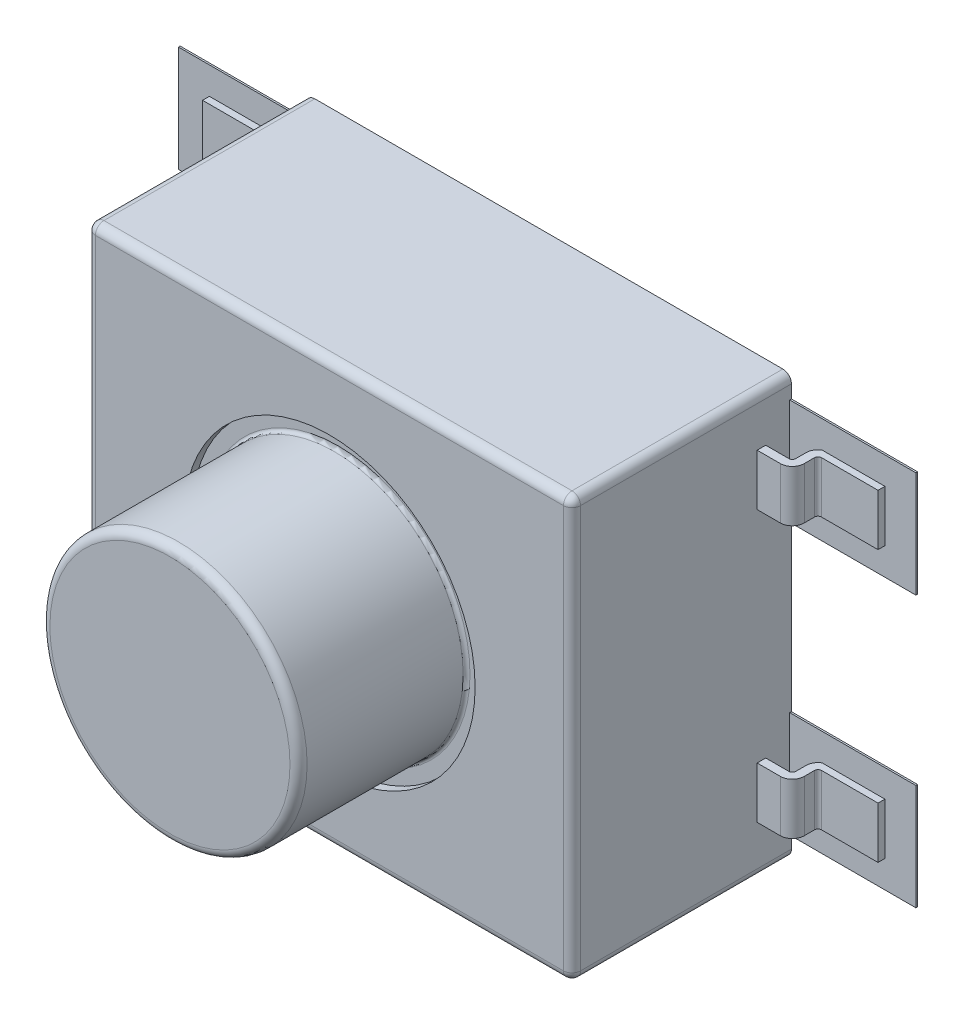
ISO-10303-21;
HEADER;
FILE_DESCRIPTION(('STEP AP214'),'2;1');
FILE_NAME('part.step','',(''),(''),'','','');
FILE_SCHEMA(('AUTOMOTIVE_DESIGN { 1 0 10303 214 1 1 1 1 }'));
ENDSEC;
DATA;
#1=APPLICATION_CONTEXT('core data for automotive mechanical design processes');
#2=APPLICATION_PROTOCOL_DEFINITION('international standard','automotive_design',2000,#1);
#3=PRODUCT_CONTEXT('',#1,'mechanical');
#4=PRODUCT('Part','Part','',(#3));
#5=PRODUCT_RELATED_PRODUCT_CATEGORY('part','',(#4));
#6=PRODUCT_DEFINITION_FORMATION('','',#4);
#7=PRODUCT_DEFINITION_CONTEXT('part definition',#1,'design');
#8=PRODUCT_DEFINITION('design','',#6,#7);
#9=PRODUCT_DEFINITION_SHAPE('','',#8);
#10=(LENGTH_UNIT() NAMED_UNIT(*) SI_UNIT(.MILLI.,.METRE.));
#11=(NAMED_UNIT(*) PLANE_ANGLE_UNIT() SI_UNIT($,.RADIAN.));
#12=(NAMED_UNIT(*) SI_UNIT($,.STERADIAN.) SOLID_ANGLE_UNIT());
#13=UNCERTAINTY_MEASURE_WITH_UNIT(LENGTH_MEASURE(1.E-05),#10,'distance_accuracy_value','');
#14=(GEOMETRIC_REPRESENTATION_CONTEXT(3) GLOBAL_UNCERTAINTY_ASSIGNED_CONTEXT((#13)) GLOBAL_UNIT_ASSIGNED_CONTEXT((#10,
#11,#12)) REPRESENTATION_CONTEXT('',''));
#15=CARTESIAN_POINT('',(0.,0.,0.));
#16=DIRECTION('',(0.,0.,1.));
#17=DIRECTION('',(1.,0.,0.));
#18=AXIS2_PLACEMENT_3D('',#15,#16,#17);
#19=CARTESIAN_POINT('',(0.,0.,5.6896));
#20=DIRECTION('',(0.,0.,1.));
#21=DIRECTION('',(1.,0.,0.));
#22=AXIS2_PLACEMENT_3D('',#19,#20,#21);
#23=PLANE('',#22);
#24=CARTESIAN_POINT('',(0.,0.,5.6896));
#25=DIRECTION('',(0.,0.,-1.));
#26=DIRECTION('',(-1.,0.,0.));
#27=AXIS2_PLACEMENT_3D('',#24,#25,#26);
#28=CIRCLE('',#27,1.778);
#29=CARTESIAN_POINT('',(-1.778,0.,5.6896));
#30=VERTEX_POINT('',#29);
#31=CARTESIAN_POINT('',(1.778,0.,5.6896));
#32=VERTEX_POINT('',#31);
#33=EDGE_CURVE('E1393',#30,#32,#28,.T.);
#34=ORIENTED_EDGE('',*,*,#33,.F.);
#35=CARTESIAN_POINT('',(1.778,0.,5.6896));
#36=CARTESIAN_POINT('',(1.77800061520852,-0.00714900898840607,5.68960000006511));
#37=CARTESIAN_POINT('',(1.77795916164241,-0.01429805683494,5.68960000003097));
#38=CARTESIAN_POINT('',(1.77774590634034,-0.0324339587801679,5.68959999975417));
#39=CARTESIAN_POINT('',(1.7775160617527,-0.0434201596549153,5.68959999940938));
#40=CARTESIAN_POINT('',(1.77670518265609,-0.0702102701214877,5.6895999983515));
#41=CARTESIAN_POINT('',(1.77601424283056,-0.086010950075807,5.68959999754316));
#42=CARTESIAN_POINT('',(1.77405358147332,-0.120336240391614,5.68959999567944));
#43=CARTESIAN_POINT('',(1.77270405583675,-0.138856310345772,5.68959999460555));
#44=CARTESIAN_POINT('',(1.76918152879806,-0.178586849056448,5.68959999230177));
#45=CARTESIAN_POINT('',(1.76691611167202,-0.199789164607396,5.68959999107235));
#46=CARTESIAN_POINT('',(1.76128188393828,-0.244829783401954,5.6895999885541));
#47=CARTESIAN_POINT('',(1.75780838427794,-0.268655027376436,5.6895999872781));
#48=CARTESIAN_POINT('',(1.74944374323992,-0.318859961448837,5.68959998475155));
#49=CARTESIAN_POINT('',(1.74443592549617,-0.345220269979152,5.68959998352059));
#50=CARTESIAN_POINT('',(1.73265746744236,-0.400378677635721,5.68959998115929));
#51=CARTESIAN_POINT('',(1.72575868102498,-0.429149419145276,5.68959998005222));
#52=CARTESIAN_POINT('',(1.70982484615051,-0.488972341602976,5.68959997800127));
#53=CARTESIAN_POINT('',(1.70065075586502,-0.519987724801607,5.68959997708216));
#54=CARTESIAN_POINT('',(1.68531291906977,-0.567078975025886,5.68959997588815));
#55=CARTESIAN_POINT('',(1.67974981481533,-0.583353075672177,5.68959997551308));
#56=CARTESIAN_POINT('',(1.6679215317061,-0.616381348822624,5.689599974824));
#57=CARTESIAN_POINT('',(1.66163716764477,-0.633128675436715,5.68959997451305));
#58=CARTESIAN_POINT('',(1.64831446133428,-0.667066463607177,5.68959997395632));
#59=CARTESIAN_POINT('',(1.64125641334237,-0.684249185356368,5.68959997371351));
#60=CARTESIAN_POINT('',(1.62633386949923,-0.719017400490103,5.68959997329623));
#61=CARTESIAN_POINT('',(1.61844918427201,-0.736594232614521,5.68959997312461));
#62=CARTESIAN_POINT('',(1.60182093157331,-0.77210556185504,5.68959997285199));
#63=CARTESIAN_POINT('',(1.59305674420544,-0.790030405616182,5.68959997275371));
#64=CARTESIAN_POINT('',(1.57461737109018,-0.826187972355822,5.68959997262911));
#65=CARTESIAN_POINT('',(1.56492119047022,-0.84440999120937,5.68959997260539));
#66=CARTESIAN_POINT('',(1.54456645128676,-0.88110713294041,5.68959997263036));
#67=CARTESIAN_POINT('',(1.53388658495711,-0.899570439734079,5.6895999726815));
#68=CARTESIAN_POINT('',(1.51151425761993,-0.936690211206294,5.68959997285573));
#69=CARTESIAN_POINT('',(1.49980024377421,-0.955333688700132,5.6895999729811));
#70=CARTESIAN_POINT('',(1.47531103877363,-0.992748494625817,5.68959997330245));
#71=CARTESIAN_POINT('',(1.4625141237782,-1.01150560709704,5.68959997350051));
#72=CARTESIAN_POINT('',(1.43581267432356,-1.04907686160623,5.68959997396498));
#73=CARTESIAN_POINT('',(1.42188632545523,-1.06787550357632,5.68959997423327));
#74=CARTESIAN_POINT('',(1.39288225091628,-1.10545335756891,5.68959997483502));
#75=CARTESIAN_POINT('',(1.37778270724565,-1.12421573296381,5.68959997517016));
#76=CARTESIAN_POINT('',(1.34639175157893,-1.16163887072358,5.68959997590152));
#77=CARTESIAN_POINT('',(1.33007861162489,-1.18028141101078,5.68959997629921));
#78=CARTESIAN_POINT('',(1.29622385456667,-1.21737692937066,5.68959997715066));
#79=CARTESIAN_POINT('',(1.27866069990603,-1.23581025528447,5.68959997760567));
#80=CARTESIAN_POINT('',(1.24227383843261,-1.27239363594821,5.68959997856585));
#81=CARTESIAN_POINT('',(1.22342889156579,-1.29052256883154,5.68959997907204));
#82=CARTESIAN_POINT('',(1.18445158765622,-1.32639775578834,5.68959998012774));
#83=CARTESIAN_POINT('',(1.16429840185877,-1.3441213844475,5.68959998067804));
#84=CARTESIAN_POINT('',(1.12268369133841,-1.3790809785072,5.68959998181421));
#85=CARTESIAN_POINT('',(1.10120186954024,-1.39629278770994,5.68959998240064));
#86=CARTESIAN_POINT('',(1.0569156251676,-1.43011837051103,5.6895999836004));
#87=CARTESIAN_POINT('',(1.03409156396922,-1.44670643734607,5.68959998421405));
#88=CARTESIAN_POINT('',(0.987114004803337,-1.47916903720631,5.68959998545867));
#89=CARTESIAN_POINT('',(0.962941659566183,-1.49501630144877,5.6895999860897));
#90=CARTESIAN_POINT('',(0.913268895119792,-1.52587701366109,5.68959998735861));
#91=CARTESIAN_POINT('',(0.887750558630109,-1.54086162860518,5.68959998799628));
#92=CARTESIAN_POINT('',(0.83539616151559,-1.56987240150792,5.68959998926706));
#93=CARTESIAN_POINT('',(0.808543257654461,-1.58386817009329,5.6895999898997));
#94=CARTESIAN_POINT('',(0.753539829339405,-1.61077277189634,5.68959999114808));
#95=CARTESIAN_POINT('',(0.725373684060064,-1.62364967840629,5.68959999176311));
#96=CARTESIAN_POINT('',(0.667774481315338,-1.64818484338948,5.68959999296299));
#97=CARTESIAN_POINT('',(0.638327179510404,-1.65980966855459,5.68959999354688));
#98=CARTESIAN_POINT('',(0.578207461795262,-1.68170648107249,5.68959999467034));
#99=CARTESIAN_POINT('',(0.547522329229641,-1.69194357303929,5.68959999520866));
#100=CARTESIAN_POINT('',(0.48498164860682,-1.71092891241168,5.68959999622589));
#101=CARTESIAN_POINT('',(0.453115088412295,-1.71964085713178,5.68959999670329));
#102=CARTESIAN_POINT('',(0.388275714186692,-1.7354396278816,5.68959999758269));
#103=CARTESIAN_POINT('',(0.355293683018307,-1.74248882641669,5.6895999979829));
#104=CARTESIAN_POINT('',(0.305310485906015,-1.75169398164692,5.68959999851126));
#105=CARTESIAN_POINT('',(0.288435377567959,-1.754550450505,5.68959999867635));
#106=CARTESIAN_POINT('',(0.25443926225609,-1.75980133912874,5.68959999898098));
#107=CARTESIAN_POINT('',(0.237317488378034,-1.762190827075,5.68959999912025));
#108=CARTESIAN_POINT('',(0.201326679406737,-1.76667958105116,5.68959999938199));
#109=CARTESIAN_POINT('',(0.182451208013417,-1.76872728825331,5.68959999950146));
#110=CARTESIAN_POINT('',(0.144442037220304,-1.7722358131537,5.68959999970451));
#111=CARTESIAN_POINT('',(0.125307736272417,-1.77369011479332,5.6895999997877));
#112=CARTESIAN_POINT('',(0.0867992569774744,-1.77599071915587,5.6895999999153));
#113=CARTESIAN_POINT('',(0.0674246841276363,-1.77683042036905,5.6895999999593));
#114=CARTESIAN_POINT('',(0.0284552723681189,-1.77788103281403,5.68960000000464));
#115=CARTESIAN_POINT('',(0.00886025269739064,-1.77808526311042,5.68960000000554));
#116=CARTESIAN_POINT('',(-0.0292948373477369,-1.77785233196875,5.68959999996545));
#117=CARTESIAN_POINT('',(-0.0478551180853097,-1.77744835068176,5.68959999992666));
#118=CARTESIAN_POINT('',(-0.0849538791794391,-1.77605962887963,5.68959999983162));
#119=CARTESIAN_POINT('',(-0.103492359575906,-1.77507488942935,5.68959999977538));
#120=CARTESIAN_POINT('',(-0.14229286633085,-1.77240417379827,5.68959999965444));
#121=CARTESIAN_POINT('',(-0.162550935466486,-1.77066035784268,5.68959999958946));
#122=CARTESIAN_POINT('',(-0.202995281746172,-1.76647925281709,5.68959999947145));
#123=CARTESIAN_POINT('',(-0.223181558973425,-1.76404196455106,5.68959999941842));
#124=CARTESIAN_POINT('',(-0.263458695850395,-1.75847677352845,5.68959999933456));
#125=CARTESIAN_POINT('',(-0.283549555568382,-1.75534887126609,5.68959999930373));
#126=CARTESIAN_POINT('',(-0.323612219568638,-1.74840613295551,5.6895999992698));
#127=CARTESIAN_POINT('',(-0.343584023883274,-1.74459129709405,5.68959999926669));
#128=CARTESIAN_POINT('',(-0.383385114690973,-1.73627916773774,5.68959999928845));
#129=CARTESIAN_POINT('',(-0.403214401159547,-1.73178187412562,5.68959999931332));
#130=CARTESIAN_POINT('',(-0.442707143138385,-1.72211014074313,5.68959999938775));
#131=CARTESIAN_POINT('',(-0.462370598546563,-1.71693570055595,5.68959999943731));
#132=CARTESIAN_POINT('',(-0.501508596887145,-1.70591565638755,5.6895999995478));
#133=CARTESIAN_POINT('',(-0.520983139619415,-1.70007005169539,5.68959999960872));
#134=CARTESIAN_POINT('',(-0.559720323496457,-1.6877149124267,5.68959999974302));
#135=CARTESIAN_POINT('',(-0.578982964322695,-1.68120537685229,5.68959999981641));
#136=CARTESIAN_POINT('',(-0.619770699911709,-1.66663692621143,5.68959999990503));
#137=CARTESIAN_POINT('',(-0.6412632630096,-1.65848666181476,5.68959999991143));
#138=CARTESIAN_POINT('',(-0.680356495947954,-1.64279279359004,5.68960000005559));
#139=CARTESIAN_POINT('',(-0.698007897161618,-1.63537505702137,5.68960000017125));
#140=CARTESIAN_POINT('',(-0.735692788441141,-1.61882570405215,5.68959999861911));
#141=CARTESIAN_POINT('',(-0.755686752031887,-1.60960384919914,5.68959999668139));
#142=CARTESIAN_POINT('',(-0.795320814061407,-1.59043158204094,5.68959998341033));
#143=CARTESIAN_POINT('',(-0.814960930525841,-1.58048120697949,5.68959997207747));
#144=CARTESIAN_POINT('',(-0.853861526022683,-1.55986595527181,5.68959992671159));
#145=CARTESIAN_POINT('',(-0.873122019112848,-1.54920110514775,5.68959989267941));
#146=CARTESIAN_POINT('',(-0.911237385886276,-1.52716983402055,5.68959978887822));
#147=CARTESIAN_POINT('',(-0.930092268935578,-1.51580342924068,5.68959971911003));
#148=CARTESIAN_POINT('',(-0.960078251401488,-1.4969703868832,5.68959954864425));
#149=CARTESIAN_POINT('',(-0.971344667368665,-1.48971816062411,5.6895994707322));
#150=CARTESIAN_POINT('',(-0.995309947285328,-1.47390123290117,5.68959929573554));
#151=CARTESIAN_POINT('',(-1.00798297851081,-1.46529726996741,5.68959919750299));
#152=CARTESIAN_POINT('',(-1.03309194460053,-1.44775430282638,5.68959904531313));
#153=CARTESIAN_POINT('',(-1.04552791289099,-1.43881534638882,5.68959899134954));
#154=CARTESIAN_POINT('',(-1.07554216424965,-1.41663032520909,5.68959892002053));
#155=CARTESIAN_POINT('',(-1.09299189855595,-1.40320964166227,5.68959892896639));
#156=CARTESIAN_POINT('',(-1.12735655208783,-1.37571094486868,5.68959904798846));
#157=CARTESIAN_POINT('',(-1.14427161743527,-1.36163311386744,5.68959915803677));
#158=CARTESIAN_POINT('',(-1.17827935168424,-1.33223019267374,5.68959943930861));
#159=CARTESIAN_POINT('',(-1.19534821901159,-1.31687749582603,5.68959961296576));
#160=CARTESIAN_POINT('',(-1.22880987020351,-1.28546597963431,5.68959988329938));
#161=CARTESIAN_POINT('',(-1.24520290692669,-1.26940742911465,5.68959998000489));
#162=CARTESIAN_POINT('',(-1.2681771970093,-1.24621397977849,5.68960000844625));
#163=CARTESIAN_POINT('',(-1.27496138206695,-1.23927728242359,5.68960000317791));
#164=CARTESIAN_POINT('',(-1.29695888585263,-1.21642858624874,5.68959999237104));
#165=CARTESIAN_POINT('',(-1.31194510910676,-1.2002962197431,5.68959999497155));
#166=CARTESIAN_POINT('',(-1.34591745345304,-1.16234208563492,5.68959995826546));
#167=CARTESIAN_POINT('',(-1.36468359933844,-1.1403230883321,5.6895999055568));
#168=CARTESIAN_POINT('',(-1.40087594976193,-1.09569182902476,5.68959975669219));
#169=CARTESIAN_POINT('',(-1.41831663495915,-1.07309132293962,5.68959966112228));
#170=CARTESIAN_POINT('',(-1.44505015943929,-1.03664140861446,5.68959952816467));
#171=CARTESIAN_POINT('',(-1.45471418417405,-1.02306285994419,5.68959948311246));
#172=CARTESIAN_POINT('',(-1.47257572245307,-0.997188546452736,5.68959942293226));
#173=CARTESIAN_POINT('',(-1.48081531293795,-0.984921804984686,5.68959940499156));
#174=CARTESIAN_POINT('',(-1.50354127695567,-0.950143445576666,5.6895993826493));
#175=CARTESIAN_POINT('',(-1.51767029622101,-0.927396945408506,5.68959940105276));
#176=CARTESIAN_POINT('',(-1.54487435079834,-0.881286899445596,5.68959947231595));
#177=CARTESIAN_POINT('',(-1.55794952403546,-0.857923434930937,5.68959952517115));
#178=CARTESIAN_POINT('',(-1.58077857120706,-0.814849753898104,5.68959964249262));
#179=CARTESIAN_POINT('',(-1.59070846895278,-0.79523262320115,5.68959970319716));
#180=CARTESIAN_POINT('',(-1.6098253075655,-0.755642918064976,5.68959982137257));
#181=CARTESIAN_POINT('',(-1.61901235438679,-0.735670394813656,5.6895998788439));
#182=CARTESIAN_POINT('',(-1.63700806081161,-0.694520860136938,5.68959996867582));
#183=CARTESIAN_POINT('',(-1.64578311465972,-0.673329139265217,5.68959999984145));
#184=CARTESIAN_POINT('',(-1.66123964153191,-0.633877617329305,5.68960000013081));
#185=CARTESIAN_POINT('',(-1.66803643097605,-0.615662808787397,5.68959997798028));
#186=CARTESIAN_POINT('',(-1.68134696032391,-0.578199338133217,5.68959993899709));
#187=CARTESIAN_POINT('',(-1.68783399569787,-0.558941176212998,5.68959992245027));
#188=CARTESIAN_POINT('',(-1.70016293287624,-0.520223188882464,5.68959991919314));
#189=CARTESIAN_POINT('',(-1.70600494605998,-0.500763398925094,5.68959993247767));
#190=CARTESIAN_POINT('',(-1.71704244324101,-0.461664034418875,5.68959996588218));
#191=CARTESIAN_POINT('',(-1.72223801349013,-0.442024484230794,5.68959998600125));
#192=CARTESIAN_POINT('',(-1.73196570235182,-0.402583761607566,5.68960001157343));
#193=CARTESIAN_POINT('',(-1.73649788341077,-0.382782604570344,5.68960001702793));
#194=CARTESIAN_POINT('',(-1.74291877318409,-0.352550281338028,5.6895998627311));
#195=CARTESIAN_POINT('',(-1.74503507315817,-0.342167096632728,5.68959978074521));
#196=CARTESIAN_POINT('',(-1.75062563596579,-0.313111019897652,5.68959965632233));
#197=CARTESIAN_POINT('',(-1.75384699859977,-0.294389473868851,5.68959969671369));
#198=CARTESIAN_POINT('',(-1.76236916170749,-0.239671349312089,5.68959980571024));
#199=CARTESIAN_POINT('',(-1.76687444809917,-0.203547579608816,5.68959986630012));
#200=CARTESIAN_POINT('',(-1.77218449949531,-0.146721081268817,5.68959993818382));
#201=CARTESIAN_POINT('',(-1.77374724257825,-0.1260857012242,5.68959995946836));
#202=CARTESIAN_POINT('',(-1.77699709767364,-0.0703295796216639,5.68960000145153));
#203=CARTESIAN_POINT('',(-1.77800720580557,-0.0351686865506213,5.68960001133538));
#204=CARTESIAN_POINT('',(-1.778,0.,5.6896));
#205=B_SPLINE_CURVE_WITH_KNOTS('',3,(#35,#36,#37,#38,#39,#40,#41,#42,#43,#44,#45,#46,#47,#48,
#49,#50,#51,#52,#53,#54,#55,#56,#57,#58,#59,#60,#61,#62,#63,#64,#65,#66,#67,#68,#69,#70,#71,#72,
#73,#74,#75,#76,#77,#78,#79,#80,#81,#82,#83,#84,#85,#86,#87,#88,#89,#90,#91,#92,#93,#94,#95,#96,
#97,#98,#99,#100,#101,#102,#103,#104,#105,#106,#107,#108,#109,#110,#111,#112,#113,#114,#115,
#116,#117,#118,#119,#120,#121,#122,#123,#124,#125,#126,#127,#128,#129,#130,#131,#132,#133,#134,
#135,#136,#137,#138,#139,#140,#141,#142,#143,#144,#145,#146,#147,#148,#149,#150,#151,#152,#153,
#154,#155,#156,#157,#158,#159,#160,#161,#162,#163,#164,#165,#166,#167,#168,#169,#170,#171,#172,
#173,#174,#175,#176,#177,#178,#179,#180,#181,#182,#183,#184,#185,#186,#187,#188,#189,#190,#191,
#192,#193,#194,#195,#196,#197,#198,#199,#200,#201,#202,#203,#204),.UNSPECIFIED.,.F.,.F.,(4,2,2,
2,2,2,2,2,2,2,2,2,2,2,2,2,2,2,2,2,2,2,2,2,2,2,2,2,2,2,2,2,2,2,2,2,2,2,2,2,2,2,2,2,2,2,2,2,2,2,2,
2,2,2,2,2,2,2,2,2,2,2,2,2,2,2,2,2,2,2,2,2,2,2,2,2,2,2,2,2,2,2,2,2,4),(0.,0.0214469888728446,
0.0544109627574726,0.101852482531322,0.157550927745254,0.221506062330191,0.293717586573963,
0.374185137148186,0.462908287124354,0.55988654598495,0.611476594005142,0.665130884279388,
0.720849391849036,0.778632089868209,0.838478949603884,0.90038994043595,0.964365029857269,
1.03040418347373,1.09850736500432,1.16867453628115,1.24090565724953,1.315200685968,
1.39155957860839,1.4699822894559,1.55046877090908,1.63301897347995,1.71763284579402,
1.80431033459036,1.89305138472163,1.98385593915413,2.07672393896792,2.17165532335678,
2.26865002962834,2.36770799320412,2.46882914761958,2.52016875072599,2.57202428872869,
2.62897317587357,2.68653158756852,2.74469951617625,2.80347695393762,2.85916193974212,
2.91484682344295,2.97583364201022,3.03682038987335,3.09780709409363,3.15879378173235,
3.21978047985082,3.28076721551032,3.34175401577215,3.40274090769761,3.47168072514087,
3.52911160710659,3.59515087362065,3.66118676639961,3.72722020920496,3.7932521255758,
3.83344555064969,3.87939304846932,3.92533401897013,3.9913580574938,4.05736389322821,
4.12621636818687,4.19504284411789,4.22415077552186,4.29019229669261,4.37695084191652,
4.46255766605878,4.5125506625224,4.55687788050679,4.63718025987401,4.71747211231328,
4.78341855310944,4.84935557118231,4.91814748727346,4.97646286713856,5.03741569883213,
5.09835798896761,5.15929213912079,5.22022054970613,5.25200868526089,5.30898780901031,
5.41812066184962,5.48019345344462,5.58566657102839),.UNSPECIFIED.);
#206=EDGE_CURVE('E1391',#32,#30,#205,.T.);
#207=ORIENTED_EDGE('',*,*,#206,.F.);
#208=EDGE_LOOP('',(#34,#207));
#209=FACE_BOUND('',#208,.T.);
#210=ADVANCED_FACE('F16',(#209),#23,.T.);
#211=CARTESIAN_POINT('',(0.,0.,5.5626));
#212=DIRECTION('',(0.,0.,1.));
#213=DIRECTION('',(0.999927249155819,-0.0120621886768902,0.));
#214=AXIS2_PLACEMENT_3D('',#211,#212,#213);
#215=TOROIDAL_SURFACE('',#214,1.778,0.127);
#216=CARTESIAN_POINT('',(0.,0.,5.5626));
#217=DIRECTION('',(0.,0.,1.));
#218=DIRECTION('',(1.,0.,0.));
#219=AXIS2_PLACEMENT_3D('',#216,#217,#218);
#220=CIRCLE('',#219,1.905);
#221=CARTESIAN_POINT('',(1.905,0.,5.5626));
#222=VERTEX_POINT('',#221);
#223=EDGE_CURVE('E1283',#222,#222,#220,.F.);
#224=ORIENTED_EDGE('',*,*,#223,.F.);
#225=EDGE_LOOP('',(#224));
#226=FACE_BOUND('',#225,.T.);
#227=ORIENTED_EDGE('',*,*,#33,.T.);
#228=ORIENTED_EDGE('',*,*,#206,.T.);
#229=EDGE_LOOP('',(#227,#228));
#230=FACE_BOUND('',#229,.T.);
#231=ADVANCED_FACE('F1287',(#226,#230),#215,.T.);
#232=CARTESIAN_POINT('',(0.,0.,5.6896));
#233=DIRECTION('',(0.,0.,1.));
#234=DIRECTION('',(1.,0.,0.));
#235=AXIS2_PLACEMENT_3D('',#232,#233,#234);
#236=CYLINDRICAL_SURFACE('',#235,1.905);
#237=CARTESIAN_POINT('',(0.,0.,3.2512));
#238=DIRECTION('',(0.,0.,1.));
#239=DIRECTION('',(0.999927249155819,-0.0120621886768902,0.));
#240=AXIS2_PLACEMENT_3D('',#237,#238,#239);
#241=CIRCLE('',#240,1.905);
#242=CARTESIAN_POINT('',(1.90486140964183,-0.0229784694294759,3.2512));
#243=VERTEX_POINT('',#242);
#244=EDGE_CURVE('E1275',#243,#243,#241,.T.);
#245=ORIENTED_EDGE('',*,*,#244,.T.);
#246=EDGE_LOOP('',(#245));
#247=FACE_BOUND('',#246,.T.);
#248=ORIENTED_EDGE('',*,*,#223,.T.);
#249=EDGE_LOOP('',(#248));
#250=FACE_BOUND('',#249,.T.);
#251=ADVANCED_FACE('F1290',(#247,#250),#236,.T.);
#252=CARTESIAN_POINT('',(0.,0.,3.2512));
#253=DIRECTION('',(0.,0.,1.));
#254=DIRECTION('',(0.999927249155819,-0.0120621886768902,0.));
#255=AXIS2_PLACEMENT_3D('',#252,#253,#254);
#256=TOROIDAL_SURFACE('',#255,1.9558,0.0508);
#257=ORIENTED_EDGE('',*,*,#244,.F.);
#258=EDGE_LOOP('',(#257));
#259=FACE_BOUND('',#258,.T.);
#260=CARTESIAN_POINT('',(-1.9558,0.,3.2004));
#261=CARTESIAN_POINT('',(-1.95580042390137,-0.0284459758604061,3.2004));
#262=CARTESIAN_POINT('',(-1.95517942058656,-0.0568919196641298,3.2004));
#263=CARTESIAN_POINT('',(-1.95269760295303,-0.113729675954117,3.2004));
#264=CARTESIAN_POINT('',(-1.95083678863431,-0.142121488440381,3.2004));
#265=CARTESIAN_POINT('',(-1.94587839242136,-0.198796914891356,3.2004));
#266=CARTESIAN_POINT('',(-1.94278081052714,-0.227080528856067,3.2004));
#267=CARTESIAN_POINT('',(-1.93535490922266,-0.283485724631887,3.2004));
#268=CARTESIAN_POINT('',(-1.93102658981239,-0.311607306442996,3.2004));
#269=CARTESIAN_POINT('',(-1.92114741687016,-0.36763490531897,3.2004));
#270=CARTESIAN_POINT('',(-1.91559656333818,-0.395540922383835,3.2004));
#271=CARTESIAN_POINT('',(-1.90328289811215,-0.451084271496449,3.2004));
#272=CARTESIAN_POINT('',(-1.89652008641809,-0.478721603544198,3.2004));
#273=CARTESIAN_POINT('',(-1.88179537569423,-0.533674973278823,3.2004));
#274=CARTESIAN_POINT('',(-1.87383347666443,-0.560991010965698,3.2004));
#275=CARTESIAN_POINT('',(-1.85672574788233,-0.615249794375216,3.2004));
#276=CARTESIAN_POINT('',(-1.84757991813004,-0.642192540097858,3.2004));
#277=CARTESIAN_POINT('',(-1.82812173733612,-0.695653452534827,3.2004));
#278=CARTESIAN_POINT('',(-1.8178093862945,-0.722171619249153,3.2004));
#279=CARTESIAN_POINT('',(-1.79603779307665,-0.774732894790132,3.2004));
#280=CARTESIAN_POINT('',(-1.78457855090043,-0.800776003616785,3.20040000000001));
#281=CARTESIAN_POINT('',(-1.76053498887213,-0.852337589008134,3.20039999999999));
#282=CARTESIAN_POINT('',(-1.74795066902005,-0.877856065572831,3.20039999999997));
#283=CARTESIAN_POINT('',(-1.72168090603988,-0.928319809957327,3.20040000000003));
#284=CARTESIAN_POINT('',(-1.70799546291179,-0.953265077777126,3.20040000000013));
#285=CARTESIAN_POINT('',(-1.67954950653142,-1.00253492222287,3.20039999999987));
#286=CARTESIAN_POINT('',(-1.66478899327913,-1.02685949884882,3.20039999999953));
#287=CARTESIAN_POINT('',(-1.63422098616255,-1.07484164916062,3.20040000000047));
#288=CARTESIAN_POINT('',(-1.61841349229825,-1.09849922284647,3.20040000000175));
#289=CARTESIAN_POINT('',(-1.58578164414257,-1.14510236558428,3.20039999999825));
#290=CARTESIAN_POINT('',(-1.5689572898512,-1.16804793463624,3.20039999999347));
#291=CARTESIAN_POINT('',(-1.534323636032,-1.21318327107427,3.20040000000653));
#292=CARTESIAN_POINT('',(-1.51651433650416,-1.23537303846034,3.20040000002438));
#293=CARTESIAN_POINT('',(-1.47994510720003,-1.27895497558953,3.20039999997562));
#294=CARTESIAN_POINT('',(-1.46118517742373,-1.30034714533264,3.20039999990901));
#295=CARTESIAN_POINT('',(-1.42274885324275,-1.34229151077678,3.20040000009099));
#296=CARTESIAN_POINT('',(-1.40307245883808,-1.3628437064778,3.20040000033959));
#297=CARTESIAN_POINT('',(-1.36199825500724,-1.40392346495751,3.20039999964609));
#298=CARTESIAN_POINT('',(-1.34056284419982,-1.42441344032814,3.20039999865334));
#299=CARTESIAN_POINT('',(-1.29680946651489,-1.46439496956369,3.20040001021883));
#300=CARTESIAN_POINT('',(-1.27449216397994,-1.48388725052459,3.20040002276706));
#301=CARTESIAN_POINT('',(-1.22902048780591,-1.52183526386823,3.2004001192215));
#302=CARTESIAN_POINT('',(-1.20586672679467,-1.54029173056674,3.20040020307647));
#303=CARTESIAN_POINT('',(-1.15876854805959,-1.57613326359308,3.20040051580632));
#304=CARTESIAN_POINT('',(-1.13482469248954,-1.59351906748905,3.20040074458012));
#305=CARTESIAN_POINT('',(-1.09835200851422,-1.61877668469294,3.200401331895));
#306=CARTESIAN_POINT('',(-1.08610442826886,-1.62705728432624,3.20040156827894));
#307=CARTESIAN_POINT('',(-1.0613631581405,-1.64337500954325,3.20040207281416));
#308=CARTESIAN_POINT('',(-1.04886856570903,-1.65141076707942,3.20040234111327));
#309=CARTESIAN_POINT('',(-1.0111485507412,-1.67504666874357,3.20040300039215));
#310=CARTESIAN_POINT('',(-0.985644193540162,-1.69020508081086,3.2004032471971));
#311=CARTESIAN_POINT('',(-0.934011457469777,-1.71927072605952,3.20040324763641));
#312=CARTESIAN_POINT('',(-0.907884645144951,-1.73318075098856,3.20040300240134));
#313=CARTESIAN_POINT('',(-0.85507847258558,-1.75975063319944,3.20040213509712));
#314=CARTESIAN_POINT('',(-0.828400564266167,-1.77241336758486,3.20040151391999));
#315=CARTESIAN_POINT('',(-0.77451874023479,-1.79637681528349,3.20040049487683));
#316=CARTESIAN_POINT('',(-0.747316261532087,-1.80768076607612,3.2004000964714));
#317=CARTESIAN_POINT('',(-0.706264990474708,-1.82386234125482,3.20039995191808));
#318=CARTESIAN_POINT('',(-0.692562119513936,-1.82911933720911,3.20039997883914));
#319=CARTESIAN_POINT('',(-0.634640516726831,-1.85060607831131,3.20040006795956));
#320=CARTESIAN_POINT('',(-0.589879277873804,-1.86542159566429,3.20040007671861));
#321=CARTESIAN_POINT('',(-0.522279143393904,-1.88511329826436,3.20040032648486));
#322=CARTESIAN_POINT('',(-0.499790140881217,-1.89122934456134,3.20040044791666));
#323=CARTESIAN_POINT('',(-0.451456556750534,-1.90344149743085,3.20040069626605));
#324=CARTESIAN_POINT('',(-0.425580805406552,-1.90941622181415,3.20040082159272));
#325=CARTESIAN_POINT('',(-0.388498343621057,-1.91717315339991,3.20040092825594));
#326=CARTESIAN_POINT('',(-0.377381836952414,-1.91939603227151,3.20040095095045));
#327=CARTESIAN_POINT('',(-0.352828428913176,-1.92408047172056,3.20040097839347));
#328=CARTESIAN_POINT('',(-0.339383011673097,-1.92649754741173,3.20040097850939));
#329=CARTESIAN_POINT('',(-0.298986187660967,-1.93331957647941,3.20040095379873));
#330=CARTESIAN_POINT('',(-0.271961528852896,-1.93729802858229,3.2004009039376));
#331=CARTESIAN_POINT('',(-0.217784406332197,-1.94410510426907,3.20040074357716));
#332=CARTESIAN_POINT('',(-0.190632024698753,-1.94693438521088,3.2004006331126));
#333=CARTESIAN_POINT('',(-0.136247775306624,-1.95144263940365,3.20040039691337));
#334=CARTESIAN_POINT('',(-0.109015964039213,-1.95312229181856,3.20040027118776));
#335=CARTESIAN_POINT('',(-0.0545223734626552,-1.95532243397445,3.20040007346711));
#336=CARTESIAN_POINT('',(-0.0272606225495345,-1.95584362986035,3.20040000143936));
#337=CARTESIAN_POINT('',(0.0273962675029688,-1.95575615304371,3.20039999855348));
#338=CARTESIAN_POINT('',(0.0547913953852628,-1.95514184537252,3.20040006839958));
#339=CARTESIAN_POINT('',(0.109492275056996,-1.95280223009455,3.20040013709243));
#340=CARTESIAN_POINT('',(0.136798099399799,-1.9510786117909,3.20040013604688));
#341=CARTESIAN_POINT('',(0.191277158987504,-1.94652525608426,3.20040008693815));
#342=CARTESIAN_POINT('',(0.218450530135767,-1.9436971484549,3.2004000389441));
#343=CARTESIAN_POINT('',(0.272619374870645,-1.93692979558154,3.20039996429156));
#344=CARTESIAN_POINT('',(0.299615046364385,-1.93299213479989,3.20039993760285));
#345=CARTESIAN_POINT('',(0.339963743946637,-1.92630438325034,3.20040050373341));
#346=CARTESIAN_POINT('',(0.353382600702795,-1.92394627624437,3.2004007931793));
#347=CARTESIAN_POINT('',(0.372323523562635,-1.92037096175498,3.20040102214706));
#348=CARTESIAN_POINT('',(0.37787196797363,-1.9192935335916,3.20040106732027));
#349=CARTESIAN_POINT('',(0.407843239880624,-1.91332528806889,3.20040122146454));
#350=CARTESIAN_POINT('',(0.43217075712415,-1.90794790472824,3.20040102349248));
#351=CARTESIAN_POINT('',(0.486118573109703,-1.89494059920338,3.20040065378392));
#352=CARTESIAN_POINT('',(0.515681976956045,-1.88707660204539,3.20040049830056));
#353=CARTESIAN_POINT('',(0.586853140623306,-1.86633700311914,3.20040018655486));
#354=CARTESIAN_POINT('',(0.628257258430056,-1.85274968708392,3.20040005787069));
#355=CARTESIAN_POINT('',(0.686165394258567,-1.83159921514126,3.20040000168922));
#356=CARTESIAN_POINT('',(0.703087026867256,-1.8251532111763,3.20040000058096));
#357=CARTESIAN_POINT('',(0.747486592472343,-1.80755109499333,3.20039999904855));
#358=CARTESIAN_POINT('',(0.774814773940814,-1.79601272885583,3.20039999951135));
#359=CARTESIAN_POINT('',(0.828896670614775,-1.77172764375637,3.20040000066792));
#360=CARTESIAN_POINT('',(0.855650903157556,-1.75898207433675,3.20040000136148));
#361=CARTESIAN_POINT('',(0.908537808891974,-1.73231841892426,3.20040006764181));
#362=CARTESIAN_POINT('',(0.934671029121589,-1.71840141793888,3.20040013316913));
#363=CARTESIAN_POINT('',(0.986264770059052,-1.68942161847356,3.20040042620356));
#364=CARTESIAN_POINT('',(1.01172586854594,-1.67435985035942,3.20040065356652));
#365=CARTESIAN_POINT('',(1.04938561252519,-1.65093424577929,3.20040129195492));
#366=CARTESIAN_POINT('',(1.06184661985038,-1.64298934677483,3.20040155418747));
#367=CARTESIAN_POINT('',(1.08665350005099,-1.6267703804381,3.20040212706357));
#368=CARTESIAN_POINT('',(1.09899832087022,-1.61849470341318,3.20040243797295));
#369=CARTESIAN_POINT('',(1.13568912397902,-1.59326450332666,3.20040321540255));
#370=CARTESIAN_POINT('',(1.15973956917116,-1.57587696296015,3.20040352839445));
#371=CARTESIAN_POINT('',(1.20693220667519,-1.54003232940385,3.20040359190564));
#372=CARTESIAN_POINT('',(1.23007652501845,-1.52157802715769,3.2004033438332));
#373=CARTESIAN_POINT('',(1.27543054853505,-1.48366773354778,3.20040240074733));
#374=CARTESIAN_POINT('',(1.2976425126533,-1.46421445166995,3.20040170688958));
#375=CARTESIAN_POINT('',(1.34101484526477,-1.42428332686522,3.20040056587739));
#376=CARTESIAN_POINT('',(1.36217785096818,-1.40380834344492,3.20040011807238));
#377=CARTESIAN_POINT('',(1.39434976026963,-1.37153223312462,3.20039993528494));
#378=CARTESIAN_POINT('',(1.40562549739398,-1.35999269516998,3.20039996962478));
#379=CARTESIAN_POINT('',(1.45185460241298,-1.31151496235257,3.20040009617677));
#380=CARTESIAN_POINT('',(1.48555239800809,-1.2733505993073,3.20040015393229));
#381=CARTESIAN_POINT('',(1.53356775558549,-1.21448590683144,3.20040064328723));
#382=CARTESIAN_POINT('',(1.54905976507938,-1.19472612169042,3.20040087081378));
#383=CARTESIAN_POINT('',(1.58146903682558,-1.15168711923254,3.20040133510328));
#384=CARTESIAN_POINT('',(1.59826425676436,-1.12831519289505,3.20040156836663));
#385=CARTESIAN_POINT('',(1.62151364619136,-1.09437426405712,3.20040176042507));
#386=CARTESIAN_POINT('',(1.62840503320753,-1.08410178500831,3.20040179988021));
#387=CARTESIAN_POINT('',(1.64332886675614,-1.06138421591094,3.20040184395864));
#388=CARTESIAN_POINT('',(1.65131796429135,-1.04891060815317,3.2004018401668));
#389=CARTESIAN_POINT('',(1.67484218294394,-1.01123642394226,3.20040178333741));
#390=CARTESIAN_POINT('',(1.68994634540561,-0.985764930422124,3.20040168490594));
#391=CARTESIAN_POINT('',(1.71895445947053,-0.934178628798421,3.20040137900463));
#392=CARTESIAN_POINT('',(1.73285946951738,-0.908064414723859,3.20040117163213));
#393=CARTESIAN_POINT('',(1.75944656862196,-0.855250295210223,3.20040073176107));
#394=CARTESIAN_POINT('',(1.77212976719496,-0.828550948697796,3.20040049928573));
#395=CARTESIAN_POINT('',(1.79623984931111,-0.774621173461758,3.20040013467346));
#396=CARTESIAN_POINT('',(1.80766790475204,-0.747391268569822,3.20040000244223));
#397=CARTESIAN_POINT('',(1.82851388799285,-0.69442508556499,3.20039999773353));
#398=CARTESIAN_POINT('',(1.83801729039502,-0.668722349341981,3.20040010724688));
#399=CARTESIAN_POINT('',(1.85596330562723,-0.61699887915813,3.20040022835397));
#400=CARTESIAN_POINT('',(1.86440771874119,-0.590978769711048,3.20040024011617));
#401=CARTESIAN_POINT('',(1.88022421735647,-0.538661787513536,3.20040017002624));
#402=CARTESIAN_POINT('',(1.88759806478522,-0.51236544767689,3.20040008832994));
#403=CARTESIAN_POINT('',(1.90125117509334,-0.459534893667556,3.20039994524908));
#404=CARTESIAN_POINT('',(1.90753217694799,-0.433001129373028,3.2003998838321));
#405=CARTESIAN_POINT('',(1.91536430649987,-0.396837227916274,3.2004004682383));
#406=CARTESIAN_POINT('',(1.9173611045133,-0.387302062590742,3.20040068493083));
#407=CARTESIAN_POINT('',(1.92081713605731,-0.369958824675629,3.20040090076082));
#408=CARTESIAN_POINT('',(1.92230754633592,-0.362156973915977,3.20040093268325));
#409=CARTESIAN_POINT('',(1.92885926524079,-0.326623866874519,3.20040099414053));
#410=CARTESIAN_POINT('',(1.93333923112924,-0.298783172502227,3.20040081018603));
#411=CARTESIAN_POINT('',(1.94038626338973,-0.248007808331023,3.20040053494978));
#412=CARTESIAN_POINT('',(1.94315296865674,-0.225100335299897,3.20040043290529));
#413=CARTESIAN_POINT('',(1.9475175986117,-0.182644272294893,3.20040026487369));
#414=CARTESIAN_POINT('',(1.94922858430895,-0.163107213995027,3.20040019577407));
#415=CARTESIAN_POINT('',(1.95278283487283,-0.114059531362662,3.20040006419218));
#416=CARTESIAN_POINT('',(1.95425234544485,-0.0845205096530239,3.20040002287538));
#417=CARTESIAN_POINT('',(1.95534040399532,-0.0445098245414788,3.20040000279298));
#418=CARTESIAN_POINT('',(1.95554141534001,-0.0340510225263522,3.2004000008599));
#419=CARTESIAN_POINT('',(1.9557530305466,-0.015727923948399,3.20039999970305));
#420=CARTESIAN_POINT('',(1.95579851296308,-0.00786403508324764,3.20039999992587));
#421=CARTESIAN_POINT('',(1.9558,0.,3.2004));
#422=B_SPLINE_CURVE_WITH_KNOTS('',3,(#260,#261,#262,#263,#264,#265,#266,#267,#268,#269,#270,
#271,#272,#273,#274,#275,#276,#277,#278,#279,#280,#281,#282,#283,#284,#285,#286,#287,#288,#289,
#290,#291,#292,#293,#294,#295,#296,#297,#298,#299,#300,#301,#302,#303,#304,#305,#306,#307,#308,
#309,#310,#311,#312,#313,#314,#315,#316,#317,#318,#319,#320,#321,#322,#323,#324,#325,#326,#327,
#328,#329,#330,#331,#332,#333,#334,#335,#336,#337,#338,#339,#340,#341,#342,#343,#344,#345,#346,
#347,#348,#349,#350,#351,#352,#353,#354,#355,#356,#357,#358,#359,#360,#361,#362,#363,#364,#365,
#366,#367,#368,#369,#370,#371,#372,#373,#374,#375,#376,#377,#378,#379,#380,#381,#382,#383,#384,
#385,#386,#387,#388,#389,#390,#391,#392,#393,#394,#395,#396,#397,#398,#399,#400,#401,#402,#403,
#404,#405,#406,#407,#408,#409,#410,#411,#412,#413,#414,#415,#416,#417,#418,#419,#420,#421),
.UNSPECIFIED.,.F.,.F.,(4,2,2,2,2,2,2,2,2,2,2,2,2,2,2,2,2,2,2,2,2,2,2,2,2,2,2,2,2,2,2,2,2,2,2,2,
2,2,2,2,2,2,2,2,2,2,2,2,2,2,2,2,2,2,2,2,2,2,2,2,2,2,2,2,2,2,2,2,2,2,2,2,2,2,2,2,2,2,2,2,4),(0.,
0.0853311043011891,0.170662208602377,0.255993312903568,0.341324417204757,0.426655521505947,
0.511986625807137,0.597317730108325,0.682648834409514,0.767979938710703,0.853311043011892,
0.938642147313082,1.02397325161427,1.10930435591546,1.19463546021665,1.27996656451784,
1.36529766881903,1.45062877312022,1.53595987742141,1.624889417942,1.7137531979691,
1.80255316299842,1.89129125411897,1.93564049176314,1.98020378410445,2.06917459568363,
2.15794120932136,2.24649802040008,2.33483946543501,2.37886936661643,2.52016335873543,
2.59007088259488,2.66971351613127,2.7037219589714,2.74470203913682,2.82662334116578,
2.90849771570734,2.99032367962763,3.07209975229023,3.15428273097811,3.2363408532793,
3.31827834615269,3.40009941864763,3.44096971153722,3.45792577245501,3.53264749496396,
3.62439297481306,3.75500793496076,3.80932749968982,3.89828729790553,3.98716322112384,
4.07595771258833,4.16467320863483,4.20900486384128,4.25358764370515,4.34258349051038,
4.43135620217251,4.51989969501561,4.60820793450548,4.65660937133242,4.80915262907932,
4.88446652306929,4.97077385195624,5.00788194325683,5.05231656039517,5.14112186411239,
5.22984796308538,5.31849271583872,5.407053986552,5.48924164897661,5.57128764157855,
5.65319703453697,5.7349748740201,5.76419975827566,5.78802790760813,5.87259264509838,
5.94180067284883,6.00062856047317,6.08931933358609,6.12070069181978,6.14429237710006),.UNSPECIFIED.);
#423=CARTESIAN_POINT('',(1.9558,0.,3.2004));
#424=VERTEX_POINT('',#423);
#425=CARTESIAN_POINT('',(-1.9558,0.,3.2004));
#426=VERTEX_POINT('',#425);
#427=EDGE_CURVE('E1236',#424,#426,#422,.F.);
#428=ORIENTED_EDGE('',*,*,#427,.F.);
#429=CARTESIAN_POINT('',(0.,0.,3.2004));
#430=DIRECTION('',(0.,0.,1.));
#431=DIRECTION('',(1.,0.,0.));
#432=AXIS2_PLACEMENT_3D('',#429,#430,#431);
#433=CIRCLE('',#432,1.9558);
#434=EDGE_CURVE('E1271',#426,#424,#433,.F.);
#435=ORIENTED_EDGE('',*,*,#434,.F.);
#436=EDGE_LOOP('',(#428,#435));
#437=FACE_BOUND('',#436,.T.);
#438=ADVANCED_FACE('F1254',(#259,#437),#256,.F.);
#439=CARTESIAN_POINT('',(0.,0.,3.2004));
#440=DIRECTION('',(0.,0.,1.));
#441=DIRECTION('',(1.,0.,0.));
#442=AXIS2_PLACEMENT_3D('',#439,#440,#441);
#443=PLANE('',#442);
#444=ORIENTED_EDGE('',*,*,#427,.T.);
#445=ORIENTED_EDGE('',*,*,#434,.T.);
#446=EDGE_LOOP('',(#444,#445));
#447=FACE_BOUND('',#446,.T.);
#448=CARTESIAN_POINT('',(0.,0.,3.2004));
#449=DIRECTION('',(0.,0.,1.));
#450=DIRECTION('',(1.,0.,0.));
#451=AXIS2_PLACEMENT_3D('',#448,#449,#450);
#452=CIRCLE('',#451,2.159);
#453=CARTESIAN_POINT('',(2.159,0.,3.2004));
#454=VERTEX_POINT('',#453);
#455=EDGE_CURVE('E1213',#454,#454,#452,.T.);
#456=ORIENTED_EDGE('',*,*,#455,.T.);
#457=EDGE_LOOP('',(#456));
#458=FACE_BOUND('',#457,.T.);
#459=ADVANCED_FACE('F1243',(#447,#458),#443,.T.);
#460=CARTESIAN_POINT('',(0.,0.,3.3274));
#461=DIRECTION('',(0.,0.,1.));
#462=DIRECTION('',(1.,0.,0.));
#463=AXIS2_PLACEMENT_3D('',#460,#461,#462);
#464=CYLINDRICAL_SURFACE('',#463,2.159);
#465=ORIENTED_EDGE('',*,*,#455,.F.);
#466=EDGE_LOOP('',(#465));
#467=FACE_BOUND('',#466,.T.);
#468=CARTESIAN_POINT('',(0.,0.,3.3274));
#469=DIRECTION('',(0.,0.,1.));
#470=DIRECTION('',(1.,0.,0.));
#471=AXIS2_PLACEMENT_3D('',#468,#469,#470);
#472=CIRCLE('',#471,2.159);
#473=CARTESIAN_POINT('',(2.159,0.,3.3274));
#474=VERTEX_POINT('',#473);
#475=EDGE_CURVE('E922',#474,#474,#472,.F.);
#476=ORIENTED_EDGE('',*,*,#475,.F.);
#477=EDGE_LOOP('',(#476));
#478=FACE_BOUND('',#477,.T.);
#479=ADVANCED_FACE('F1253',(#467,#478),#464,.F.);
#480=CARTESIAN_POINT('',(4.1656,-1.6256,0.254));
#481=DIRECTION('',(0.,1.,0.));
#482=DIRECTION('',(0.,0.,1.));
#483=AXIS2_PLACEMENT_3D('',#480,#481,#482);
#484=CYLINDRICAL_SURFACE('',#483,0.1778);
#485=CARTESIAN_POINT('',(4.1656,-1.6256,0.254));
#486=DIRECTION('',(0.,1.,0.));
#487=DIRECTION('',(0.,0.,1.));
#488=AXIS2_PLACEMENT_3D('',#485,#486,#487);
#489=CIRCLE('',#488,0.1778);
#490=CARTESIAN_POINT('',(4.07401899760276,-1.6256,0.1016));
#491=VERTEX_POINT('',#490);
#492=CARTESIAN_POINT('',(3.9878,-1.6256,0.254));
#493=VERTEX_POINT('',#492);
#494=EDGE_CURVE('E865',#491,#493,#489,.T.);
#495=ORIENTED_EDGE('',*,*,#494,.F.);
#496=DIRECTION('',(0.,1.,0.));
#497=VECTOR('',#496,1.);
#498=CARTESIAN_POINT('',(4.0740189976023,0.,0.1016));
#499=LINE('',#498,#497);
#500=CARTESIAN_POINT('',(4.07401899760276,-2.3876,0.1016));
#501=VERTEX_POINT('',#500);
#502=EDGE_CURVE('E905',#501,#491,#499,.T.);
#503=ORIENTED_EDGE('',*,*,#502,.F.);
#504=CARTESIAN_POINT('',(4.1656,-2.3876,0.254));
#505=DIRECTION('',(0.,1.,0.));
#506=DIRECTION('',(0.,0.,1.));
#507=AXIS2_PLACEMENT_3D('',#504,#505,#506);
#508=CIRCLE('',#507,0.1778);
#509=CARTESIAN_POINT('',(3.9878,-2.3876,0.254));
#510=VERTEX_POINT('',#509);
#511=EDGE_CURVE('E886',#501,#510,#508,.T.);
#512=ORIENTED_EDGE('',*,*,#511,.T.);
#513=DIRECTION('',(0.,1.,0.));
#514=VECTOR('',#513,1.);
#515=CARTESIAN_POINT('',(3.9878,-1.6256,0.254));
#516=LINE('',#515,#514);
#517=EDGE_CURVE('E1210',#510,#493,#516,.T.);
#518=ORIENTED_EDGE('',*,*,#517,.T.);
#519=EDGE_LOOP('',(#495,#503,#512,#518));
#520=FACE_BOUND('',#519,.T.);
#521=ADVANCED_FACE('F1680',(#520),#484,.T.);
#522=CARTESIAN_POINT('',(3.9878,-1.6256,0.254));
#523=DIRECTION('',(1.,0.,0.));
#524=DIRECTION('',(0.,0.,-1.));
#525=AXIS2_PLACEMENT_3D('',#522,#523,#524);
#526=PLANE('',#525);
#527=DIRECTION('',(0.,0.,1.));
#528=VECTOR('',#527,1.);
#529=CARTESIAN_POINT('',(3.9878,-2.3876,0.0762));
#530=LINE('',#529,#528);
#531=CARTESIAN_POINT('',(3.9878,-2.3876,0.4064));
#532=VERTEX_POINT('',#531);
#533=EDGE_CURVE('E883',#510,#532,#530,.T.);
#534=ORIENTED_EDGE('',*,*,#533,.T.);
#535=DIRECTION('',(0.,1.,0.));
#536=VECTOR('',#535,1.);
#537=CARTESIAN_POINT('',(3.9878,-1.6256,0.4064));
#538=LINE('',#537,#536);
#539=CARTESIAN_POINT('',(3.9878,-1.6256,0.4064));
#540=VERTEX_POINT('',#539);
#541=EDGE_CURVE('E1188',#532,#540,#538,.T.);
#542=ORIENTED_EDGE('',*,*,#541,.T.);
#543=DIRECTION('',(0.,0.,1.));
#544=VECTOR('',#543,1.);
#545=CARTESIAN_POINT('',(3.9878,-1.6256,0.0762));
#546=LINE('',#545,#544);
#547=EDGE_CURVE('E863',#493,#540,#546,.T.);
#548=ORIENTED_EDGE('',*,*,#547,.F.);
#549=ORIENTED_EDGE('',*,*,#517,.F.);
#550=EDGE_LOOP('',(#534,#542,#548,#549));
#551=FACE_BOUND('',#550,.T.);
#552=ADVANCED_FACE('F1684',(#551),#526,.F.);
#553=CARTESIAN_POINT('',(3.937,-1.6256,0.4064));
#554=DIRECTION('',(0.,1.,0.));
#555=DIRECTION('',(0.,0.,1.));
#556=AXIS2_PLACEMENT_3D('',#553,#554,#555);
#557=CYLINDRICAL_SURFACE('',#556,0.0508);
#558=CARTESIAN_POINT('',(3.937,-2.3876,0.4064));
#559=DIRECTION('',(0.,1.,0.));
#560=DIRECTION('',(0.,0.,1.));
#561=AXIS2_PLACEMENT_3D('',#558,#559,#560);
#562=CIRCLE('',#561,0.0508);
#563=CARTESIAN_POINT('',(3.937,-2.3876,0.4572));
#564=VERTEX_POINT('',#563);
#565=EDGE_CURVE('E880',#532,#564,#562,.F.);
#566=ORIENTED_EDGE('',*,*,#565,.T.);
#567=DIRECTION('',(0.,1.,0.));
#568=VECTOR('',#567,1.);
#569=CARTESIAN_POINT('',(3.937,-1.6256,0.4572));
#570=LINE('',#569,#568);
#571=CARTESIAN_POINT('',(3.937,-1.6256,0.4572));
#572=VERTEX_POINT('',#571);
#573=EDGE_CURVE('E890',#564,#572,#570,.T.);
#574=ORIENTED_EDGE('',*,*,#573,.T.);
#575=CARTESIAN_POINT('',(3.937,-1.6256,0.4064));
#576=DIRECTION('',(0.,1.,0.));
#577=DIRECTION('',(0.,0.,1.));
#578=AXIS2_PLACEMENT_3D('',#575,#576,#577);
#579=CIRCLE('',#578,0.0508);
#580=EDGE_CURVE('E860',#540,#572,#579,.F.);
#581=ORIENTED_EDGE('',*,*,#580,.F.);
#582=ORIENTED_EDGE('',*,*,#541,.F.);
#583=EDGE_LOOP('',(#566,#574,#581,#582));
#584=FACE_BOUND('',#583,.T.);
#585=ADVANCED_FACE('F1689',(#584),#557,.F.);
#586=CARTESIAN_POINT('',(3.937,-1.6256,0.4064));
#587=DIRECTION('',(0.,1.,0.));
#588=DIRECTION('',(0.,0.,1.));
#589=AXIS2_PLACEMENT_3D('',#586,#587,#588);
#590=CYLINDRICAL_SURFACE('',#589,0.1778);
#591=DIRECTION('',(0.,1.,0.));
#592=VECTOR('',#591,1.);
#593=CARTESIAN_POINT('',(4.1148,-1.6256,0.4064));
#594=LINE('',#593,#592);
#595=CARTESIAN_POINT('',(4.1148,-2.3876,0.4064));
#596=VERTEX_POINT('',#595);
#597=CARTESIAN_POINT('',(4.1148,-1.6256,0.4064));
#598=VERTEX_POINT('',#597);
#599=EDGE_CURVE('E1185',#596,#598,#594,.T.);
#600=ORIENTED_EDGE('',*,*,#599,.T.);
#601=CARTESIAN_POINT('',(3.937,-1.6256,0.4064));
#602=DIRECTION('',(0.,1.,0.));
#603=DIRECTION('',(0.,0.,1.));
#604=AXIS2_PLACEMENT_3D('',#601,#602,#603);
#605=CIRCLE('',#604,0.1778);
#606=CARTESIAN_POINT('',(3.937,-1.6256,0.5842));
#607=VERTEX_POINT('',#606);
#608=EDGE_CURVE('E852',#607,#598,#605,.T.);
#609=ORIENTED_EDGE('',*,*,#608,.F.);
#610=DIRECTION('',(0.,1.,0.));
#611=VECTOR('',#610,1.);
#612=CARTESIAN_POINT('',(3.937,-1.6256,0.5842));
#613=LINE('',#612,#611);
#614=CARTESIAN_POINT('',(3.937,-2.3876,0.5842));
#615=VERTEX_POINT('',#614);
#616=EDGE_CURVE('E1189',#607,#615,#613,.F.);
#617=ORIENTED_EDGE('',*,*,#616,.T.);
#618=CARTESIAN_POINT('',(3.937,-2.3876,0.4064));
#619=DIRECTION('',(0.,1.,0.));
#620=DIRECTION('',(0.,0.,1.));
#621=AXIS2_PLACEMENT_3D('',#618,#619,#620);
#622=CIRCLE('',#621,0.1778);
#623=EDGE_CURVE('E876',#615,#596,#622,.T.);
#624=ORIENTED_EDGE('',*,*,#623,.T.);
#625=EDGE_LOOP('',(#600,#609,#617,#624));
#626=FACE_BOUND('',#625,.T.);
#627=ADVANCED_FACE('F1699',(#626),#590,.T.);
#628=CARTESIAN_POINT('',(4.1148,-1.6256,0.4064));
#629=DIRECTION('',(-1.,0.,0.));
#630=DIRECTION('',(0.,0.,1.));
#631=AXIS2_PLACEMENT_3D('',#628,#629,#630);
#632=PLANE('',#631);
#633=DIRECTION('',(0.,0.,1.));
#634=VECTOR('',#633,1.);
#635=CARTESIAN_POINT('',(4.1148,-2.3876,0.0762));
#636=LINE('',#635,#634);
#637=CARTESIAN_POINT('',(4.1148,-2.3876,0.254));
#638=VERTEX_POINT('',#637);
#639=EDGE_CURVE('E873',#596,#638,#636,.F.);
#640=ORIENTED_EDGE('',*,*,#639,.T.);
#641=DIRECTION('',(0.,1.,0.));
#642=VECTOR('',#641,1.);
#643=CARTESIAN_POINT('',(4.1148,-1.6256,0.254));
#644=LINE('',#643,#642);
#645=CARTESIAN_POINT('',(4.1148,-1.6256,0.254));
#646=VERTEX_POINT('',#645);
#647=EDGE_CURVE('E1182',#638,#646,#644,.T.);
#648=ORIENTED_EDGE('',*,*,#647,.T.);
#649=DIRECTION('',(0.,0.,1.));
#650=VECTOR('',#649,1.);
#651=CARTESIAN_POINT('',(4.1148,-1.6256,0.0762));
#652=LINE('',#651,#650);
#653=EDGE_CURVE('E850',#598,#646,#652,.F.);
#654=ORIENTED_EDGE('',*,*,#653,.F.);
#655=ORIENTED_EDGE('',*,*,#599,.F.);
#656=EDGE_LOOP('',(#640,#648,#654,#655));
#657=FACE_BOUND('',#656,.T.);
#658=ADVANCED_FACE('F1703',(#657),#632,.F.);
#659=CARTESIAN_POINT('',(4.1656,-1.6256,0.254));
#660=DIRECTION('',(0.,1.,0.));
#661=DIRECTION('',(0.,0.,1.));
#662=AXIS2_PLACEMENT_3D('',#659,#660,#661);
#663=CYLINDRICAL_SURFACE('',#662,0.0508);
#664=CARTESIAN_POINT('',(4.1656,-2.3876,0.254));
#665=DIRECTION('',(0.,1.,0.));
#666=DIRECTION('',(0.,0.,1.));
#667=AXIS2_PLACEMENT_3D('',#664,#665,#666);
#668=CIRCLE('',#667,0.0508);
#669=CARTESIAN_POINT('',(4.1656,-2.3876,0.2032));
#670=VERTEX_POINT('',#669);
#671=EDGE_CURVE('E870',#638,#670,#668,.F.);
#672=ORIENTED_EDGE('',*,*,#671,.T.);
#673=DIRECTION('',(0.,1.,0.));
#674=VECTOR('',#673,1.);
#675=CARTESIAN_POINT('',(4.1656,-1.6256,0.2032));
#676=LINE('',#675,#674);
#677=CARTESIAN_POINT('',(4.1656,-1.6256,0.2032));
#678=VERTEX_POINT('',#677);
#679=EDGE_CURVE('E1177',#670,#678,#676,.T.);
#680=ORIENTED_EDGE('',*,*,#679,.T.);
#681=CARTESIAN_POINT('',(4.1656,-1.6256,0.254));
#682=DIRECTION('',(0.,1.,0.));
#683=DIRECTION('',(0.,0.,1.));
#684=AXIS2_PLACEMENT_3D('',#681,#682,#683);
#685=CIRCLE('',#684,0.0508);
#686=EDGE_CURVE('E847',#646,#678,#685,.F.);
#687=ORIENTED_EDGE('',*,*,#686,.F.);
#688=ORIENTED_EDGE('',*,*,#647,.F.);
#689=EDGE_LOOP('',(#672,#680,#687,#688));
#690=FACE_BOUND('',#689,.T.);
#691=ADVANCED_FACE('F1707',(#690),#663,.F.);
#692=CARTESIAN_POINT('',(4.1656,-1.6256,0.2032));
#693=DIRECTION('',(0.,0.,-1.));
#694=DIRECTION('',(-1.,0.,0.));
#695=AXIS2_PLACEMENT_3D('',#692,#693,#694);
#696=PLANE('',#695);
#697=DIRECTION('',(1.,0.,0.));
#698=VECTOR('',#697,1.);
#699=CARTESIAN_POINT('',(0.,-2.3876,0.2032));
#700=LINE('',#699,#698);
#701=CARTESIAN_POINT('',(5.0038,-2.3876,0.2032));
#702=VERTEX_POINT('',#701);
#703=EDGE_CURVE('E866',#670,#702,#700,.T.);
#704=ORIENTED_EDGE('',*,*,#703,.T.);
#705=DIRECTION('',(0.,1.,0.));
#706=VECTOR('',#705,1.);
#707=CARTESIAN_POINT('',(5.0038,-1.6256,0.2032));
#708=LINE('',#707,#706);
#709=CARTESIAN_POINT('',(5.0038,-1.6256,0.2032));
#710=VERTEX_POINT('',#709);
#711=EDGE_CURVE('E1159',#702,#710,#708,.T.);
#712=ORIENTED_EDGE('',*,*,#711,.T.);
#713=DIRECTION('',(1.,0.,0.));
#714=VECTOR('',#713,1.);
#715=CARTESIAN_POINT('',(0.,-1.6256,0.2032));
#716=LINE('',#715,#714);
#717=EDGE_CURVE('E845',#678,#710,#716,.T.);
#718=ORIENTED_EDGE('',*,*,#717,.F.);
#719=ORIENTED_EDGE('',*,*,#679,.F.);
#720=EDGE_LOOP('',(#704,#712,#718,#719));
#721=FACE_BOUND('',#720,.T.);
#722=ADVANCED_FACE('F1711',(#721),#696,.F.);
#723=CARTESIAN_POINT('',(5.0038,-1.6256,0.2032));
#724=DIRECTION('',(-1.,0.,0.));
#725=DIRECTION('',(0.,0.,1.));
#726=AXIS2_PLACEMENT_3D('',#723,#724,#725);
#727=PLANE('',#726);
#728=ORIENTED_EDGE('',*,*,#711,.F.);
#729=DIRECTION('',(0.,0.,1.));
#730=VECTOR('',#729,1.);
#731=CARTESIAN_POINT('',(5.0038,-2.3876,0.0762));
#732=LINE('',#731,#730);
#733=CARTESIAN_POINT('',(5.0038,-2.3876,0.1016));
#734=VERTEX_POINT('',#733);
#735=EDGE_CURVE('E869',#702,#734,#732,.F.);
#736=ORIENTED_EDGE('',*,*,#735,.T.);
#737=DIRECTION('',(0.,1.,0.));
#738=VECTOR('',#737,1.);
#739=CARTESIAN_POINT('',(5.0038,0.,0.1016));
#740=LINE('',#739,#738);
#741=CARTESIAN_POINT('',(5.0038,-1.6256,0.1016));
#742=VERTEX_POINT('',#741);
#743=EDGE_CURVE('E921',#742,#734,#740,.F.);
#744=ORIENTED_EDGE('',*,*,#743,.F.);
#745=DIRECTION('',(0.,0.,1.));
#746=VECTOR('',#745,1.);
#747=CARTESIAN_POINT('',(5.0038,-1.6256,0.0762));
#748=LINE('',#747,#746);
#749=EDGE_CURVE('E842',#710,#742,#748,.F.);
#750=ORIENTED_EDGE('',*,*,#749,.F.);
#751=EDGE_LOOP('',(#728,#736,#744,#750));
#752=FACE_BOUND('',#751,.T.);
#753=ADVANCED_FACE('F1714',(#752),#727,.F.);
#754=CARTESIAN_POINT('',(3.9878,1.6256,0.254));
#755=DIRECTION('',(-1.,0.,0.));
#756=DIRECTION('',(0.,0.,1.));
#757=AXIS2_PLACEMENT_3D('',#754,#755,#756);
#758=PLANE('',#757);
#759=DIRECTION('',(0.,1.,0.));
#760=VECTOR('',#759,1.);
#761=CARTESIAN_POINT('',(3.9878,1.6256,0.254));
#762=LINE('',#761,#760);
#763=CARTESIAN_POINT('',(3.9878,1.6256,0.254));
#764=VERTEX_POINT('',#763);
#765=CARTESIAN_POINT('',(3.9878,2.3876,0.254));
#766=VERTEX_POINT('',#765);
#767=EDGE_CURVE('E1129',#764,#766,#762,.T.);
#768=ORIENTED_EDGE('',*,*,#767,.F.);
#769=DIRECTION('',(0.,0.,1.));
#770=VECTOR('',#769,1.);
#771=CARTESIAN_POINT('',(3.9878,1.6256,0.0762));
#772=LINE('',#771,#770);
#773=CARTESIAN_POINT('',(3.9878,1.6256,0.4064));
#774=VERTEX_POINT('',#773);
#775=EDGE_CURVE('E816',#764,#774,#772,.T.);
#776=ORIENTED_EDGE('',*,*,#775,.T.);
#777=DIRECTION('',(0.,1.,0.));
#778=VECTOR('',#777,1.);
#779=CARTESIAN_POINT('',(3.9878,1.6256,0.4064));
#780=LINE('',#779,#778);
#781=CARTESIAN_POINT('',(3.9878,2.3876,0.4064));
#782=VERTEX_POINT('',#781);
#783=EDGE_CURVE('E1139',#774,#782,#780,.T.);
#784=ORIENTED_EDGE('',*,*,#783,.T.);
#785=DIRECTION('',(0.,0.,1.));
#786=VECTOR('',#785,1.);
#787=CARTESIAN_POINT('',(3.9878,2.3876,0.0762));
#788=LINE('',#787,#786);
#789=EDGE_CURVE('E835',#766,#782,#788,.T.);
#790=ORIENTED_EDGE('',*,*,#789,.F.);
#791=EDGE_LOOP('',(#768,#776,#784,#790));
#792=FACE_BOUND('',#791,.T.);
#793=ADVANCED_FACE('F1717',(#792),#758,.T.);
#794=CARTESIAN_POINT('',(3.937,1.6256,0.4064));
#795=DIRECTION('',(0.,1.,0.));
#796=DIRECTION('',(0.,0.,1.));
#797=AXIS2_PLACEMENT_3D('',#794,#795,#796);
#798=CYLINDRICAL_SURFACE('',#797,0.0508);
#799=CARTESIAN_POINT('',(3.937,2.3876,0.4064));
#800=DIRECTION('',(0.,1.,0.));
#801=DIRECTION('',(0.,0.,1.));
#802=AXIS2_PLACEMENT_3D('',#799,#800,#801);
#803=CIRCLE('',#802,0.0508);
#804=CARTESIAN_POINT('',(3.937,2.3876,0.4572));
#805=VERTEX_POINT('',#804);
#806=EDGE_CURVE('E832',#782,#805,#803,.F.);
#807=ORIENTED_EDGE('',*,*,#806,.F.);
#808=ORIENTED_EDGE('',*,*,#783,.F.);
#809=CARTESIAN_POINT('',(3.937,1.6256,0.4064));
#810=DIRECTION('',(0.,1.,0.));
#811=DIRECTION('',(0.,0.,1.));
#812=AXIS2_PLACEMENT_3D('',#809,#810,#811);
#813=CIRCLE('',#812,0.0508);
#814=CARTESIAN_POINT('',(3.937,1.6256,0.4572));
#815=VERTEX_POINT('',#814);
#816=EDGE_CURVE('E813',#774,#815,#813,.F.);
#817=ORIENTED_EDGE('',*,*,#816,.T.);
#818=DIRECTION('',(0.,1.,0.));
#819=VECTOR('',#818,1.);
#820=CARTESIAN_POINT('',(3.937,1.6256,0.4572));
#821=LINE('',#820,#819);
#822=EDGE_CURVE('E1152',#805,#815,#821,.F.);
#823=ORIENTED_EDGE('',*,*,#822,.F.);
#824=EDGE_LOOP('',(#807,#808,#817,#823));
#825=FACE_BOUND('',#824,.T.);
#826=ADVANCED_FACE('F1723',(#825),#798,.F.);
#827=CARTESIAN_POINT('',(3.937,1.6256,0.4064));
#828=DIRECTION('',(0.,1.,0.));
#829=DIRECTION('',(0.,0.,1.));
#830=AXIS2_PLACEMENT_3D('',#827,#828,#829);
#831=CYLINDRICAL_SURFACE('',#830,0.1778);
#832=DIRECTION('',(0.,1.,0.));
#833=VECTOR('',#832,1.);
#834=CARTESIAN_POINT('',(3.937,1.6256,0.5842));
#835=LINE('',#834,#833);
#836=CARTESIAN_POINT('',(3.937,1.6256,0.5842));
#837=VERTEX_POINT('',#836);
#838=CARTESIAN_POINT('',(3.937,2.3876,0.5842));
#839=VERTEX_POINT('',#838);
#840=EDGE_CURVE('E841',#837,#839,#835,.T.);
#841=ORIENTED_EDGE('',*,*,#840,.F.);
#842=CARTESIAN_POINT('',(3.937,1.6256,0.4064));
#843=DIRECTION('',(0.,1.,0.));
#844=DIRECTION('',(0.,0.,1.));
#845=AXIS2_PLACEMENT_3D('',#842,#843,#844);
#846=CIRCLE('',#845,0.1778);
#847=CARTESIAN_POINT('',(4.1148,1.6256,0.4064));
#848=VERTEX_POINT('',#847);
#849=EDGE_CURVE('E804',#837,#848,#846,.T.);
#850=ORIENTED_EDGE('',*,*,#849,.T.);
#851=DIRECTION('',(0.,1.,0.));
#852=VECTOR('',#851,1.);
#853=CARTESIAN_POINT('',(4.1148,1.6256,0.4064));
#854=LINE('',#853,#852);
#855=CARTESIAN_POINT('',(4.1148,2.3876,0.4064));
#856=VERTEX_POINT('',#855);
#857=EDGE_CURVE('E1137',#856,#848,#854,.F.);
#858=ORIENTED_EDGE('',*,*,#857,.F.);
#859=CARTESIAN_POINT('',(3.937,2.3876,0.4064));
#860=DIRECTION('',(0.,1.,0.));
#861=DIRECTION('',(0.,0.,1.));
#862=AXIS2_PLACEMENT_3D('',#859,#860,#861);
#863=CIRCLE('',#862,0.1778);
#864=EDGE_CURVE('E828',#839,#856,#863,.T.);
#865=ORIENTED_EDGE('',*,*,#864,.F.);
#866=EDGE_LOOP('',(#841,#850,#858,#865));
#867=FACE_BOUND('',#866,.T.);
#868=ADVANCED_FACE('F1843',(#867),#831,.T.);
#869=CARTESIAN_POINT('',(4.1148,1.6256,0.4064));
#870=DIRECTION('',(1.,0.,0.));
#871=DIRECTION('',(0.,0.,-1.));
#872=AXIS2_PLACEMENT_3D('',#869,#870,#871);
#873=PLANE('',#872);
#874=ORIENTED_EDGE('',*,*,#857,.T.);
#875=DIRECTION('',(0.,0.,1.));
#876=VECTOR('',#875,1.);
#877=CARTESIAN_POINT('',(4.1148,1.6256,0.0762));
#878=LINE('',#877,#876);
#879=CARTESIAN_POINT('',(4.1148,1.6256,0.254));
#880=VERTEX_POINT('',#879);
#881=EDGE_CURVE('E801',#848,#880,#878,.F.);
#882=ORIENTED_EDGE('',*,*,#881,.T.);
#883=DIRECTION('',(0.,1.,0.));
#884=VECTOR('',#883,1.);
#885=CARTESIAN_POINT('',(4.1148,1.6256,0.254));
#886=LINE('',#885,#884);
#887=CARTESIAN_POINT('',(4.1148,2.3876,0.254));
#888=VERTEX_POINT('',#887);
#889=EDGE_CURVE('E1134',#880,#888,#886,.T.);
#890=ORIENTED_EDGE('',*,*,#889,.T.);
#891=DIRECTION('',(0.,0.,1.));
#892=VECTOR('',#891,1.);
#893=CARTESIAN_POINT('',(4.1148,2.3876,0.0762));
#894=LINE('',#893,#892);
#895=EDGE_CURVE('E826',#856,#888,#894,.F.);
#896=ORIENTED_EDGE('',*,*,#895,.F.);
#897=EDGE_LOOP('',(#874,#882,#890,#896));
#898=FACE_BOUND('',#897,.T.);
#899=ADVANCED_FACE('F1851',(#898),#873,.T.);
#900=CARTESIAN_POINT('',(4.1656,1.6256,0.254));
#901=DIRECTION('',(0.,1.,0.));
#902=DIRECTION('',(0.,0.,1.));
#903=AXIS2_PLACEMENT_3D('',#900,#901,#902);
#904=CYLINDRICAL_SURFACE('',#903,0.0508);
#905=CARTESIAN_POINT('',(4.1656,2.3876,0.254));
#906=DIRECTION('',(0.,1.,0.));
#907=DIRECTION('',(0.,0.,1.));
#908=AXIS2_PLACEMENT_3D('',#905,#906,#907);
#909=CIRCLE('',#908,0.0508);
#910=CARTESIAN_POINT('',(4.1656,2.3876,0.2032));
#911=VERTEX_POINT('',#910);
#912=EDGE_CURVE('E823',#888,#911,#909,.F.);
#913=ORIENTED_EDGE('',*,*,#912,.F.);
#914=ORIENTED_EDGE('',*,*,#889,.F.);
#915=CARTESIAN_POINT('',(4.1656,1.6256,0.254));
#916=DIRECTION('',(0.,1.,0.));
#917=DIRECTION('',(0.,0.,1.));
#918=AXIS2_PLACEMENT_3D('',#915,#916,#917);
#919=CIRCLE('',#918,0.0508);
#920=CARTESIAN_POINT('',(4.1656,1.6256,0.2032));
#921=VERTEX_POINT('',#920);
#922=EDGE_CURVE('E798',#880,#921,#919,.F.);
#923=ORIENTED_EDGE('',*,*,#922,.T.);
#924=DIRECTION('',(0.,1.,0.));
#925=VECTOR('',#924,1.);
#926=CARTESIAN_POINT('',(4.1656,1.6256,0.2032));
#927=LINE('',#926,#925);
#928=EDGE_CURVE('E1132',#911,#921,#927,.F.);
#929=ORIENTED_EDGE('',*,*,#928,.F.);
#930=EDGE_LOOP('',(#913,#914,#923,#929));
#931=FACE_BOUND('',#930,.T.);
#932=ADVANCED_FACE('F1860',(#931),#904,.F.);
#933=CARTESIAN_POINT('',(4.1656,1.6256,0.2032));
#934=DIRECTION('',(0.,0.,1.));
#935=DIRECTION('',(1.,0.,0.));
#936=AXIS2_PLACEMENT_3D('',#933,#934,#935);
#937=PLANE('',#936);
#938=ORIENTED_EDGE('',*,*,#928,.T.);
#939=DIRECTION('',(1.,0.,0.));
#940=VECTOR('',#939,1.);
#941=CARTESIAN_POINT('',(0.,1.6256,0.2032));
#942=LINE('',#941,#940);
#943=CARTESIAN_POINT('',(5.0038,1.6256,0.2032));
#944=VERTEX_POINT('',#943);
#945=EDGE_CURVE('E794',#921,#944,#942,.T.);
#946=ORIENTED_EDGE('',*,*,#945,.T.);
#947=DIRECTION('',(0.,1.,0.));
#948=VECTOR('',#947,1.);
#949=CARTESIAN_POINT('',(5.0038,1.6256,0.2032));
#950=LINE('',#949,#948);
#951=CARTESIAN_POINT('',(5.0038,2.3876,0.2032));
#952=VERTEX_POINT('',#951);
#953=EDGE_CURVE('E1066',#952,#944,#950,.F.);
#954=ORIENTED_EDGE('',*,*,#953,.F.);
#955=DIRECTION('',(1.,0.,0.));
#956=VECTOR('',#955,1.);
#957=CARTESIAN_POINT('',(0.,2.3876,0.2032));
#958=LINE('',#957,#956);
#959=EDGE_CURVE('E820',#911,#952,#958,.T.);
#960=ORIENTED_EDGE('',*,*,#959,.F.);
#961=EDGE_LOOP('',(#938,#946,#954,#960));
#962=FACE_BOUND('',#961,.T.);
#963=ADVANCED_FACE('F1869',(#962),#937,.T.);
#964=CARTESIAN_POINT('',(4.1656,1.6256,0.254));
#965=DIRECTION('',(0.,1.,0.));
#966=DIRECTION('',(0.,0.,1.));
#967=AXIS2_PLACEMENT_3D('',#964,#965,#966);
#968=CYLINDRICAL_SURFACE('',#967,0.1778);
#969=CARTESIAN_POINT('',(4.1656,2.3876,0.254));
#970=DIRECTION('',(0.,1.,0.));
#971=DIRECTION('',(0.,0.,1.));
#972=AXIS2_PLACEMENT_3D('',#969,#970,#971);
#973=CIRCLE('',#972,0.1778);
#974=CARTESIAN_POINT('',(4.07401899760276,2.3876,0.1016));
#975=VERTEX_POINT('',#974);
#976=EDGE_CURVE('E837',#975,#766,#973,.T.);
#977=ORIENTED_EDGE('',*,*,#976,.F.);
#978=DIRECTION('',(0.,1.,0.));
#979=VECTOR('',#978,1.);
#980=CARTESIAN_POINT('',(4.0740189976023,0.,0.1016));
#981=LINE('',#980,#979);
#982=CARTESIAN_POINT('',(4.07401899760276,1.6256,0.1016));
#983=VERTEX_POINT('',#982);
#984=EDGE_CURVE('E1105',#983,#975,#981,.T.);
#985=ORIENTED_EDGE('',*,*,#984,.F.);
#986=CARTESIAN_POINT('',(4.1656,1.6256,0.254));
#987=DIRECTION('',(0.,1.,0.));
#988=DIRECTION('',(0.,0.,1.));
#989=AXIS2_PLACEMENT_3D('',#986,#987,#988);
#990=CIRCLE('',#989,0.1778);
#991=EDGE_CURVE('E819',#983,#764,#990,.T.);
#992=ORIENTED_EDGE('',*,*,#991,.T.);
#993=ORIENTED_EDGE('',*,*,#767,.T.);
#994=EDGE_LOOP('',(#977,#985,#992,#993));
#995=FACE_BOUND('',#994,.T.);
#996=ADVANCED_FACE('F1878',(#995),#968,.T.);
#997=CARTESIAN_POINT('',(5.0038,1.6256,0.2032));
#998=DIRECTION('',(1.,0.,0.));
#999=DIRECTION('',(0.,0.,-1.));
#1000=AXIS2_PLACEMENT_3D('',#997,#998,#999);
#1001=PLANE('',#1000);
#1002=DIRECTION('',(0.,0.,1.));
#1003=VECTOR('',#1002,1.);
#1004=CARTESIAN_POINT('',(5.0038,1.6256,0.0762));
#1005=LINE('',#1004,#1003);
#1006=CARTESIAN_POINT('',(5.0038,1.6256,0.1016));
#1007=VERTEX_POINT('',#1006);
#1008=EDGE_CURVE('E797',#944,#1007,#1005,.F.);
#1009=ORIENTED_EDGE('',*,*,#1008,.T.);
#1010=DIRECTION('',(0.,1.,0.));
#1011=VECTOR('',#1010,1.);
#1012=CARTESIAN_POINT('',(5.0038,0.,0.1016));
#1013=LINE('',#1012,#1011);
#1014=CARTESIAN_POINT('',(5.0038,2.3876,0.1016));
#1015=VERTEX_POINT('',#1014);
#1016=EDGE_CURVE('E1110',#1015,#1007,#1013,.F.);
#1017=ORIENTED_EDGE('',*,*,#1016,.F.);
#1018=DIRECTION('',(0.,0.,1.));
#1019=VECTOR('',#1018,1.);
#1020=CARTESIAN_POINT('',(5.0038,2.3876,0.0762));
#1021=LINE('',#1020,#1019);
#1022=EDGE_CURVE('E822',#952,#1015,#1021,.F.);
#1023=ORIENTED_EDGE('',*,*,#1022,.F.);
#1024=ORIENTED_EDGE('',*,*,#953,.T.);
#1025=EDGE_LOOP('',(#1009,#1017,#1023,#1024));
#1026=FACE_BOUND('',#1025,.T.);
#1027=ADVANCED_FACE('F1093',(#1026),#1001,.T.);
#1028=CARTESIAN_POINT('',(3.4671,2.9845,3.2004));
#1029=DIRECTION('',(0.707106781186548,0.,0.707106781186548));
#1030=DIRECTION('',(0.,1.,0.));
#1031=AXIS2_PLACEMENT_3D('',#1028,#1029,#1030);
#1032=SPHERICAL_SURFACE('',#1031,0.127);
#1033=CARTESIAN_POINT('',(3.4671,2.9845,3.2004));
#1034=DIRECTION('',(0.,-1.,0.));
#1035=DIRECTION('',(0.,0.,-1.));
#1036=AXIS2_PLACEMENT_3D('',#1033,#1034,#1035);
#1037=CIRCLE('',#1036,0.127);
#1038=CARTESIAN_POINT('',(3.55690256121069,2.9845,3.29020256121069));
#1039=VERTEX_POINT('',#1038);
#1040=CARTESIAN_POINT('',(3.4671,2.9845,3.3274));
#1041=VERTEX_POINT('',#1040);
#1042=EDGE_CURVE('E904',#1039,#1041,#1037,.T.);
#1043=ORIENTED_EDGE('',*,*,#1042,.F.);
#1044=CARTESIAN_POINT('',(3.4671,2.9845,3.2004));
#1045=DIRECTION('',(0.,-1.,0.));
#1046=DIRECTION('',(0.,0.,-1.));
#1047=AXIS2_PLACEMENT_3D('',#1044,#1045,#1046);
#1048=CIRCLE('',#1047,0.127);
#1049=CARTESIAN_POINT('',(3.5941,2.9845,3.2004));
#1050=VERTEX_POINT('',#1049);
#1051=EDGE_CURVE('E35',#1050,#1039,#1048,.T.);
#1052=ORIENTED_EDGE('',*,*,#1051,.F.);
#1053=CARTESIAN_POINT('',(3.4671,2.9845,3.2004));
#1054=DIRECTION('',(0.,0.,-1.));
#1055=DIRECTION('',(-1.,0.,0.));
#1056=AXIS2_PLACEMENT_3D('',#1053,#1054,#1055);
#1057=CIRCLE('',#1056,0.127);
#1058=CARTESIAN_POINT('',(3.4671,3.1115,3.2004));
#1059=VERTEX_POINT('',#1058);
#1060=EDGE_CURVE('E1346',#1059,#1050,#1057,.T.);
#1061=ORIENTED_EDGE('',*,*,#1060,.F.);
#1062=CARTESIAN_POINT('',(3.4671,2.9845,3.2004));
#1063=DIRECTION('',(1.,0.,0.));
#1064=DIRECTION('',(0.,0.,-1.));
#1065=AXIS2_PLACEMENT_3D('',#1062,#1063,#1064);
#1066=CIRCLE('',#1065,0.127);
#1067=EDGE_CURVE('E1104',#1041,#1059,#1066,.F.);
#1068=ORIENTED_EDGE('',*,*,#1067,.F.);
#1069=EDGE_LOOP('',(#1043,#1052,#1061,#1068));
#1070=FACE_BOUND('',#1069,.T.);
#1071=ADVANCED_FACE('F1087',(#1070),#1032,.T.);
#1072=CARTESIAN_POINT('',(-3.4671,2.9845,3.2004));
#1073=DIRECTION('',(0.,0.707106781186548,0.707106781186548));
#1074=DIRECTION('',(-1.,0.,0.));
#1075=AXIS2_PLACEMENT_3D('',#1072,#1073,#1074);
#1076=SPHERICAL_SURFACE('',#1075,0.127);
#1077=CARTESIAN_POINT('',(-3.4671,2.9845,3.2004));
#1078=DIRECTION('',(1.,0.,0.));
#1079=DIRECTION('',(0.,0.,-1.));
#1080=AXIS2_PLACEMENT_3D('',#1077,#1078,#1079);
#1081=CIRCLE('',#1080,0.127);
#1082=CARTESIAN_POINT('',(-3.4671,3.1115,3.2004));
#1083=VERTEX_POINT('',#1082);
#1084=CARTESIAN_POINT('',(-3.4671,3.07430256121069,3.29020256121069));
#1085=VERTEX_POINT('',#1084);
#1086=EDGE_CURVE('E790',#1083,#1085,#1081,.T.);
#1087=ORIENTED_EDGE('',*,*,#1086,.F.);
#1088=CARTESIAN_POINT('',(-3.4671,2.9845,3.2004));
#1089=DIRECTION('',(0.,0.,-1.));
#1090=DIRECTION('',(-1.,0.,0.));
#1091=AXIS2_PLACEMENT_3D('',#1088,#1089,#1090);
#1092=CIRCLE('',#1091,0.127);
#1093=CARTESIAN_POINT('',(-3.5941,2.9845,3.2004));
#1094=VERTEX_POINT('',#1093);
#1095=EDGE_CURVE('E1340',#1094,#1083,#1092,.T.);
#1096=ORIENTED_EDGE('',*,*,#1095,.F.);
#1097=CARTESIAN_POINT('',(-3.4671,2.9845,3.2004));
#1098=DIRECTION('',(0.,1.,0.));
#1099=DIRECTION('',(0.,0.,1.));
#1100=AXIS2_PLACEMENT_3D('',#1097,#1098,#1099);
#1101=CIRCLE('',#1100,0.127);
#1102=CARTESIAN_POINT('',(-3.4671,2.9845,3.3274));
#1103=VERTEX_POINT('',#1102);
#1104=EDGE_CURVE('E764',#1103,#1094,#1101,.F.);
#1105=ORIENTED_EDGE('',*,*,#1104,.F.);
#1106=CARTESIAN_POINT('',(-3.4671,2.9845,3.2004));
#1107=DIRECTION('',(1.,0.,0.));
#1108=DIRECTION('',(0.,0.,-1.));
#1109=AXIS2_PLACEMENT_3D('',#1106,#1107,#1108);
#1110=CIRCLE('',#1109,0.127);
#1111=EDGE_CURVE('E792',#1085,#1103,#1110,.T.);
#1112=ORIENTED_EDGE('',*,*,#1111,.F.);
#1113=EDGE_LOOP('',(#1087,#1096,#1105,#1112));
#1114=FACE_BOUND('',#1113,.T.);
#1115=ADVANCED_FACE('F1082',(#1114),#1076,.T.);
#1116=CARTESIAN_POINT('',(-5.0038,-1.6256,0.2032));
#1117=DIRECTION('',(0.,0.,-1.));
#1118=DIRECTION('',(-1.,0.,0.));
#1119=AXIS2_PLACEMENT_3D('',#1116,#1117,#1118);
#1120=PLANE('',#1119);
#1121=DIRECTION('',(1.,0.,0.));
#1122=VECTOR('',#1121,1.);
#1123=CARTESIAN_POINT('',(0.,-2.3876,0.2032));
#1124=LINE('',#1123,#1122);
#1125=CARTESIAN_POINT('',(-5.0038,-2.3876,0.2032));
#1126=VERTEX_POINT('',#1125);
#1127=CARTESIAN_POINT('',(-4.1656,-2.3876,0.2032));
#1128=VERTEX_POINT('',#1127);
#1129=EDGE_CURVE('E747',#1126,#1128,#1124,.T.);
#1130=ORIENTED_EDGE('',*,*,#1129,.T.);
#1131=DIRECTION('',(0.,1.,0.));
#1132=VECTOR('',#1131,1.);
#1133=CARTESIAN_POINT('',(-4.1656,-1.6256,0.2032));
#1134=LINE('',#1133,#1132);
#1135=CARTESIAN_POINT('',(-4.1656,-1.6256,0.2032));
#1136=VERTEX_POINT('',#1135);
#1137=EDGE_CURVE('E1063',#1128,#1136,#1134,.T.);
#1138=ORIENTED_EDGE('',*,*,#1137,.T.);
#1139=DIRECTION('',(1.,0.,0.));
#1140=VECTOR('',#1139,1.);
#1141=CARTESIAN_POINT('',(0.,-1.6256,0.2032));
#1142=LINE('',#1141,#1140);
#1143=CARTESIAN_POINT('',(-5.0038,-1.6256,0.2032));
#1144=VERTEX_POINT('',#1143);
#1145=EDGE_CURVE('E727',#1144,#1136,#1142,.T.);
#1146=ORIENTED_EDGE('',*,*,#1145,.F.);
#1147=DIRECTION('',(0.,1.,0.));
#1148=VECTOR('',#1147,1.);
#1149=CARTESIAN_POINT('',(-5.0038,-1.6256,0.2032));
#1150=LINE('',#1149,#1148);
#1151=EDGE_CURVE('E1037',#1144,#1126,#1150,.F.);
#1152=ORIENTED_EDGE('',*,*,#1151,.T.);
#1153=EDGE_LOOP('',(#1130,#1138,#1146,#1152));
#1154=FACE_BOUND('',#1153,.T.);
#1155=ADVANCED_FACE('F1086',(#1154),#1120,.F.);
#1156=CARTESIAN_POINT('',(-4.1656,-1.6256,0.254));
#1157=DIRECTION('',(0.,1.,0.));
#1158=DIRECTION('',(0.,0.,1.));
#1159=AXIS2_PLACEMENT_3D('',#1156,#1157,#1158);
#1160=CYLINDRICAL_SURFACE('',#1159,0.0508);
#1161=CARTESIAN_POINT('',(-4.1656,-2.3876,0.254));
#1162=DIRECTION('',(0.,1.,0.));
#1163=DIRECTION('',(0.,0.,1.));
#1164=AXIS2_PLACEMENT_3D('',#1161,#1162,#1163);
#1165=CIRCLE('',#1164,0.0508);
#1166=CARTESIAN_POINT('',(-4.1148,-2.3876,0.254));
#1167=VERTEX_POINT('',#1166);
#1168=EDGE_CURVE('E746',#1128,#1167,#1165,.F.);
#1169=ORIENTED_EDGE('',*,*,#1168,.T.);
#1170=DIRECTION('',(0.,1.,0.));
#1171=VECTOR('',#1170,1.);
#1172=CARTESIAN_POINT('',(-4.1148,-1.6256,0.254));
#1173=LINE('',#1172,#1171);
#1174=CARTESIAN_POINT('',(-4.1148,-1.6256,0.254));
#1175=VERTEX_POINT('',#1174);
#1176=EDGE_CURVE('E1060',#1167,#1175,#1173,.T.);
#1177=ORIENTED_EDGE('',*,*,#1176,.T.);
#1178=CARTESIAN_POINT('',(-4.1656,-1.6256,0.254));
#1179=DIRECTION('',(0.,1.,0.));
#1180=DIRECTION('',(0.,0.,1.));
#1181=AXIS2_PLACEMENT_3D('',#1178,#1179,#1180);
#1182=CIRCLE('',#1181,0.0508);
#1183=EDGE_CURVE('E726',#1136,#1175,#1182,.F.);
#1184=ORIENTED_EDGE('',*,*,#1183,.F.);
#1185=ORIENTED_EDGE('',*,*,#1137,.F.);
#1186=EDGE_LOOP('',(#1169,#1177,#1184,#1185));
#1187=FACE_BOUND('',#1186,.T.);
#1188=ADVANCED_FACE('F1911',(#1187),#1160,.F.);
#1189=CARTESIAN_POINT('',(-4.1148,-1.6256,0.254));
#1190=DIRECTION('',(1.,0.,0.));
#1191=DIRECTION('',(0.,0.,-1.));
#1192=AXIS2_PLACEMENT_3D('',#1189,#1190,#1191);
#1193=PLANE('',#1192);
#1194=DIRECTION('',(0.,0.,1.));
#1195=VECTOR('',#1194,1.);
#1196=CARTESIAN_POINT('',(-4.1148,-2.3876,0.0762));
#1197=LINE('',#1196,#1195);
#1198=CARTESIAN_POINT('',(-4.1148,-2.3876,0.4064));
#1199=VERTEX_POINT('',#1198);
#1200=EDGE_CURVE('E743',#1167,#1199,#1197,.T.);
#1201=ORIENTED_EDGE('',*,*,#1200,.T.);
#1202=DIRECTION('',(0.,1.,0.));
#1203=VECTOR('',#1202,1.);
#1204=CARTESIAN_POINT('',(-4.1148,-1.6256,0.4064));
#1205=LINE('',#1204,#1203);
#1206=CARTESIAN_POINT('',(-4.1148,-1.6256,0.4064));
#1207=VERTEX_POINT('',#1206);
#1208=EDGE_CURVE('E1040',#1207,#1199,#1205,.F.);
#1209=ORIENTED_EDGE('',*,*,#1208,.F.);
#1210=DIRECTION('',(0.,0.,1.));
#1211=VECTOR('',#1210,1.);
#1212=CARTESIAN_POINT('',(-4.1148,-1.6256,0.0762));
#1213=LINE('',#1212,#1211);
#1214=EDGE_CURVE('E724',#1175,#1207,#1213,.T.);
#1215=ORIENTED_EDGE('',*,*,#1214,.F.);
#1216=ORIENTED_EDGE('',*,*,#1176,.F.);
#1217=EDGE_LOOP('',(#1201,#1209,#1215,#1216));
#1218=FACE_BOUND('',#1217,.T.);
#1219=ADVANCED_FACE('F1919',(#1218),#1193,.F.);
#1220=CARTESIAN_POINT('',(-3.937,-1.6256,0.4064));
#1221=DIRECTION('',(0.,1.,0.));
#1222=DIRECTION('',(0.,0.,1.));
#1223=AXIS2_PLACEMENT_3D('',#1220,#1221,#1222);
#1224=CYLINDRICAL_SURFACE('',#1223,0.1778);
#1225=DIRECTION('',(0.,1.,0.));
#1226=VECTOR('',#1225,1.);
#1227=CARTESIAN_POINT('',(-3.937,-1.6256,0.5842));
#1228=LINE('',#1227,#1226);
#1229=CARTESIAN_POINT('',(-3.937,-2.3876,0.5842));
#1230=VERTEX_POINT('',#1229);
#1231=CARTESIAN_POINT('',(-3.937,-1.6256,0.5842));
#1232=VERTEX_POINT('',#1231);
#1233=EDGE_CURVE('E980',#1230,#1232,#1228,.T.);
#1234=ORIENTED_EDGE('',*,*,#1233,.T.);
#1235=CARTESIAN_POINT('',(-3.937,-1.6256,0.4064));
#1236=DIRECTION('',(0.,1.,0.));
#1237=DIRECTION('',(0.,0.,1.));
#1238=AXIS2_PLACEMENT_3D('',#1235,#1236,#1237);
#1239=CIRCLE('',#1238,0.1778);
#1240=EDGE_CURVE('E721',#1207,#1232,#1239,.T.);
#1241=ORIENTED_EDGE('',*,*,#1240,.F.);
#1242=ORIENTED_EDGE('',*,*,#1208,.T.);
#1243=CARTESIAN_POINT('',(-3.937,-2.3876,0.4064));
#1244=DIRECTION('',(0.,1.,0.));
#1245=DIRECTION('',(0.,0.,1.));
#1246=AXIS2_PLACEMENT_3D('',#1243,#1244,#1245);
#1247=CIRCLE('',#1246,0.1778);
#1248=EDGE_CURVE('E740',#1199,#1230,#1247,.T.);
#1249=ORIENTED_EDGE('',*,*,#1248,.T.);
#1250=EDGE_LOOP('',(#1234,#1241,#1242,#1249));
#1251=FACE_BOUND('',#1250,.T.);
#1252=ADVANCED_FACE('F1927',(#1251),#1224,.T.);
#1253=CARTESIAN_POINT('',(-3.937,-1.6256,0.4064));
#1254=DIRECTION('',(0.,1.,0.));
#1255=DIRECTION('',(0.,0.,1.));
#1256=AXIS2_PLACEMENT_3D('',#1253,#1254,#1255);
#1257=CYLINDRICAL_SURFACE('',#1256,0.0508);
#1258=CARTESIAN_POINT('',(-3.937,-2.3876,0.4064));
#1259=DIRECTION('',(0.,1.,0.));
#1260=DIRECTION('',(0.,0.,1.));
#1261=AXIS2_PLACEMENT_3D('',#1258,#1259,#1260);
#1262=CIRCLE('',#1261,0.0508);
#1263=CARTESIAN_POINT('',(-3.937,-2.3876,0.4572));
#1264=VERTEX_POINT('',#1263);
#1265=CARTESIAN_POINT('',(-3.9878,-2.3876,0.4064));
#1266=VERTEX_POINT('',#1265);
#1267=EDGE_CURVE('E736',#1264,#1266,#1262,.F.);
#1268=ORIENTED_EDGE('',*,*,#1267,.T.);
#1269=DIRECTION('',(0.,1.,0.));
#1270=VECTOR('',#1269,1.);
#1271=CARTESIAN_POINT('',(-3.9878,-1.6256,0.4064));
#1272=LINE('',#1271,#1270);
#1273=CARTESIAN_POINT('',(-3.9878,-1.6256,0.4064));
#1274=VERTEX_POINT('',#1273);
#1275=EDGE_CURVE('E1014',#1266,#1274,#1272,.T.);
#1276=ORIENTED_EDGE('',*,*,#1275,.T.);
#1277=CARTESIAN_POINT('',(-3.937,-1.6256,0.4064));
#1278=DIRECTION('',(0.,1.,0.));
#1279=DIRECTION('',(0.,0.,1.));
#1280=AXIS2_PLACEMENT_3D('',#1277,#1278,#1279);
#1281=CIRCLE('',#1280,0.0508);
#1282=CARTESIAN_POINT('',(-3.937,-1.6256,0.4572));
#1283=VERTEX_POINT('',#1282);
#1284=EDGE_CURVE('E713',#1283,#1274,#1281,.F.);
#1285=ORIENTED_EDGE('',*,*,#1284,.F.);
#1286=DIRECTION('',(0.,1.,0.));
#1287=VECTOR('',#1286,1.);
#1288=CARTESIAN_POINT('',(-3.937,-1.6256,0.4572));
#1289=LINE('',#1288,#1287);
#1290=EDGE_CURVE('E1041',#1283,#1264,#1289,.F.);
#1291=ORIENTED_EDGE('',*,*,#1290,.T.);
#1292=EDGE_LOOP('',(#1268,#1276,#1285,#1291));
#1293=FACE_BOUND('',#1292,.T.);
#1294=ADVANCED_FACE('F1936',(#1293),#1257,.F.);
#1295=CARTESIAN_POINT('',(-3.9878,-1.6256,0.4064));
#1296=DIRECTION('',(-1.,0.,0.));
#1297=DIRECTION('',(0.,0.,1.));
#1298=AXIS2_PLACEMENT_3D('',#1295,#1296,#1297);
#1299=PLANE('',#1298);
#1300=DIRECTION('',(0.,0.,1.));
#1301=VECTOR('',#1300,1.);
#1302=CARTESIAN_POINT('',(-3.9878,-2.3876,0.0762));
#1303=LINE('',#1302,#1301);
#1304=CARTESIAN_POINT('',(-3.9878,-2.3876,0.254));
#1305=VERTEX_POINT('',#1304);
#1306=EDGE_CURVE('E732',#1266,#1305,#1303,.F.);
#1307=ORIENTED_EDGE('',*,*,#1306,.T.);
#1308=DIRECTION('',(0.,1.,0.));
#1309=VECTOR('',#1308,1.);
#1310=CARTESIAN_POINT('',(-3.9878,-1.6256,0.254));
#1311=LINE('',#1310,#1309);
#1312=CARTESIAN_POINT('',(-3.9878,-1.6256,0.254));
#1313=VERTEX_POINT('',#1312);
#1314=EDGE_CURVE('E985',#1313,#1305,#1311,.F.);
#1315=ORIENTED_EDGE('',*,*,#1314,.F.);
#1316=DIRECTION('',(0.,0.,1.));
#1317=VECTOR('',#1316,1.);
#1318=CARTESIAN_POINT('',(-3.9878,-1.6256,0.0762));
#1319=LINE('',#1318,#1317);
#1320=EDGE_CURVE('E710',#1274,#1313,#1319,.F.);
#1321=ORIENTED_EDGE('',*,*,#1320,.F.);
#1322=ORIENTED_EDGE('',*,*,#1275,.F.);
#1323=EDGE_LOOP('',(#1307,#1315,#1321,#1322));
#1324=FACE_BOUND('',#1323,.T.);
#1325=ADVANCED_FACE('F1945',(#1324),#1299,.F.);
#1326=CARTESIAN_POINT('',(-5.0038,1.6256,0.0762));
#1327=DIRECTION('',(-1.,0.,0.));
#1328=DIRECTION('',(0.,0.,1.));
#1329=AXIS2_PLACEMENT_3D('',#1326,#1327,#1328);
#1330=PLANE('',#1329);
#1331=DIRECTION('',(0.,0.,1.));
#1332=VECTOR('',#1331,1.);
#1333=CARTESIAN_POINT('',(-5.0038,2.3876,0.0762));
#1334=LINE('',#1333,#1332);
#1335=CARTESIAN_POINT('',(-5.0038,2.3876,0.1016));
#1336=VERTEX_POINT('',#1335);
#1337=CARTESIAN_POINT('',(-5.0038,2.3876,0.2032));
#1338=VERTEX_POINT('',#1337);
#1339=EDGE_CURVE('E707',#1336,#1338,#1334,.T.);
#1340=ORIENTED_EDGE('',*,*,#1339,.F.);
#1341=DIRECTION('',(0.,1.,0.));
#1342=VECTOR('',#1341,1.);
#1343=CARTESIAN_POINT('',(-5.0038,0.,0.1016));
#1344=LINE('',#1343,#1342);
#1345=CARTESIAN_POINT('',(-5.0038,1.6256,0.1016));
#1346=VERTEX_POINT('',#1345);
#1347=EDGE_CURVE('E777',#1346,#1336,#1344,.T.);
#1348=ORIENTED_EDGE('',*,*,#1347,.F.);
#1349=DIRECTION('',(0.,0.,1.));
#1350=VECTOR('',#1349,1.);
#1351=CARTESIAN_POINT('',(-5.0038,1.6256,0.0762));
#1352=LINE('',#1351,#1350);
#1353=CARTESIAN_POINT('',(-5.0038,1.6256,0.2032));
#1354=VERTEX_POINT('',#1353);
#1355=EDGE_CURVE('E677',#1346,#1354,#1352,.T.);
#1356=ORIENTED_EDGE('',*,*,#1355,.T.);
#1357=DIRECTION('',(0.,1.,0.));
#1358=VECTOR('',#1357,1.);
#1359=CARTESIAN_POINT('',(-5.0038,1.6256,0.2032));
#1360=LINE('',#1359,#1358);
#1361=EDGE_CURVE('E1012',#1338,#1354,#1360,.F.);
#1362=ORIENTED_EDGE('',*,*,#1361,.F.);
#1363=EDGE_LOOP('',(#1340,#1348,#1356,#1362));
#1364=FACE_BOUND('',#1363,.T.);
#1365=ADVANCED_FACE('F1954',(#1364),#1330,.T.);
#1366=CARTESIAN_POINT('',(-5.0038,1.6256,0.2032));
#1367=DIRECTION('',(0.,0.,1.));
#1368=DIRECTION('',(1.,0.,0.));
#1369=AXIS2_PLACEMENT_3D('',#1366,#1367,#1368);
#1370=PLANE('',#1369);
#1371=ORIENTED_EDGE('',*,*,#1361,.T.);
#1372=DIRECTION('',(1.,0.,0.));
#1373=VECTOR('',#1372,1.);
#1374=CARTESIAN_POINT('',(0.,1.6256,0.2032));
#1375=LINE('',#1374,#1373);
#1376=CARTESIAN_POINT('',(-4.1656,1.6256,0.2032));
#1377=VERTEX_POINT('',#1376);
#1378=EDGE_CURVE('E674',#1354,#1377,#1375,.T.);
#1379=ORIENTED_EDGE('',*,*,#1378,.T.);
#1380=DIRECTION('',(0.,1.,0.));
#1381=VECTOR('',#1380,1.);
#1382=CARTESIAN_POINT('',(-4.1656,1.6256,0.2032));
#1383=LINE('',#1382,#1381);
#1384=CARTESIAN_POINT('',(-4.1656,2.3876,0.2032));
#1385=VERTEX_POINT('',#1384);
#1386=EDGE_CURVE('E1009',#1377,#1385,#1383,.T.);
#1387=ORIENTED_EDGE('',*,*,#1386,.T.);
#1388=DIRECTION('',(1.,0.,0.));
#1389=VECTOR('',#1388,1.);
#1390=CARTESIAN_POINT('',(0.,2.3876,0.2032));
#1391=LINE('',#1390,#1389);
#1392=EDGE_CURVE('E705',#1338,#1385,#1391,.T.);
#1393=ORIENTED_EDGE('',*,*,#1392,.F.);
#1394=EDGE_LOOP('',(#1371,#1379,#1387,#1393));
#1395=FACE_BOUND('',#1394,.T.);
#1396=ADVANCED_FACE('F1963',(#1395),#1370,.T.);
#1397=CARTESIAN_POINT('',(-4.1656,1.6256,0.254));
#1398=DIRECTION('',(0.,1.,0.));
#1399=DIRECTION('',(0.,0.,1.));
#1400=AXIS2_PLACEMENT_3D('',#1397,#1398,#1399);
#1401=CYLINDRICAL_SURFACE('',#1400,0.0508);
#1402=CARTESIAN_POINT('',(-4.1656,2.3876,0.254));
#1403=DIRECTION('',(0.,1.,0.));
#1404=DIRECTION('',(0.,0.,1.));
#1405=AXIS2_PLACEMENT_3D('',#1402,#1403,#1404);
#1406=CIRCLE('',#1405,0.0508);
#1407=CARTESIAN_POINT('',(-4.1148,2.3876,0.254));
#1408=VERTEX_POINT('',#1407);
#1409=EDGE_CURVE('E704',#1385,#1408,#1406,.F.);
#1410=ORIENTED_EDGE('',*,*,#1409,.F.);
#1411=ORIENTED_EDGE('',*,*,#1386,.F.);
#1412=CARTESIAN_POINT('',(-4.1656,1.6256,0.254));
#1413=DIRECTION('',(0.,1.,0.));
#1414=DIRECTION('',(0.,0.,1.));
#1415=AXIS2_PLACEMENT_3D('',#1412,#1413,#1414);
#1416=CIRCLE('',#1415,0.0508);
#1417=CARTESIAN_POINT('',(-4.1148,1.6256,0.254));
#1418=VERTEX_POINT('',#1417);
#1419=EDGE_CURVE('E673',#1377,#1418,#1416,.F.);
#1420=ORIENTED_EDGE('',*,*,#1419,.T.);
#1421=DIRECTION('',(0.,1.,0.));
#1422=VECTOR('',#1421,1.);
#1423=CARTESIAN_POINT('',(-4.1148,1.6256,0.254));
#1424=LINE('',#1423,#1422);
#1425=EDGE_CURVE('E1007',#1408,#1418,#1424,.F.);
#1426=ORIENTED_EDGE('',*,*,#1425,.F.);
#1427=EDGE_LOOP('',(#1410,#1411,#1420,#1426));
#1428=FACE_BOUND('',#1427,.T.);
#1429=ADVANCED_FACE('F1972',(#1428),#1401,.F.);
#1430=CARTESIAN_POINT('',(-4.1148,1.6256,0.254));
#1431=DIRECTION('',(-1.,0.,0.));
#1432=DIRECTION('',(0.,0.,1.));
#1433=AXIS2_PLACEMENT_3D('',#1430,#1431,#1432);
#1434=PLANE('',#1433);
#1435=ORIENTED_EDGE('',*,*,#1425,.T.);
#1436=DIRECTION('',(0.,0.,1.));
#1437=VECTOR('',#1436,1.);
#1438=CARTESIAN_POINT('',(-4.1148,1.6256,0.0762));
#1439=LINE('',#1438,#1437);
#1440=CARTESIAN_POINT('',(-4.1148,1.6256,0.4064));
#1441=VERTEX_POINT('',#1440);
#1442=EDGE_CURVE('E670',#1418,#1441,#1439,.T.);
#1443=ORIENTED_EDGE('',*,*,#1442,.T.);
#1444=DIRECTION('',(0.,1.,0.));
#1445=VECTOR('',#1444,1.);
#1446=CARTESIAN_POINT('',(-4.1148,1.6256,0.4064));
#1447=LINE('',#1446,#1445);
#1448=CARTESIAN_POINT('',(-4.1148,2.3876,0.4064));
#1449=VERTEX_POINT('',#1448);
#1450=EDGE_CURVE('E988',#1449,#1441,#1447,.F.);
#1451=ORIENTED_EDGE('',*,*,#1450,.F.);
#1452=DIRECTION('',(0.,0.,1.));
#1453=VECTOR('',#1452,1.);
#1454=CARTESIAN_POINT('',(-4.1148,2.3876,0.0762));
#1455=LINE('',#1454,#1453);
#1456=EDGE_CURVE('E702',#1408,#1449,#1455,.T.);
#1457=ORIENTED_EDGE('',*,*,#1456,.F.);
#1458=EDGE_LOOP('',(#1435,#1443,#1451,#1457));
#1459=FACE_BOUND('',#1458,.T.);
#1460=ADVANCED_FACE('F1981',(#1459),#1434,.T.);
#1461=CARTESIAN_POINT('',(-3.937,1.6256,0.4064));
#1462=DIRECTION('',(0.,1.,0.));
#1463=DIRECTION('',(0.,0.,1.));
#1464=AXIS2_PLACEMENT_3D('',#1461,#1462,#1463);
#1465=CYLINDRICAL_SURFACE('',#1464,0.1778);
#1466=ORIENTED_EDGE('',*,*,#1450,.T.);
#1467=CARTESIAN_POINT('',(-3.937,1.6256,0.4064));
#1468=DIRECTION('',(0.,1.,0.));
#1469=DIRECTION('',(0.,0.,1.));
#1470=AXIS2_PLACEMENT_3D('',#1467,#1468,#1469);
#1471=CIRCLE('',#1470,0.1778);
#1472=CARTESIAN_POINT('',(-3.937,1.6256,0.5842));
#1473=VERTEX_POINT('',#1472);
#1474=EDGE_CURVE('E667',#1441,#1473,#1471,.T.);
#1475=ORIENTED_EDGE('',*,*,#1474,.T.);
#1476=DIRECTION('',(0.,1.,0.));
#1477=VECTOR('',#1476,1.);
#1478=CARTESIAN_POINT('',(-3.937,1.6256,0.5842));
#1479=LINE('',#1478,#1477);
#1480=CARTESIAN_POINT('',(-3.937,2.3876,0.5842));
#1481=VERTEX_POINT('',#1480);
#1482=EDGE_CURVE('E683',#1481,#1473,#1479,.F.);
#1483=ORIENTED_EDGE('',*,*,#1482,.F.);
#1484=CARTESIAN_POINT('',(-3.937,2.3876,0.4064));
#1485=DIRECTION('',(0.,1.,0.));
#1486=DIRECTION('',(0.,0.,1.));
#1487=AXIS2_PLACEMENT_3D('',#1484,#1485,#1486);
#1488=CIRCLE('',#1487,0.1778);
#1489=EDGE_CURVE('E699',#1449,#1481,#1488,.T.);
#1490=ORIENTED_EDGE('',*,*,#1489,.F.);
#1491=EDGE_LOOP('',(#1466,#1475,#1483,#1490));
#1492=FACE_BOUND('',#1491,.T.);
#1493=ADVANCED_FACE('F1990',(#1492),#1465,.T.);
#1494=CARTESIAN_POINT('',(-3.937,1.6256,0.4064));
#1495=DIRECTION('',(0.,1.,0.));
#1496=DIRECTION('',(0.,0.,1.));
#1497=AXIS2_PLACEMENT_3D('',#1494,#1495,#1496);
#1498=CYLINDRICAL_SURFACE('',#1497,0.0508);
#1499=CARTESIAN_POINT('',(-3.937,2.3876,0.4064));
#1500=DIRECTION('',(0.,1.,0.));
#1501=DIRECTION('',(0.,0.,1.));
#1502=AXIS2_PLACEMENT_3D('',#1499,#1500,#1501);
#1503=CIRCLE('',#1502,0.0508);
#1504=CARTESIAN_POINT('',(-3.937,2.3876,0.4572));
#1505=VERTEX_POINT('',#1504);
#1506=CARTESIAN_POINT('',(-3.9878,2.3876,0.4064));
#1507=VERTEX_POINT('',#1506);
#1508=EDGE_CURVE('E695',#1505,#1507,#1503,.F.);
#1509=ORIENTED_EDGE('',*,*,#1508,.F.);
#1510=DIRECTION('',(0.,1.,0.));
#1511=VECTOR('',#1510,1.);
#1512=CARTESIAN_POINT('',(-3.937,1.6256,0.4572));
#1513=LINE('',#1512,#1511);
#1514=CARTESIAN_POINT('',(-3.937,1.6256,0.4572));
#1515=VERTEX_POINT('',#1514);
#1516=EDGE_CURVE('E989',#1515,#1505,#1513,.T.);
#1517=ORIENTED_EDGE('',*,*,#1516,.F.);
#1518=CARTESIAN_POINT('',(-3.937,1.6256,0.4064));
#1519=DIRECTION('',(0.,1.,0.));
#1520=DIRECTION('',(0.,0.,1.));
#1521=AXIS2_PLACEMENT_3D('',#1518,#1519,#1520);
#1522=CIRCLE('',#1521,0.0508);
#1523=CARTESIAN_POINT('',(-3.9878,1.6256,0.4064));
#1524=VERTEX_POINT('',#1523);
#1525=EDGE_CURVE('E658',#1515,#1524,#1522,.F.);
#1526=ORIENTED_EDGE('',*,*,#1525,.T.);
#1527=DIRECTION('',(0.,1.,0.));
#1528=VECTOR('',#1527,1.);
#1529=CARTESIAN_POINT('',(-3.9878,1.6256,0.4064));
#1530=LINE('',#1529,#1528);
#1531=EDGE_CURVE('E986',#1507,#1524,#1530,.F.);
#1532=ORIENTED_EDGE('',*,*,#1531,.F.);
#1533=EDGE_LOOP('',(#1509,#1517,#1526,#1532));
#1534=FACE_BOUND('',#1533,.T.);
#1535=ADVANCED_FACE('F1999',(#1534),#1498,.F.);
#1536=CARTESIAN_POINT('',(-3.9878,1.6256,0.4064));
#1537=DIRECTION('',(1.,0.,0.));
#1538=DIRECTION('',(0.,0.,-1.));
#1539=AXIS2_PLACEMENT_3D('',#1536,#1537,#1538);
#1540=PLANE('',#1539);
#1541=ORIENTED_EDGE('',*,*,#1531,.T.);
#1542=DIRECTION('',(0.,0.,1.));
#1543=VECTOR('',#1542,1.);
#1544=CARTESIAN_POINT('',(-3.9878,1.6256,0.0762));
#1545=LINE('',#1544,#1543);
#1546=CARTESIAN_POINT('',(-3.9878,1.6256,0.254));
#1547=VERTEX_POINT('',#1546);
#1548=EDGE_CURVE('E654',#1524,#1547,#1545,.F.);
#1549=ORIENTED_EDGE('',*,*,#1548,.T.);
#1550=DIRECTION('',(0.,1.,0.));
#1551=VECTOR('',#1550,1.);
#1552=CARTESIAN_POINT('',(-3.9878,1.6256,0.254));
#1553=LINE('',#1552,#1551);
#1554=CARTESIAN_POINT('',(-3.9878,2.3876,0.254));
#1555=VERTEX_POINT('',#1554);
#1556=EDGE_CURVE('E983',#1555,#1547,#1553,.F.);
#1557=ORIENTED_EDGE('',*,*,#1556,.F.);
#1558=DIRECTION('',(0.,0.,1.));
#1559=VECTOR('',#1558,1.);
#1560=CARTESIAN_POINT('',(-3.9878,2.3876,0.0762));
#1561=LINE('',#1560,#1559);
#1562=EDGE_CURVE('E693',#1507,#1555,#1561,.F.);
#1563=ORIENTED_EDGE('',*,*,#1562,.F.);
#1564=EDGE_LOOP('',(#1541,#1549,#1557,#1563));
#1565=FACE_BOUND('',#1564,.T.);
#1566=ADVANCED_FACE('F2008',(#1565),#1540,.T.);
#1567=CARTESIAN_POINT('',(-4.1656,1.6256,0.254));
#1568=DIRECTION('',(0.,1.,0.));
#1569=DIRECTION('',(0.,0.,1.));
#1570=AXIS2_PLACEMENT_3D('',#1567,#1568,#1569);
#1571=CYLINDRICAL_SURFACE('',#1570,0.1778);
#1572=CARTESIAN_POINT('',(-4.1656,1.6256,0.254));
#1573=DIRECTION('',(0.,1.,0.));
#1574=DIRECTION('',(0.,0.,1.));
#1575=AXIS2_PLACEMENT_3D('',#1572,#1573,#1574);
#1576=CIRCLE('',#1575,0.1778);
#1577=CARTESIAN_POINT('',(-4.07401899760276,1.6256,0.1016));
#1578=VERTEX_POINT('',#1577);
#1579=EDGE_CURVE('E657',#1547,#1578,#1576,.T.);
#1580=ORIENTED_EDGE('',*,*,#1579,.T.);
#1581=DIRECTION('',(0.,1.,0.));
#1582=VECTOR('',#1581,1.);
#1583=CARTESIAN_POINT('',(-4.0740189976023,0.,0.1016));
#1584=LINE('',#1583,#1582);
#1585=CARTESIAN_POINT('',(-4.07401899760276,2.3876,0.1016));
#1586=VERTEX_POINT('',#1585);
#1587=EDGE_CURVE('E1021',#1586,#1578,#1584,.F.);
#1588=ORIENTED_EDGE('',*,*,#1587,.F.);
#1589=CARTESIAN_POINT('',(-4.1656,2.3876,0.254));
#1590=DIRECTION('',(0.,1.,0.));
#1591=DIRECTION('',(0.,0.,1.));
#1592=AXIS2_PLACEMENT_3D('',#1589,#1590,#1591);
#1593=CIRCLE('',#1592,0.1778);
#1594=EDGE_CURVE('E690',#1555,#1586,#1593,.T.);
#1595=ORIENTED_EDGE('',*,*,#1594,.F.);
#1596=ORIENTED_EDGE('',*,*,#1556,.T.);
#1597=EDGE_LOOP('',(#1580,#1588,#1595,#1596));
#1598=FACE_BOUND('',#1597,.T.);
#1599=ADVANCED_FACE('F2017',(#1598),#1571,.T.);
#1600=CARTESIAN_POINT('',(-4.1656,-1.6256,0.254));
#1601=DIRECTION('',(0.,1.,0.));
#1602=DIRECTION('',(0.,0.,1.));
#1603=AXIS2_PLACEMENT_3D('',#1600,#1601,#1602);
#1604=CYLINDRICAL_SURFACE('',#1603,0.1778);
#1605=CARTESIAN_POINT('',(-4.1656,-2.3876,0.254));
#1606=DIRECTION('',(0.,1.,0.));
#1607=DIRECTION('',(0.,0.,1.));
#1608=AXIS2_PLACEMENT_3D('',#1605,#1606,#1607);
#1609=CIRCLE('',#1608,0.1778);
#1610=CARTESIAN_POINT('',(-4.07401899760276,-2.3876,0.1016));
#1611=VERTEX_POINT('',#1610);
#1612=EDGE_CURVE('E735',#1305,#1611,#1609,.T.);
#1613=ORIENTED_EDGE('',*,*,#1612,.T.);
#1614=DIRECTION('',(0.,1.,0.));
#1615=VECTOR('',#1614,1.);
#1616=CARTESIAN_POINT('',(-4.0740189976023,0.,0.1016));
#1617=LINE('',#1616,#1615);
#1618=CARTESIAN_POINT('',(-4.07401899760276,-1.6256,0.1016));
#1619=VERTEX_POINT('',#1618);
#1620=EDGE_CURVE('E956',#1619,#1611,#1617,.F.);
#1621=ORIENTED_EDGE('',*,*,#1620,.F.);
#1622=CARTESIAN_POINT('',(-4.1656,-1.6256,0.254));
#1623=DIRECTION('',(0.,1.,0.));
#1624=DIRECTION('',(0.,0.,1.));
#1625=AXIS2_PLACEMENT_3D('',#1622,#1623,#1624);
#1626=CIRCLE('',#1625,0.1778);
#1627=EDGE_CURVE('E712',#1313,#1619,#1626,.T.);
#1628=ORIENTED_EDGE('',*,*,#1627,.F.);
#1629=ORIENTED_EDGE('',*,*,#1314,.T.);
#1630=EDGE_LOOP('',(#1613,#1621,#1628,#1629));
#1631=FACE_BOUND('',#1630,.T.);
#1632=ADVANCED_FACE('F2026',(#1631),#1604,.T.);
#1633=CARTESIAN_POINT('',(-5.0038,-1.6256,0.0762));
#1634=DIRECTION('',(1.,0.,0.));
#1635=DIRECTION('',(0.,0.,-1.));
#1636=AXIS2_PLACEMENT_3D('',#1633,#1634,#1635);
#1637=PLANE('',#1636);
#1638=ORIENTED_EDGE('',*,*,#1151,.F.);
#1639=DIRECTION('',(0.,0.,1.));
#1640=VECTOR('',#1639,1.);
#1641=CARTESIAN_POINT('',(-5.0038,-1.6256,0.0762));
#1642=LINE('',#1641,#1640);
#1643=CARTESIAN_POINT('',(-5.0038,-1.6256,0.1016));
#1644=VERTEX_POINT('',#1643);
#1645=EDGE_CURVE('E729',#1644,#1144,#1642,.T.);
#1646=ORIENTED_EDGE('',*,*,#1645,.F.);
#1647=DIRECTION('',(0.,1.,0.));
#1648=VECTOR('',#1647,1.);
#1649=CARTESIAN_POINT('',(-5.0038,0.,0.1016));
#1650=LINE('',#1649,#1648);
#1651=CARTESIAN_POINT('',(-5.0038,-2.3876,0.1016));
#1652=VERTEX_POINT('',#1651);
#1653=EDGE_CURVE('E963',#1652,#1644,#1650,.T.);
#1654=ORIENTED_EDGE('',*,*,#1653,.F.);
#1655=DIRECTION('',(0.,0.,1.));
#1656=VECTOR('',#1655,1.);
#1657=CARTESIAN_POINT('',(-5.0038,-2.3876,0.0762));
#1658=LINE('',#1657,#1656);
#1659=EDGE_CURVE('E750',#1652,#1126,#1658,.T.);
#1660=ORIENTED_EDGE('',*,*,#1659,.T.);
#1661=EDGE_LOOP('',(#1638,#1646,#1654,#1660));
#1662=FACE_BOUND('',#1661,.T.);
#1663=ADVANCED_FACE('F951',(#1662),#1637,.F.);
#1664=CARTESIAN_POINT('',(3.4671,-2.9845,3.2004));
#1665=DIRECTION('',(0.,-0.707106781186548,0.707106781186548));
#1666=DIRECTION('',(1.,0.,0.));
#1667=AXIS2_PLACEMENT_3D('',#1664,#1665,#1666);
#1668=SPHERICAL_SURFACE('',#1667,0.127);
#1669=CARTESIAN_POINT('',(3.4671,-2.9845,3.2004));
#1670=DIRECTION('',(-1.,0.,0.));
#1671=DIRECTION('',(0.,0.,1.));
#1672=AXIS2_PLACEMENT_3D('',#1669,#1670,#1671);
#1673=CIRCLE('',#1672,0.127);
#1674=CARTESIAN_POINT('',(3.4671,-3.07430256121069,3.29020256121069));
#1675=VERTEX_POINT('',#1674);
#1676=CARTESIAN_POINT('',(3.4671,-2.9845,3.3274));
#1677=VERTEX_POINT('',#1676);
#1678=EDGE_CURVE('E652',#1675,#1677,#1673,.T.);
#1679=ORIENTED_EDGE('',*,*,#1678,.F.);
#1680=CARTESIAN_POINT('',(3.4671,-2.9845,3.2004));
#1681=DIRECTION('',(-1.,0.,0.));
#1682=DIRECTION('',(0.,0.,1.));
#1683=AXIS2_PLACEMENT_3D('',#1680,#1681,#1682);
#1684=CIRCLE('',#1683,0.127);
#1685=CARTESIAN_POINT('',(3.4671,-3.1115,3.2004));
#1686=VERTEX_POINT('',#1685);
#1687=EDGE_CURVE('E650',#1686,#1675,#1684,.T.);
#1688=ORIENTED_EDGE('',*,*,#1687,.F.);
#1689=CARTESIAN_POINT('',(3.4671,-2.9845,3.2004));
#1690=DIRECTION('',(0.,0.,-1.));
#1691=DIRECTION('',(-1.,0.,0.));
#1692=AXIS2_PLACEMENT_3D('',#1689,#1690,#1691);
#1693=CIRCLE('',#1692,0.127);
#1694=CARTESIAN_POINT('',(3.5941,-2.9845,3.2004));
#1695=VERTEX_POINT('',#1694);
#1696=EDGE_CURVE('E962',#1695,#1686,#1693,.T.);
#1697=ORIENTED_EDGE('',*,*,#1696,.F.);
#1698=CARTESIAN_POINT('',(3.4671,-2.9845,3.2004));
#1699=DIRECTION('',(0.,-1.,0.));
#1700=DIRECTION('',(0.,0.,-1.));
#1701=AXIS2_PLACEMENT_3D('',#1698,#1699,#1700);
#1702=CIRCLE('',#1701,0.127);
#1703=EDGE_CURVE('E1204',#1677,#1695,#1702,.F.);
#1704=ORIENTED_EDGE('',*,*,#1703,.F.);
#1705=EDGE_LOOP('',(#1679,#1688,#1697,#1704));
#1706=FACE_BOUND('',#1705,.T.);
#1707=ADVANCED_FACE('F947',(#1706),#1668,.T.);
#1708=CARTESIAN_POINT('',(0.,0.,3.3274));
#1709=DIRECTION('',(0.,0.,1.));
#1710=DIRECTION('',(1.,0.,0.));
#1711=AXIS2_PLACEMENT_3D('',#1708,#1709,#1710);
#1712=PLANE('',#1711);
#1713=ORIENTED_EDGE('',*,*,#475,.T.);
#1714=EDGE_LOOP('',(#1713));
#1715=FACE_BOUND('',#1714,.T.);
#1716=DIRECTION('',(0.,-1.,0.));
#1717=VECTOR('',#1716,1.);
#1718=CARTESIAN_POINT('',(3.4671,11.2256352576,3.3274));
#1719=LINE('',#1718,#1717);
#1720=EDGE_CURVE('E1225',#1041,#1677,#1719,.T.);
#1721=ORIENTED_EDGE('',*,*,#1720,.F.);
#1722=DIRECTION('',(1.,0.,0.));
#1723=VECTOR('',#1722,1.);
#1724=CARTESIAN_POINT('',(-23.03943712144,2.9845,3.3274));
#1725=LINE('',#1724,#1723);
#1726=EDGE_CURVE('E1101',#1103,#1041,#1725,.T.);
#1727=ORIENTED_EDGE('',*,*,#1726,.F.);
#1728=DIRECTION('',(0.,1.,0.));
#1729=VECTOR('',#1728,1.);
#1730=CARTESIAN_POINT('',(-3.4671,-11.2256352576,3.3274));
#1731=LINE('',#1730,#1729);
#1732=CARTESIAN_POINT('',(-3.4671,-2.9845,3.3274));
#1733=VERTEX_POINT('',#1732);
#1734=EDGE_CURVE('E1079',#1733,#1103,#1731,.T.);
#1735=ORIENTED_EDGE('',*,*,#1734,.F.);
#1736=DIRECTION('',(-1.,0.,0.));
#1737=VECTOR('',#1736,1.);
#1738=CARTESIAN_POINT('',(21.59244992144,-2.9845,3.3274));
#1739=LINE('',#1738,#1737);
#1740=EDGE_CURVE('E934',#1677,#1733,#1739,.T.);
#1741=ORIENTED_EDGE('',*,*,#1740,.F.);
#1742=EDGE_LOOP('',(#1721,#1727,#1735,#1741));
#1743=FACE_BOUND('',#1742,.T.);
#1744=ADVANCED_FACE('F942',(#1715,#1743),#1712,.T.);
#1745=CARTESIAN_POINT('',(-3.4671,-2.9845,3.2004));
#1746=DIRECTION('',(-0.707106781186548,0.,0.707106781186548));
#1747=DIRECTION('',(0.,-1.,0.));
#1748=AXIS2_PLACEMENT_3D('',#1745,#1746,#1747);
#1749=SPHERICAL_SURFACE('',#1748,0.127);
#1750=CARTESIAN_POINT('',(-3.4671,-2.9845,3.2004));
#1751=DIRECTION('',(0.,1.,0.));
#1752=DIRECTION('',(0.,0.,1.));
#1753=AXIS2_PLACEMENT_3D('',#1750,#1751,#1752);
#1754=CIRCLE('',#1753,0.127);
#1755=CARTESIAN_POINT('',(-3.55690256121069,-2.9845,3.29020256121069));
#1756=VERTEX_POINT('',#1755);
#1757=EDGE_CURVE('E763',#1756,#1733,#1754,.T.);
#1758=ORIENTED_EDGE('',*,*,#1757,.F.);
#1759=CARTESIAN_POINT('',(-3.4671,-2.9845,3.2004));
#1760=DIRECTION('',(0.,1.,0.));
#1761=DIRECTION('',(0.,0.,1.));
#1762=AXIS2_PLACEMENT_3D('',#1759,#1760,#1761);
#1763=CIRCLE('',#1762,0.127);
#1764=CARTESIAN_POINT('',(-3.5941,-2.9845,3.2004));
#1765=VERTEX_POINT('',#1764);
#1766=EDGE_CURVE('E761',#1765,#1756,#1763,.T.);
#1767=ORIENTED_EDGE('',*,*,#1766,.F.);
#1768=CARTESIAN_POINT('',(-3.4671,-2.9845,3.2004));
#1769=DIRECTION('',(0.,0.,-1.));
#1770=DIRECTION('',(-1.,0.,0.));
#1771=AXIS2_PLACEMENT_3D('',#1768,#1769,#1770);
#1772=CIRCLE('',#1771,0.127);
#1773=CARTESIAN_POINT('',(-3.4671,-3.1115,3.2004));
#1774=VERTEX_POINT('',#1773);
#1775=EDGE_CURVE('E1306',#1774,#1765,#1772,.T.);
#1776=ORIENTED_EDGE('',*,*,#1775,.F.);
#1777=CARTESIAN_POINT('',(-3.4671,-2.9845,3.2004));
#1778=DIRECTION('',(-1.,0.,0.));
#1779=DIRECTION('',(0.,0.,1.));
#1780=AXIS2_PLACEMENT_3D('',#1777,#1778,#1779);
#1781=CIRCLE('',#1780,0.127);
#1782=EDGE_CURVE('E1309',#1733,#1774,#1781,.F.);
#1783=ORIENTED_EDGE('',*,*,#1782,.F.);
#1784=EDGE_LOOP('',(#1758,#1767,#1776,#1783));
#1785=FACE_BOUND('',#1784,.T.);
#1786=ADVANCED_FACE('F937',(#1785),#1749,.T.);
#1787=CARTESIAN_POINT('',(0.,0.,0.1016));
#1788=DIRECTION('',(0.,0.,1.));
#1789=DIRECTION('',(1.,0.,0.));
#1790=AXIS2_PLACEMENT_3D('',#1787,#1788,#1789);
#1791=PLANE('',#1790);
#1792=ORIENTED_EDGE('',*,*,#502,.T.);
#1793=DIRECTION('',(1.,0.,0.));
#1794=VECTOR('',#1793,1.);
#1795=CARTESIAN_POINT('',(0.,-1.6256,0.1016));
#1796=LINE('',#1795,#1794);
#1797=EDGE_CURVE('E838',#742,#491,#1796,.F.);
#1798=ORIENTED_EDGE('',*,*,#1797,.F.);
#1799=ORIENTED_EDGE('',*,*,#743,.T.);
#1800=DIRECTION('',(1.,0.,0.));
#1801=VECTOR('',#1800,1.);
#1802=CARTESIAN_POINT('',(0.,-2.3876,0.1016));
#1803=LINE('',#1802,#1801);
#1804=EDGE_CURVE('E887',#734,#501,#1803,.F.);
#1805=ORIENTED_EDGE('',*,*,#1804,.T.);
#1806=EDGE_LOOP('',(#1792,#1798,#1799,#1805));
#1807=FACE_BOUND('',#1806,.T.);
#1808=DIRECTION('',(1.,0.,0.));
#1809=VECTOR('',#1808,1.);
#1810=CARTESIAN_POINT('',(5.4630066,-1.2210034,0.1016));
#1811=LINE('',#1810,#1809);
#1812=CARTESIAN_POINT('',(3.5941,-1.2210034,0.1016));
#1813=VERTEX_POINT('',#1812);
#1814=CARTESIAN_POINT('',(5.4630066,-1.2210034,0.1016));
#1815=VERTEX_POINT('',#1814);
#1816=EDGE_CURVE('E634',#1813,#1815,#1811,.T.);
#1817=ORIENTED_EDGE('',*,*,#1816,.F.);
#1818=DIRECTION('',(0.,1.,0.));
#1819=VECTOR('',#1818,1.);
#1820=CARTESIAN_POINT('',(3.5941,0.,0.1016));
#1821=LINE('',#1820,#1819);
#1822=CARTESIAN_POINT('',(3.5941,-2.7910028,0.1016));
#1823=VERTEX_POINT('',#1822);
#1824=EDGE_CURVE('E919',#1813,#1823,#1821,.F.);
#1825=ORIENTED_EDGE('',*,*,#1824,.T.);
#1826=DIRECTION('',(1.,0.,0.));
#1827=VECTOR('',#1826,1.);
#1828=CARTESIAN_POINT('',(2.7930094,-2.7910028,0.1016));
#1829=LINE('',#1828,#1827);
#1830=CARTESIAN_POINT('',(5.4630066,-2.7910028,0.1016));
#1831=VERTEX_POINT('',#1830);
#1832=EDGE_CURVE('E893',#1831,#1823,#1829,.F.);
#1833=ORIENTED_EDGE('',*,*,#1832,.F.);
#1834=DIRECTION('',(0.,1.,0.));
#1835=VECTOR('',#1834,1.);
#1836=CARTESIAN_POINT('',(5.4630066,-2.7910028,0.1016));
#1837=LINE('',#1836,#1835);
#1838=EDGE_CURVE('E896',#1815,#1831,#1837,.F.);
#1839=ORIENTED_EDGE('',*,*,#1838,.F.);
#1840=EDGE_LOOP('',(#1817,#1825,#1833,#1839));
#1841=FACE_BOUND('',#1840,.T.);
#1842=ADVANCED_FACE('F941',(#1807,#1841),#1791,.T.);
#1843=CARTESIAN_POINT('',(3.4671,11.2256352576,3.2004));
#1844=DIRECTION('',(0.,-1.,0.));
#1845=DIRECTION('',(0.,0.,-1.));
#1846=AXIS2_PLACEMENT_3D('',#1843,#1844,#1845);
#1847=CYLINDRICAL_SURFACE('',#1846,0.127);
#1848=ORIENTED_EDGE('',*,*,#1703,.T.);
#1849=DIRECTION('',(0.,1.,0.));
#1850=VECTOR('',#1849,1.);
#1851=CARTESIAN_POINT('',(3.5941,-3.1115,3.2004));
#1852=LINE('',#1851,#1850);
#1853=EDGE_CURVE('E639',#1050,#1695,#1852,.F.);
#1854=ORIENTED_EDGE('',*,*,#1853,.F.);
#1855=ORIENTED_EDGE('',*,*,#1051,.T.);
#1856=ORIENTED_EDGE('',*,*,#1042,.T.);
#1857=ORIENTED_EDGE('',*,*,#1720,.T.);
#1858=EDGE_LOOP('',(#1848,#1854,#1855,#1856,#1857));
#1859=FACE_BOUND('',#1858,.T.);
#1860=ADVANCED_FACE('F1588',(#1859),#1847,.T.);
#1861=CARTESIAN_POINT('',(3.937,-1.6256,0.4572));
#1862=DIRECTION('',(0.,0.,1.));
#1863=DIRECTION('',(1.,0.,0.));
#1864=AXIS2_PLACEMENT_3D('',#1861,#1862,#1863);
#1865=PLANE('',#1864);
#1866=DIRECTION('',(1.,0.,0.));
#1867=VECTOR('',#1866,1.);
#1868=CARTESIAN_POINT('',(0.,-2.3876,0.4572));
#1869=LINE('',#1868,#1867);
#1870=CARTESIAN_POINT('',(3.5941,-2.3876,0.4572));
#1871=VERTEX_POINT('',#1870);
#1872=EDGE_CURVE('E877',#564,#1871,#1869,.F.);
#1873=ORIENTED_EDGE('',*,*,#1872,.T.);
#1874=DIRECTION('',(0.,1.,0.));
#1875=VECTOR('',#1874,1.);
#1876=CARTESIAN_POINT('',(3.5941,-3.1115,0.4572));
#1877=LINE('',#1876,#1875);
#1878=CARTESIAN_POINT('',(3.5941,-1.6256,0.4572));
#1879=VERTEX_POINT('',#1878);
#1880=EDGE_CURVE('E629',#1879,#1871,#1877,.F.);
#1881=ORIENTED_EDGE('',*,*,#1880,.F.);
#1882=DIRECTION('',(1.,0.,0.));
#1883=VECTOR('',#1882,1.);
#1884=CARTESIAN_POINT('',(0.,-1.6256,0.4572));
#1885=LINE('',#1884,#1883);
#1886=EDGE_CURVE('E856',#572,#1879,#1885,.F.);
#1887=ORIENTED_EDGE('',*,*,#1886,.F.);
#1888=ORIENTED_EDGE('',*,*,#573,.F.);
#1889=EDGE_LOOP('',(#1873,#1881,#1887,#1888));
#1890=FACE_BOUND('',#1889,.T.);
#1891=ADVANCED_FACE('F1585',(#1890),#1865,.F.);
#1892=CARTESIAN_POINT('',(0.,-2.3876,0.0762));
#1893=DIRECTION('',(0.,1.,0.));
#1894=DIRECTION('',(0.,0.,1.));
#1895=AXIS2_PLACEMENT_3D('',#1892,#1893,#1894);
#1896=PLANE('',#1895);
#1897=ORIENTED_EDGE('',*,*,#703,.F.);
#1898=ORIENTED_EDGE('',*,*,#671,.F.);
#1899=ORIENTED_EDGE('',*,*,#639,.F.);
#1900=ORIENTED_EDGE('',*,*,#623,.F.);
#1901=DIRECTION('',(-1.,0.,0.));
#1902=VECTOR('',#1901,1.);
#1903=CARTESIAN_POINT('',(3.5941,-2.3876,0.5842));
#1904=LINE('',#1903,#1902);
#1905=CARTESIAN_POINT('',(3.5941,-2.3876,0.5842));
#1906=VERTEX_POINT('',#1905);
#1907=EDGE_CURVE('E1192',#615,#1906,#1904,.T.);
#1908=ORIENTED_EDGE('',*,*,#1907,.T.);
#1909=DIRECTION('',(0.,0.,-1.));
#1910=VECTOR('',#1909,1.);
#1911=CARTESIAN_POINT('',(3.5941,-2.3876,0.0762));
#1912=LINE('',#1911,#1910);
#1913=EDGE_CURVE('E1195',#1871,#1906,#1912,.F.);
#1914=ORIENTED_EDGE('',*,*,#1913,.F.);
#1915=ORIENTED_EDGE('',*,*,#1872,.F.);
#1916=ORIENTED_EDGE('',*,*,#565,.F.);
#1917=ORIENTED_EDGE('',*,*,#533,.F.);
#1918=ORIENTED_EDGE('',*,*,#511,.F.);
#1919=ORIENTED_EDGE('',*,*,#1804,.F.);
#1920=ORIENTED_EDGE('',*,*,#735,.F.);
#1921=EDGE_LOOP('',(#1897,#1898,#1899,#1900,#1908,#1914,#1915,#1916,#1917,#1918,#1919,#1920));
#1922=FACE_BOUND('',#1921,.T.);
#1923=ADVANCED_FACE('F1581',(#1922),#1896,.F.);
#1924=CARTESIAN_POINT('',(3.5941,-1.6256,0.5842));
#1925=DIRECTION('',(0.,0.,-1.));
#1926=DIRECTION('',(-1.,0.,0.));
#1927=AXIS2_PLACEMENT_3D('',#1924,#1925,#1926);
#1928=PLANE('',#1927);
#1929=ORIENTED_EDGE('',*,*,#1907,.F.);
#1930=ORIENTED_EDGE('',*,*,#616,.F.);
#1931=DIRECTION('',(1.,0.,0.));
#1932=VECTOR('',#1931,1.);
#1933=CARTESIAN_POINT('',(0.,-1.6256,0.5842));
#1934=LINE('',#1933,#1932);
#1935=CARTESIAN_POINT('',(3.5941,-1.6256,0.5842));
#1936=VERTEX_POINT('',#1935);
#1937=EDGE_CURVE('E853',#1936,#607,#1934,.T.);
#1938=ORIENTED_EDGE('',*,*,#1937,.F.);
#1939=DIRECTION('',(0.,1.,0.));
#1940=VECTOR('',#1939,1.);
#1941=CARTESIAN_POINT('',(3.5941,-3.1115,0.5842));
#1942=LINE('',#1941,#1940);
#1943=EDGE_CURVE('E1193',#1906,#1936,#1942,.T.);
#1944=ORIENTED_EDGE('',*,*,#1943,.F.);
#1945=EDGE_LOOP('',(#1929,#1930,#1938,#1944));
#1946=FACE_BOUND('',#1945,.T.);
#1947=ADVANCED_FACE('F1577',(#1946),#1928,.F.);
#1948=CARTESIAN_POINT('',(0.,-1.6256,0.0762));
#1949=DIRECTION('',(0.,1.,0.));
#1950=DIRECTION('',(0.,0.,1.));
#1951=AXIS2_PLACEMENT_3D('',#1948,#1949,#1950);
#1952=PLANE('',#1951);
#1953=ORIENTED_EDGE('',*,*,#749,.T.);
#1954=ORIENTED_EDGE('',*,*,#1797,.T.);
#1955=ORIENTED_EDGE('',*,*,#494,.T.);
#1956=ORIENTED_EDGE('',*,*,#547,.T.);
#1957=ORIENTED_EDGE('',*,*,#580,.T.);
#1958=ORIENTED_EDGE('',*,*,#1886,.T.);
#1959=DIRECTION('',(0.,0.,-1.));
#1960=VECTOR('',#1959,1.);
#1961=CARTESIAN_POINT('',(3.5941,-1.6256,0.0762));
#1962=LINE('',#1961,#1960);
#1963=EDGE_CURVE('E1149',#1936,#1879,#1962,.T.);
#1964=ORIENTED_EDGE('',*,*,#1963,.F.);
#1965=ORIENTED_EDGE('',*,*,#1937,.T.);
#1966=ORIENTED_EDGE('',*,*,#608,.T.);
#1967=ORIENTED_EDGE('',*,*,#653,.T.);
#1968=ORIENTED_EDGE('',*,*,#686,.T.);
#1969=ORIENTED_EDGE('',*,*,#717,.T.);
#1970=EDGE_LOOP('',(#1953,#1954,#1955,#1956,#1957,#1958,#1964,#1965,#1966,#1967,#1968,#1969));
#1971=FACE_BOUND('',#1970,.T.);
#1972=ADVANCED_FACE('F1573',(#1971),#1952,.T.);
#1973=CARTESIAN_POINT('',(3.5941,1.6256,0.5842));
#1974=DIRECTION('',(0.,0.,1.));
#1975=DIRECTION('',(1.,0.,0.));
#1976=AXIS2_PLACEMENT_3D('',#1973,#1974,#1975);
#1977=PLANE('',#1976);
#1978=DIRECTION('',(1.,0.,0.));
#1979=VECTOR('',#1978,1.);
#1980=CARTESIAN_POINT('',(0.,2.3876,0.5842));
#1981=LINE('',#1980,#1979);
#1982=CARTESIAN_POINT('',(3.5941,2.3876,0.5842));
#1983=VERTEX_POINT('',#1982);
#1984=EDGE_CURVE('E829',#1983,#839,#1981,.T.);
#1985=ORIENTED_EDGE('',*,*,#1984,.F.);
#1986=DIRECTION('',(0.,1.,0.));
#1987=VECTOR('',#1986,1.);
#1988=CARTESIAN_POINT('',(3.5941,-3.1115,0.5842));
#1989=LINE('',#1988,#1987);
#1990=CARTESIAN_POINT('',(3.5941,1.6256,0.5842));
#1991=VERTEX_POINT('',#1990);
#1992=EDGE_CURVE('E1146',#1991,#1983,#1989,.T.);
#1993=ORIENTED_EDGE('',*,*,#1992,.F.);
#1994=DIRECTION('',(1.,0.,0.));
#1995=VECTOR('',#1994,1.);
#1996=CARTESIAN_POINT('',(0.,1.6256,0.5842));
#1997=LINE('',#1996,#1995);
#1998=EDGE_CURVE('E805',#1991,#837,#1997,.T.);
#1999=ORIENTED_EDGE('',*,*,#1998,.T.);
#2000=ORIENTED_EDGE('',*,*,#840,.T.);
#2001=EDGE_LOOP('',(#1985,#1993,#1999,#2000));
#2002=FACE_BOUND('',#2001,.T.);
#2003=ADVANCED_FACE('F1569',(#2002),#1977,.T.);
#2004=CARTESIAN_POINT('',(0.,2.3876,0.0762));
#2005=DIRECTION('',(0.,1.,0.));
#2006=DIRECTION('',(0.,0.,1.));
#2007=AXIS2_PLACEMENT_3D('',#2004,#2005,#2006);
#2008=PLANE('',#2007);
#2009=ORIENTED_EDGE('',*,*,#1022,.T.);
#2010=DIRECTION('',(1.,0.,0.));
#2011=VECTOR('',#2010,1.);
#2012=CARTESIAN_POINT('',(0.,2.3876,0.1016));
#2013=LINE('',#2012,#2011);
#2014=EDGE_CURVE('E1107',#975,#1015,#2013,.T.);
#2015=ORIENTED_EDGE('',*,*,#2014,.F.);
#2016=ORIENTED_EDGE('',*,*,#976,.T.);
#2017=ORIENTED_EDGE('',*,*,#789,.T.);
#2018=ORIENTED_EDGE('',*,*,#806,.T.);
#2019=DIRECTION('',(-1.,0.,0.));
#2020=VECTOR('',#2019,1.);
#2021=CARTESIAN_POINT('',(3.937,2.3876,0.4572));
#2022=LINE('',#2021,#2020);
#2023=CARTESIAN_POINT('',(3.5941,2.3876,0.4572));
#2024=VERTEX_POINT('',#2023);
#2025=EDGE_CURVE('E1125',#2024,#805,#2022,.F.);
#2026=ORIENTED_EDGE('',*,*,#2025,.F.);
#2027=DIRECTION('',(0.,0.,-1.));
#2028=VECTOR('',#2027,1.);
#2029=CARTESIAN_POINT('',(3.5941,2.3876,0.0762));
#2030=LINE('',#2029,#2028);
#2031=EDGE_CURVE('E1148',#1983,#2024,#2030,.T.);
#2032=ORIENTED_EDGE('',*,*,#2031,.F.);
#2033=ORIENTED_EDGE('',*,*,#1984,.T.);
#2034=ORIENTED_EDGE('',*,*,#864,.T.);
#2035=ORIENTED_EDGE('',*,*,#895,.T.);
#2036=ORIENTED_EDGE('',*,*,#912,.T.);
#2037=ORIENTED_EDGE('',*,*,#959,.T.);
#2038=EDGE_LOOP('',(#2009,#2015,#2016,#2017,#2018,#2026,#2032,#2033,#2034,#2035,#2036,#2037));
#2039=FACE_BOUND('',#2038,.T.);
#2040=ADVANCED_FACE('F1565',(#2039),#2008,.T.);
#2041=CARTESIAN_POINT('',(3.937,1.6256,0.4572));
#2042=DIRECTION('',(0.,0.,-1.));
#2043=DIRECTION('',(-1.,0.,0.));
#2044=AXIS2_PLACEMENT_3D('',#2041,#2042,#2043);
#2045=PLANE('',#2044);
#2046=DIRECTION('',(1.,0.,0.));
#2047=VECTOR('',#2046,1.);
#2048=CARTESIAN_POINT('',(0.,1.6256,0.4572));
#2049=LINE('',#2048,#2047);
#2050=CARTESIAN_POINT('',(3.5941,1.6256,0.4572));
#2051=VERTEX_POINT('',#2050);
#2052=EDGE_CURVE('E808',#815,#2051,#2049,.F.);
#2053=ORIENTED_EDGE('',*,*,#2052,.T.);
#2054=DIRECTION('',(0.,1.,0.));
#2055=VECTOR('',#2054,1.);
#2056=CARTESIAN_POINT('',(3.5941,-3.1115,0.4572));
#2057=LINE('',#2056,#2055);
#2058=EDGE_CURVE('E1143',#2024,#2051,#2057,.F.);
#2059=ORIENTED_EDGE('',*,*,#2058,.F.);
#2060=ORIENTED_EDGE('',*,*,#2025,.T.);
#2061=ORIENTED_EDGE('',*,*,#822,.T.);
#2062=EDGE_LOOP('',(#2053,#2059,#2060,#2061));
#2063=FACE_BOUND('',#2062,.T.);
#2064=ADVANCED_FACE('F1561',(#2063),#2045,.T.);
#2065=CARTESIAN_POINT('',(0.,1.6256,0.0762));
#2066=DIRECTION('',(0.,1.,0.));
#2067=DIRECTION('',(0.,0.,1.));
#2068=AXIS2_PLACEMENT_3D('',#2065,#2066,#2067);
#2069=PLANE('',#2068);
#2070=ORIENTED_EDGE('',*,*,#945,.F.);
#2071=ORIENTED_EDGE('',*,*,#922,.F.);
#2072=ORIENTED_EDGE('',*,*,#881,.F.);
#2073=ORIENTED_EDGE('',*,*,#849,.F.);
#2074=ORIENTED_EDGE('',*,*,#1998,.F.);
#2075=DIRECTION('',(0.,0.,-1.));
#2076=VECTOR('',#2075,1.);
#2077=CARTESIAN_POINT('',(3.5941,1.6256,0.0762));
#2078=LINE('',#2077,#2076);
#2079=EDGE_CURVE('E626',#2051,#1991,#2078,.F.);
#2080=ORIENTED_EDGE('',*,*,#2079,.F.);
#2081=ORIENTED_EDGE('',*,*,#2052,.F.);
#2082=ORIENTED_EDGE('',*,*,#816,.F.);
#2083=ORIENTED_EDGE('',*,*,#775,.F.);
#2084=ORIENTED_EDGE('',*,*,#991,.F.);
#2085=DIRECTION('',(1.,0.,0.));
#2086=VECTOR('',#2085,1.);
#2087=CARTESIAN_POINT('',(0.,1.6256,0.1016));
#2088=LINE('',#2087,#2086);
#2089=EDGE_CURVE('E793',#1007,#983,#2088,.F.);
#2090=ORIENTED_EDGE('',*,*,#2089,.F.);
#2091=ORIENTED_EDGE('',*,*,#1008,.F.);
#2092=EDGE_LOOP('',(#2070,#2071,#2072,#2073,#2074,#2080,#2081,#2082,#2083,#2084,#2090,#2091));
#2093=FACE_BOUND('',#2092,.T.);
#2094=ADVANCED_FACE('F1557',(#2093),#2069,.F.);
#2095=CARTESIAN_POINT('',(0.,0.,0.1016));
#2096=DIRECTION('',(0.,0.,1.));
#2097=DIRECTION('',(1.,0.,0.));
#2098=AXIS2_PLACEMENT_3D('',#2095,#2096,#2097);
#2099=PLANE('',#2098);
#2100=ORIENTED_EDGE('',*,*,#1016,.T.);
#2101=ORIENTED_EDGE('',*,*,#2089,.T.);
#2102=ORIENTED_EDGE('',*,*,#984,.T.);
#2103=ORIENTED_EDGE('',*,*,#2014,.T.);
#2104=EDGE_LOOP('',(#2100,#2101,#2102,#2103));
#2105=FACE_BOUND('',#2104,.T.);
#2106=DIRECTION('',(1.,0.,0.));
#2107=VECTOR('',#2106,1.);
#2108=CARTESIAN_POINT('',(5.4630066,2.7910028,0.1016));
#2109=LINE('',#2108,#2107);
#2110=CARTESIAN_POINT('',(3.5941,2.7910028,0.1016));
#2111=VERTEX_POINT('',#2110);
#2112=CARTESIAN_POINT('',(5.4630066,2.7910028,0.1016));
#2113=VERTEX_POINT('',#2112);
#2114=EDGE_CURVE('E616',#2111,#2113,#2109,.T.);
#2115=ORIENTED_EDGE('',*,*,#2114,.F.);
#2116=DIRECTION('',(0.,1.,0.));
#2117=VECTOR('',#2116,1.);
#2118=CARTESIAN_POINT('',(3.5941,-3.1115,0.1016));
#2119=LINE('',#2118,#2117);
#2120=CARTESIAN_POINT('',(3.5941,1.2210034,0.1016));
#2121=VERTEX_POINT('',#2120);
#2122=EDGE_CURVE('E627',#2121,#2111,#2119,.T.);
#2123=ORIENTED_EDGE('',*,*,#2122,.F.);
#2124=DIRECTION('',(1.,0.,0.));
#2125=VECTOR('',#2124,1.);
#2126=CARTESIAN_POINT('',(2.7930094,1.2210034,0.1016));
#2127=LINE('',#2126,#2125);
#2128=CARTESIAN_POINT('',(5.4630066,1.2210034,0.1016));
#2129=VERTEX_POINT('',#2128);
#2130=EDGE_CURVE('E624',#2129,#2121,#2127,.F.);
#2131=ORIENTED_EDGE('',*,*,#2130,.F.);
#2132=DIRECTION('',(0.,1.,0.));
#2133=VECTOR('',#2132,1.);
#2134=CARTESIAN_POINT('',(5.4630066,1.2210034,0.1016));
#2135=LINE('',#2134,#2133);
#2136=EDGE_CURVE('E620',#2113,#2129,#2135,.F.);
#2137=ORIENTED_EDGE('',*,*,#2136,.F.);
#2138=EDGE_LOOP('',(#2115,#2123,#2131,#2137));
#2139=FACE_BOUND('',#2138,.T.);
#2140=ADVANCED_FACE('F1553',(#2105,#2139),#2099,.T.);
#2141=CARTESIAN_POINT('',(-23.03943712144,2.9845,3.2004));
#2142=DIRECTION('',(1.,0.,0.));
#2143=DIRECTION('',(0.,0.,-1.));
#2144=AXIS2_PLACEMENT_3D('',#2141,#2142,#2143);
#2145=CYLINDRICAL_SURFACE('',#2144,0.127);
#2146=ORIENTED_EDGE('',*,*,#1067,.T.);
#2147=DIRECTION('',(1.,0.,0.));
#2148=VECTOR('',#2147,1.);
#2149=CARTESIAN_POINT('',(3.5941,3.1115,3.2004));
#2150=LINE('',#2149,#2148);
#2151=EDGE_CURVE('E609',#1083,#1059,#2150,.T.);
#2152=ORIENTED_EDGE('',*,*,#2151,.F.);
#2153=ORIENTED_EDGE('',*,*,#1086,.T.);
#2154=ORIENTED_EDGE('',*,*,#1111,.T.);
#2155=ORIENTED_EDGE('',*,*,#1726,.T.);
#2156=EDGE_LOOP('',(#2146,#2152,#2153,#2154,#2155));
#2157=FACE_BOUND('',#2156,.T.);
#2158=ADVANCED_FACE('F1549',(#2157),#2145,.T.);
#2159=CARTESIAN_POINT('',(3.4671,2.9845,13.00722824));
#2160=DIRECTION('',(0.,0.,-1.));
#2161=DIRECTION('',(-1.,0.,0.));
#2162=AXIS2_PLACEMENT_3D('',#2159,#2160,#2161);
#2163=CYLINDRICAL_SURFACE('',#2162,0.127);
#2164=DIRECTION('',(0.,0.,-1.));
#2165=VECTOR('',#2164,1.);
#2166=CARTESIAN_POINT('',(3.5941,2.9845,0.0762));
#2167=LINE('',#2166,#2165);
#2168=CARTESIAN_POINT('',(3.5941,2.9845,0.0762000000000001));
#2169=VERTEX_POINT('',#2168);
#2170=EDGE_CURVE('E902',#2169,#1050,#2167,.F.);
#2171=ORIENTED_EDGE('',*,*,#2170,.F.);
#2172=CARTESIAN_POINT('',(3.4671,2.9845,0.0762000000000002));
#2173=DIRECTION('',(0.,0.,-1.));
#2174=DIRECTION('',(-1.,0.,0.));
#2175=AXIS2_PLACEMENT_3D('',#2172,#2173,#2174);
#2176=CIRCLE('',#2175,0.127);
#2177=CARTESIAN_POINT('',(3.4671,3.1115,0.0762000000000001));
#2178=VERTEX_POINT('',#2177);
#2179=EDGE_CURVE('E778',#2169,#2178,#2176,.F.);
#2180=ORIENTED_EDGE('',*,*,#2179,.T.);
#2181=DIRECTION('',(0.,0.,1.));
#2182=VECTOR('',#2181,1.);
#2183=CARTESIAN_POINT('',(3.4671,3.1115,0.0762));
#2184=LINE('',#2183,#2182);
#2185=EDGE_CURVE('E605',#1059,#2178,#2184,.F.);
#2186=ORIENTED_EDGE('',*,*,#2185,.F.);
#2187=ORIENTED_EDGE('',*,*,#1060,.T.);
#2188=EDGE_LOOP('',(#2171,#2180,#2186,#2187));
#2189=FACE_BOUND('',#2188,.T.);
#2190=ADVANCED_FACE('F1545',(#2189),#2163,.T.);
#2191=CARTESIAN_POINT('',(0.,0.,0.1016));
#2192=DIRECTION('',(0.,0.,1.));
#2193=DIRECTION('',(1.,0.,0.));
#2194=AXIS2_PLACEMENT_3D('',#2191,#2192,#2193);
#2195=PLANE('',#2194);
#2196=ORIENTED_EDGE('',*,*,#1587,.T.);
#2197=DIRECTION('',(1.,0.,0.));
#2198=VECTOR('',#2197,1.);
#2199=CARTESIAN_POINT('',(0.,1.6256,0.1016));
#2200=LINE('',#2199,#2198);
#2201=EDGE_CURVE('E680',#1578,#1346,#2200,.F.);
#2202=ORIENTED_EDGE('',*,*,#2201,.T.);
#2203=ORIENTED_EDGE('',*,*,#1347,.T.);
#2204=DIRECTION('',(1.,0.,0.));
#2205=VECTOR('',#2204,1.);
#2206=CARTESIAN_POINT('',(0.,2.3876,0.1016));
#2207=LINE('',#2206,#2205);
#2208=EDGE_CURVE('E686',#1586,#1336,#2207,.F.);
#2209=ORIENTED_EDGE('',*,*,#2208,.F.);
#2210=EDGE_LOOP('',(#2196,#2202,#2203,#2209));
#2211=FACE_BOUND('',#2210,.T.);
#2212=DIRECTION('',(1.,0.,0.));
#2213=VECTOR('',#2212,1.);
#2214=CARTESIAN_POINT('',(-5.4630066,1.2210034,0.1016));
#2215=LINE('',#2214,#2213);
#2216=CARTESIAN_POINT('',(-3.5941,1.2210034,0.1016));
#2217=VERTEX_POINT('',#2216);
#2218=CARTESIAN_POINT('',(-5.4630066,1.2210034,0.1016));
#2219=VERTEX_POINT('',#2218);
#2220=EDGE_CURVE('E590',#2217,#2219,#2215,.F.);
#2221=ORIENTED_EDGE('',*,*,#2220,.F.);
#2222=DIRECTION('',(0.,1.,0.));
#2223=VECTOR('',#2222,1.);
#2224=CARTESIAN_POINT('',(-3.5941,0.,0.1016));
#2225=LINE('',#2224,#2223);
#2226=CARTESIAN_POINT('',(-3.5941,2.7910028,0.1016));
#2227=VERTEX_POINT('',#2226);
#2228=EDGE_CURVE('E775',#2217,#2227,#2225,.T.);
#2229=ORIENTED_EDGE('',*,*,#2228,.T.);
#2230=DIRECTION('',(1.,0.,0.));
#2231=VECTOR('',#2230,1.);
#2232=CARTESIAN_POINT('',(-2.7930094,2.7910028,0.1016));
#2233=LINE('',#2232,#2231);
#2234=CARTESIAN_POINT('',(-5.4630066,2.7910028,0.1016));
#2235=VERTEX_POINT('',#2234);
#2236=EDGE_CURVE('E608',#2235,#2227,#2233,.T.);
#2237=ORIENTED_EDGE('',*,*,#2236,.F.);
#2238=DIRECTION('',(0.,1.,0.));
#2239=VECTOR('',#2238,1.);
#2240=CARTESIAN_POINT('',(-5.4630066,2.7910028,0.1016));
#2241=LINE('',#2240,#2239);
#2242=EDGE_CURVE('E755',#2219,#2235,#2241,.T.);
#2243=ORIENTED_EDGE('',*,*,#2242,.F.);
#2244=EDGE_LOOP('',(#2221,#2229,#2237,#2243));
#2245=FACE_BOUND('',#2244,.T.);
#2246=ADVANCED_FACE('F1541',(#2211,#2245),#2195,.T.);
#2247=CARTESIAN_POINT('',(-3.4671,-11.2256352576,3.2004));
#2248=DIRECTION('',(0.,1.,0.));
#2249=DIRECTION('',(0.,0.,1.));
#2250=AXIS2_PLACEMENT_3D('',#2247,#2248,#2249);
#2251=CYLINDRICAL_SURFACE('',#2250,0.127);
#2252=ORIENTED_EDGE('',*,*,#1757,.T.);
#2253=ORIENTED_EDGE('',*,*,#1734,.T.);
#2254=ORIENTED_EDGE('',*,*,#1104,.T.);
#2255=DIRECTION('',(0.,1.,0.));
#2256=VECTOR('',#2255,1.);
#2257=CARTESIAN_POINT('',(-3.5941,3.1115,3.2004));
#2258=LINE('',#2257,#2256);
#2259=EDGE_CURVE('E595',#1765,#1094,#2258,.T.);
#2260=ORIENTED_EDGE('',*,*,#2259,.F.);
#2261=ORIENTED_EDGE('',*,*,#1766,.T.);
#2262=EDGE_LOOP('',(#2252,#2253,#2254,#2260,#2261));
#2263=FACE_BOUND('',#2262,.T.);
#2264=ADVANCED_FACE('F1537',(#2263),#2251,.T.);
#2265=CARTESIAN_POINT('',(-3.4671,2.9845,13.00722824));
#2266=DIRECTION('',(0.,0.,-1.));
#2267=DIRECTION('',(-1.,0.,0.));
#2268=AXIS2_PLACEMENT_3D('',#2265,#2266,#2267);
#2269=CYLINDRICAL_SURFACE('',#2268,0.127);
#2270=DIRECTION('',(0.,0.,1.));
#2271=VECTOR('',#2270,1.);
#2272=CARTESIAN_POINT('',(-3.4671,3.1115,0.0762));
#2273=LINE('',#2272,#2271);
#2274=CARTESIAN_POINT('',(-3.4671,3.1115,0.0762000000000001));
#2275=VERTEX_POINT('',#2274);
#2276=EDGE_CURVE('E610',#2275,#1083,#2273,.T.);
#2277=ORIENTED_EDGE('',*,*,#2276,.F.);
#2278=CARTESIAN_POINT('',(-3.4671,2.9845,0.0762000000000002));
#2279=DIRECTION('',(0.,0.,-1.));
#2280=DIRECTION('',(-1.,0.,0.));
#2281=AXIS2_PLACEMENT_3D('',#2278,#2279,#2280);
#2282=CIRCLE('',#2281,0.127);
#2283=CARTESIAN_POINT('',(-3.5941,2.9845,0.0762000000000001));
#2284=VERTEX_POINT('',#2283);
#2285=EDGE_CURVE('E1055',#2275,#2284,#2282,.F.);
#2286=ORIENTED_EDGE('',*,*,#2285,.T.);
#2287=DIRECTION('',(0.,0.,1.));
#2288=VECTOR('',#2287,1.);
#2289=CARTESIAN_POINT('',(-3.5941,2.9845,0.0762));
#2290=LINE('',#2289,#2288);
#2291=EDGE_CURVE('E591',#1094,#2284,#2290,.F.);
#2292=ORIENTED_EDGE('',*,*,#2291,.F.);
#2293=ORIENTED_EDGE('',*,*,#1095,.T.);
#2294=EDGE_LOOP('',(#2277,#2286,#2292,#2293));
#2295=FACE_BOUND('',#2294,.T.);
#2296=ADVANCED_FACE('F1533',(#2295),#2269,.T.);
#2297=CARTESIAN_POINT('',(-3.937,-1.6256,0.5842));
#2298=DIRECTION('',(0.,0.,-1.));
#2299=DIRECTION('',(-1.,0.,0.));
#2300=AXIS2_PLACEMENT_3D('',#2297,#2298,#2299);
#2301=PLANE('',#2300);
#2302=DIRECTION('',(1.,0.,0.));
#2303=VECTOR('',#2302,1.);
#2304=CARTESIAN_POINT('',(0.,-2.3876,0.5842));
#2305=LINE('',#2304,#2303);
#2306=CARTESIAN_POINT('',(-3.5941,-2.3876,0.5842));
#2307=VERTEX_POINT('',#2306);
#2308=EDGE_CURVE('E737',#1230,#2307,#2305,.T.);
#2309=ORIENTED_EDGE('',*,*,#2308,.T.);
#2310=DIRECTION('',(0.,1.,0.));
#2311=VECTOR('',#2310,1.);
#2312=CARTESIAN_POINT('',(-3.5941,3.1115,0.5842));
#2313=LINE('',#2312,#2311);
#2314=CARTESIAN_POINT('',(-3.5941,-1.6256,0.5842));
#2315=VERTEX_POINT('',#2314);
#2316=EDGE_CURVE('E598',#2315,#2307,#2313,.F.);
#2317=ORIENTED_EDGE('',*,*,#2316,.F.);
#2318=DIRECTION('',(1.,0.,0.));
#2319=VECTOR('',#2318,1.);
#2320=CARTESIAN_POINT('',(0.,-1.6256,0.5842));
#2321=LINE('',#2320,#2319);
#2322=EDGE_CURVE('E717',#1232,#2315,#2321,.T.);
#2323=ORIENTED_EDGE('',*,*,#2322,.F.);
#2324=ORIENTED_EDGE('',*,*,#1233,.F.);
#2325=EDGE_LOOP('',(#2309,#2317,#2323,#2324));
#2326=FACE_BOUND('',#2325,.T.);
#2327=ADVANCED_FACE('F1529',(#2326),#2301,.F.);
#2328=CARTESIAN_POINT('',(0.,-2.3876,0.0762));
#2329=DIRECTION('',(0.,1.,0.));
#2330=DIRECTION('',(0.,0.,1.));
#2331=AXIS2_PLACEMENT_3D('',#2328,#2329,#2330);
#2332=PLANE('',#2331);
#2333=ORIENTED_EDGE('',*,*,#1306,.F.);
#2334=ORIENTED_EDGE('',*,*,#1267,.F.);
#2335=DIRECTION('',(1.,0.,0.));
#2336=VECTOR('',#2335,1.);
#2337=CARTESIAN_POINT('',(-3.5941,-2.3876,0.4572));
#2338=LINE('',#2337,#2336);
#2339=CARTESIAN_POINT('',(-3.5941,-2.3876,0.4572));
#2340=VERTEX_POINT('',#2339);
#2341=EDGE_CURVE('E968',#1264,#2340,#2338,.T.);
#2342=ORIENTED_EDGE('',*,*,#2341,.T.);
#2343=DIRECTION('',(0.,0.,1.));
#2344=VECTOR('',#2343,1.);
#2345=CARTESIAN_POINT('',(-3.5941,-2.3876,0.0762));
#2346=LINE('',#2345,#2344);
#2347=EDGE_CURVE('E1046',#2307,#2340,#2346,.F.);
#2348=ORIENTED_EDGE('',*,*,#2347,.F.);
#2349=ORIENTED_EDGE('',*,*,#2308,.F.);
#2350=ORIENTED_EDGE('',*,*,#1248,.F.);
#2351=ORIENTED_EDGE('',*,*,#1200,.F.);
#2352=ORIENTED_EDGE('',*,*,#1168,.F.);
#2353=ORIENTED_EDGE('',*,*,#1129,.F.);
#2354=ORIENTED_EDGE('',*,*,#1659,.F.);
#2355=DIRECTION('',(1.,0.,0.));
#2356=VECTOR('',#2355,1.);
#2357=CARTESIAN_POINT('',(0.,-2.3876,0.1016));
#2358=LINE('',#2357,#2356);
#2359=EDGE_CURVE('E958',#1611,#1652,#2358,.F.);
#2360=ORIENTED_EDGE('',*,*,#2359,.F.);
#2361=ORIENTED_EDGE('',*,*,#1612,.F.);
#2362=EDGE_LOOP('',(#2333,#2334,#2342,#2348,#2349,#2350,#2351,#2352,#2353,#2354,#2360,#2361));
#2363=FACE_BOUND('',#2362,.T.);
#2364=ADVANCED_FACE('F1525',(#2363),#2332,.F.);
#2365=CARTESIAN_POINT('',(-3.5941,-1.6256,0.4572));
#2366=DIRECTION('',(0.,0.,1.));
#2367=DIRECTION('',(1.,0.,0.));
#2368=AXIS2_PLACEMENT_3D('',#2365,#2366,#2367);
#2369=PLANE('',#2368);
#2370=ORIENTED_EDGE('',*,*,#2341,.F.);
#2371=ORIENTED_EDGE('',*,*,#1290,.F.);
#2372=DIRECTION('',(1.,0.,0.));
#2373=VECTOR('',#2372,1.);
#2374=CARTESIAN_POINT('',(0.,-1.6256,0.4572));
#2375=LINE('',#2374,#2373);
#2376=CARTESIAN_POINT('',(-3.5941,-1.6256,0.4572));
#2377=VERTEX_POINT('',#2376);
#2378=EDGE_CURVE('E714',#2377,#1283,#2375,.F.);
#2379=ORIENTED_EDGE('',*,*,#2378,.F.);
#2380=DIRECTION('',(0.,1.,0.));
#2381=VECTOR('',#2380,1.);
#2382=CARTESIAN_POINT('',(-3.5941,3.1115,0.4572));
#2383=LINE('',#2382,#2381);
#2384=EDGE_CURVE('E1044',#2340,#2377,#2383,.T.);
#2385=ORIENTED_EDGE('',*,*,#2384,.F.);
#2386=EDGE_LOOP('',(#2370,#2371,#2379,#2385));
#2387=FACE_BOUND('',#2386,.T.);
#2388=ADVANCED_FACE('F1521',(#2387),#2369,.F.);
#2389=CARTESIAN_POINT('',(0.,-1.6256,0.0762));
#2390=DIRECTION('',(0.,1.,0.));
#2391=DIRECTION('',(0.,0.,1.));
#2392=AXIS2_PLACEMENT_3D('',#2389,#2390,#2391);
#2393=PLANE('',#2392);
#2394=ORIENTED_EDGE('',*,*,#1627,.T.);
#2395=DIRECTION('',(1.,0.,0.));
#2396=VECTOR('',#2395,1.);
#2397=CARTESIAN_POINT('',(0.,-1.6256,0.1016));
#2398=LINE('',#2397,#2396);
#2399=EDGE_CURVE('E959',#1644,#1619,#2398,.T.);
#2400=ORIENTED_EDGE('',*,*,#2399,.F.);
#2401=ORIENTED_EDGE('',*,*,#1645,.T.);
#2402=ORIENTED_EDGE('',*,*,#1145,.T.);
#2403=ORIENTED_EDGE('',*,*,#1183,.T.);
#2404=ORIENTED_EDGE('',*,*,#1214,.T.);
#2405=ORIENTED_EDGE('',*,*,#1240,.T.);
#2406=ORIENTED_EDGE('',*,*,#2322,.T.);
#2407=DIRECTION('',(0.,0.,1.));
#2408=VECTOR('',#2407,1.);
#2409=CARTESIAN_POINT('',(-3.5941,-1.6256,0.0762));
#2410=LINE('',#2409,#2408);
#2411=EDGE_CURVE('E999',#2377,#2315,#2410,.T.);
#2412=ORIENTED_EDGE('',*,*,#2411,.F.);
#2413=ORIENTED_EDGE('',*,*,#2378,.T.);
#2414=ORIENTED_EDGE('',*,*,#1284,.T.);
#2415=ORIENTED_EDGE('',*,*,#1320,.T.);
#2416=EDGE_LOOP('',(#2394,#2400,#2401,#2402,#2403,#2404,#2405,#2406,#2412,#2413,#2414,#2415));
#2417=FACE_BOUND('',#2416,.T.);
#2418=ADVANCED_FACE('F1517',(#2417),#2393,.T.);
#2419=CARTESIAN_POINT('',(-3.5941,1.6256,0.4572));
#2420=DIRECTION('',(0.,0.,-1.));
#2421=DIRECTION('',(-1.,0.,0.));
#2422=AXIS2_PLACEMENT_3D('',#2419,#2420,#2421);
#2423=PLANE('',#2422);
#2424=DIRECTION('',(1.,0.,0.));
#2425=VECTOR('',#2424,1.);
#2426=CARTESIAN_POINT('',(0.,2.3876,0.4572));
#2427=LINE('',#2426,#2425);
#2428=CARTESIAN_POINT('',(-3.5941,2.3876,0.4572));
#2429=VERTEX_POINT('',#2428);
#2430=EDGE_CURVE('E696',#2429,#1505,#2427,.F.);
#2431=ORIENTED_EDGE('',*,*,#2430,.F.);
#2432=DIRECTION('',(0.,1.,0.));
#2433=VECTOR('',#2432,1.);
#2434=CARTESIAN_POINT('',(-3.5941,3.1115,0.4572));
#2435=LINE('',#2434,#2433);
#2436=CARTESIAN_POINT('',(-3.5941,1.6256,0.4572));
#2437=VERTEX_POINT('',#2436);
#2438=EDGE_CURVE('E996',#2437,#2429,#2435,.T.);
#2439=ORIENTED_EDGE('',*,*,#2438,.F.);
#2440=DIRECTION('',(1.,0.,0.));
#2441=VECTOR('',#2440,1.);
#2442=CARTESIAN_POINT('',(0.,1.6256,0.4572));
#2443=LINE('',#2442,#2441);
#2444=EDGE_CURVE('E659',#2437,#1515,#2443,.F.);
#2445=ORIENTED_EDGE('',*,*,#2444,.T.);
#2446=ORIENTED_EDGE('',*,*,#1516,.T.);
#2447=EDGE_LOOP('',(#2431,#2439,#2445,#2446));
#2448=FACE_BOUND('',#2447,.T.);
#2449=ADVANCED_FACE('F1513',(#2448),#2423,.T.);
#2450=CARTESIAN_POINT('',(0.,2.3876,0.0762));
#2451=DIRECTION('',(0.,1.,0.));
#2452=DIRECTION('',(0.,0.,1.));
#2453=AXIS2_PLACEMENT_3D('',#2450,#2451,#2452);
#2454=PLANE('',#2453);
#2455=ORIENTED_EDGE('',*,*,#1594,.T.);
#2456=ORIENTED_EDGE('',*,*,#2208,.T.);
#2457=ORIENTED_EDGE('',*,*,#1339,.T.);
#2458=ORIENTED_EDGE('',*,*,#1392,.T.);
#2459=ORIENTED_EDGE('',*,*,#1409,.T.);
#2460=ORIENTED_EDGE('',*,*,#1456,.T.);
#2461=ORIENTED_EDGE('',*,*,#1489,.T.);
#2462=DIRECTION('',(1.,0.,0.));
#2463=VECTOR('',#2462,1.);
#2464=CARTESIAN_POINT('',(-3.937,2.3876,0.5842));
#2465=LINE('',#2464,#2463);
#2466=CARTESIAN_POINT('',(-3.5941,2.3876,0.5842));
#2467=VERTEX_POINT('',#2466);
#2468=EDGE_CURVE('E689',#2467,#1481,#2465,.F.);
#2469=ORIENTED_EDGE('',*,*,#2468,.F.);
#2470=DIRECTION('',(0.,0.,1.));
#2471=VECTOR('',#2470,1.);
#2472=CARTESIAN_POINT('',(-3.5941,2.3876,0.0762));
#2473=LINE('',#2472,#2471);
#2474=EDGE_CURVE('E998',#2429,#2467,#2473,.T.);
#2475=ORIENTED_EDGE('',*,*,#2474,.F.);
#2476=ORIENTED_EDGE('',*,*,#2430,.T.);
#2477=ORIENTED_EDGE('',*,*,#1508,.T.);
#2478=ORIENTED_EDGE('',*,*,#1562,.T.);
#2479=EDGE_LOOP('',(#2455,#2456,#2457,#2458,#2459,#2460,#2461,#2469,#2475,#2476,#2477,#2478));
#2480=FACE_BOUND('',#2479,.T.);
#2481=ADVANCED_FACE('F1509',(#2480),#2454,.T.);
#2482=CARTESIAN_POINT('',(-3.937,1.6256,0.5842));
#2483=DIRECTION('',(0.,0.,1.));
#2484=DIRECTION('',(1.,0.,0.));
#2485=AXIS2_PLACEMENT_3D('',#2482,#2483,#2484);
#2486=PLANE('',#2485);
#2487=DIRECTION('',(1.,0.,0.));
#2488=VECTOR('',#2487,1.);
#2489=CARTESIAN_POINT('',(0.,1.6256,0.5842));
#2490=LINE('',#2489,#2488);
#2491=CARTESIAN_POINT('',(-3.5941,1.6256,0.5842));
#2492=VERTEX_POINT('',#2491);
#2493=EDGE_CURVE('E662',#1473,#2492,#2490,.T.);
#2494=ORIENTED_EDGE('',*,*,#2493,.T.);
#2495=DIRECTION('',(0.,1.,0.));
#2496=VECTOR('',#2495,1.);
#2497=CARTESIAN_POINT('',(-3.5941,3.1115,0.5842));
#2498=LINE('',#2497,#2496);
#2499=EDGE_CURVE('E993',#2467,#2492,#2498,.F.);
#2500=ORIENTED_EDGE('',*,*,#2499,.F.);
#2501=ORIENTED_EDGE('',*,*,#2468,.T.);
#2502=ORIENTED_EDGE('',*,*,#1482,.T.);
#2503=EDGE_LOOP('',(#2494,#2500,#2501,#2502));
#2504=FACE_BOUND('',#2503,.T.);
#2505=ADVANCED_FACE('F1505',(#2504),#2486,.T.);
#2506=CARTESIAN_POINT('',(0.,1.6256,0.0762));
#2507=DIRECTION('',(0.,1.,0.));
#2508=DIRECTION('',(0.,0.,1.));
#2509=AXIS2_PLACEMENT_3D('',#2506,#2507,#2508);
#2510=PLANE('',#2509);
#2511=ORIENTED_EDGE('',*,*,#1548,.F.);
#2512=ORIENTED_EDGE('',*,*,#1525,.F.);
#2513=ORIENTED_EDGE('',*,*,#2444,.F.);
#2514=DIRECTION('',(0.,0.,1.));
#2515=VECTOR('',#2514,1.);
#2516=CARTESIAN_POINT('',(-3.5941,1.6256,0.0762));
#2517=LINE('',#2516,#2515);
#2518=EDGE_CURVE('E584',#2492,#2437,#2517,.F.);
#2519=ORIENTED_EDGE('',*,*,#2518,.F.);
#2520=ORIENTED_EDGE('',*,*,#2493,.F.);
#2521=ORIENTED_EDGE('',*,*,#1474,.F.);
#2522=ORIENTED_EDGE('',*,*,#1442,.F.);
#2523=ORIENTED_EDGE('',*,*,#1419,.F.);
#2524=ORIENTED_EDGE('',*,*,#1378,.F.);
#2525=ORIENTED_EDGE('',*,*,#1355,.F.);
#2526=ORIENTED_EDGE('',*,*,#2201,.F.);
#2527=ORIENTED_EDGE('',*,*,#1579,.F.);
#2528=EDGE_LOOP('',(#2511,#2512,#2513,#2519,#2520,#2521,#2522,#2523,#2524,#2525,#2526,#2527));
#2529=FACE_BOUND('',#2528,.T.);
#2530=ADVANCED_FACE('F1501',(#2529),#2510,.F.);
#2531=CARTESIAN_POINT('',(0.,0.,0.1016));
#2532=DIRECTION('',(0.,0.,1.));
#2533=DIRECTION('',(1.,0.,0.));
#2534=AXIS2_PLACEMENT_3D('',#2531,#2532,#2533);
#2535=PLANE('',#2534);
#2536=ORIENTED_EDGE('',*,*,#1653,.T.);
#2537=ORIENTED_EDGE('',*,*,#2399,.T.);
#2538=ORIENTED_EDGE('',*,*,#1620,.T.);
#2539=ORIENTED_EDGE('',*,*,#2359,.T.);
#2540=EDGE_LOOP('',(#2536,#2537,#2538,#2539));
#2541=FACE_BOUND('',#2540,.T.);
#2542=DIRECTION('',(1.,0.,0.));
#2543=VECTOR('',#2542,1.);
#2544=CARTESIAN_POINT('',(-5.4630066,-2.7910028,0.1016));
#2545=LINE('',#2544,#2543);
#2546=CARTESIAN_POINT('',(-3.5941,-2.7910028,0.1016));
#2547=VERTEX_POINT('',#2546);
#2548=CARTESIAN_POINT('',(-5.4630066,-2.7910028,0.1016));
#2549=VERTEX_POINT('',#2548);
#2550=EDGE_CURVE('E505',#2547,#2549,#2545,.F.);
#2551=ORIENTED_EDGE('',*,*,#2550,.F.);
#2552=DIRECTION('',(0.,1.,0.));
#2553=VECTOR('',#2552,1.);
#2554=CARTESIAN_POINT('',(-3.5941,3.1115,0.1016));
#2555=LINE('',#2554,#2553);
#2556=CARTESIAN_POINT('',(-3.5941,-1.2210034,0.1016));
#2557=VERTEX_POINT('',#2556);
#2558=EDGE_CURVE('E585',#2557,#2547,#2555,.F.);
#2559=ORIENTED_EDGE('',*,*,#2558,.F.);
#2560=DIRECTION('',(1.,0.,0.));
#2561=VECTOR('',#2560,1.);
#2562=CARTESIAN_POINT('',(-2.7930094,-1.2210034,0.1016));
#2563=LINE('',#2562,#2561);
#2564=CARTESIAN_POINT('',(-5.4630066,-1.2210034,0.1016));
#2565=VERTEX_POINT('',#2564);
#2566=EDGE_CURVE('E582',#2565,#2557,#2563,.T.);
#2567=ORIENTED_EDGE('',*,*,#2566,.F.);
#2568=DIRECTION('',(0.,1.,0.));
#2569=VECTOR('',#2568,1.);
#2570=CARTESIAN_POINT('',(-5.4630066,-1.2210034,0.1016));
#2571=LINE('',#2570,#2569);
#2572=EDGE_CURVE('E578',#2549,#2565,#2571,.T.);
#2573=ORIENTED_EDGE('',*,*,#2572,.F.);
#2574=EDGE_LOOP('',(#2551,#2559,#2567,#2573));
#2575=FACE_BOUND('',#2574,.T.);
#2576=ADVANCED_FACE('F1497',(#2541,#2575),#2535,.T.);
#2577=CARTESIAN_POINT('',(3.4671,-2.9845,13.00722824));
#2578=DIRECTION('',(0.,0.,-1.));
#2579=DIRECTION('',(-1.,0.,0.));
#2580=AXIS2_PLACEMENT_3D('',#2577,#2578,#2579);
#2581=CYLINDRICAL_SURFACE('',#2580,0.127);
#2582=DIRECTION('',(0.,0.,-1.));
#2583=VECTOR('',#2582,1.);
#2584=CARTESIAN_POINT('',(3.4671,-3.1115,0.0762));
#2585=LINE('',#2584,#2583);
#2586=CARTESIAN_POINT('',(3.4671,-3.1115,0.0762000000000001));
#2587=VERTEX_POINT('',#2586);
#2588=EDGE_CURVE('E573',#2587,#1686,#2585,.F.);
#2589=ORIENTED_EDGE('',*,*,#2588,.F.);
#2590=CARTESIAN_POINT('',(3.4671,-2.9845,0.0762000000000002));
#2591=DIRECTION('',(0.,0.,-1.));
#2592=DIRECTION('',(-1.,0.,0.));
#2593=AXIS2_PLACEMENT_3D('',#2590,#2591,#2592);
#2594=CIRCLE('',#2593,0.127);
#2595=CARTESIAN_POINT('',(3.5941,-2.9845,0.0762000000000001));
#2596=VERTEX_POINT('',#2595);
#2597=EDGE_CURVE('E653',#2587,#2596,#2594,.F.);
#2598=ORIENTED_EDGE('',*,*,#2597,.T.);
#2599=DIRECTION('',(0.,0.,-1.));
#2600=VECTOR('',#2599,1.);
#2601=CARTESIAN_POINT('',(3.5941,-2.9845,0.0762));
#2602=LINE('',#2601,#2600);
#2603=EDGE_CURVE('E635',#1695,#2596,#2602,.T.);
#2604=ORIENTED_EDGE('',*,*,#2603,.F.);
#2605=ORIENTED_EDGE('',*,*,#1696,.T.);
#2606=EDGE_LOOP('',(#2589,#2598,#2604,#2605));
#2607=FACE_BOUND('',#2606,.T.);
#2608=ADVANCED_FACE('F1493',(#2607),#2581,.T.);
#2609=CARTESIAN_POINT('',(21.59244992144,-2.9845,3.2004));
#2610=DIRECTION('',(-1.,0.,0.));
#2611=DIRECTION('',(0.,0.,1.));
#2612=AXIS2_PLACEMENT_3D('',#2609,#2610,#2611);
#2613=CYLINDRICAL_SURFACE('',#2612,0.127);
#2614=ORIENTED_EDGE('',*,*,#1782,.T.);
#2615=DIRECTION('',(1.,0.,0.));
#2616=VECTOR('',#2615,1.);
#2617=CARTESIAN_POINT('',(-3.5941,-3.1115,3.2004));
#2618=LINE('',#2617,#2616);
#2619=EDGE_CURVE('E572',#1686,#1774,#2618,.F.);
#2620=ORIENTED_EDGE('',*,*,#2619,.F.);
#2621=ORIENTED_EDGE('',*,*,#1687,.T.);
#2622=ORIENTED_EDGE('',*,*,#1678,.T.);
#2623=ORIENTED_EDGE('',*,*,#1740,.T.);
#2624=EDGE_LOOP('',(#2614,#2620,#2621,#2622,#2623));
#2625=FACE_BOUND('',#2624,.T.);
#2626=ADVANCED_FACE('F1489',(#2625),#2613,.T.);
#2627=CARTESIAN_POINT('',(-3.4671,-2.9845,13.00722824));
#2628=DIRECTION('',(0.,0.,-1.));
#2629=DIRECTION('',(-1.,0.,0.));
#2630=AXIS2_PLACEMENT_3D('',#2627,#2628,#2629);
#2631=CYLINDRICAL_SURFACE('',#2630,0.127);
#2632=DIRECTION('',(0.,0.,1.));
#2633=VECTOR('',#2632,1.);
#2634=CARTESIAN_POINT('',(-3.5941,-2.9845,0.0762));
#2635=LINE('',#2634,#2633);
#2636=CARTESIAN_POINT('',(-3.5941,-2.9845,0.0762000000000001));
#2637=VERTEX_POINT('',#2636);
#2638=EDGE_CURVE('E760',#2637,#1765,#2635,.T.);
#2639=ORIENTED_EDGE('',*,*,#2638,.F.);
#2640=CARTESIAN_POINT('',(-3.4671,-2.9845,0.0762000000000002));
#2641=DIRECTION('',(0.,0.,-1.));
#2642=DIRECTION('',(-1.,0.,0.));
#2643=AXIS2_PLACEMENT_3D('',#2640,#2641,#2642);
#2644=CIRCLE('',#2643,0.127);
#2645=CARTESIAN_POINT('',(-3.4671,-3.1115,0.0762000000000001));
#2646=VERTEX_POINT('',#2645);
#2647=EDGE_CURVE('E897',#2637,#2646,#2644,.F.);
#2648=ORIENTED_EDGE('',*,*,#2647,.T.);
#2649=DIRECTION('',(0.,0.,-1.));
#2650=VECTOR('',#2649,1.);
#2651=CARTESIAN_POINT('',(-3.4671,-3.1115,0.0762));
#2652=LINE('',#2651,#2650);
#2653=EDGE_CURVE('E567',#1774,#2646,#2652,.T.);
#2654=ORIENTED_EDGE('',*,*,#2653,.F.);
#2655=ORIENTED_EDGE('',*,*,#1775,.T.);
#2656=EDGE_LOOP('',(#2639,#2648,#2654,#2655));
#2657=FACE_BOUND('',#2656,.T.);
#2658=ADVANCED_FACE('F1485',(#2657),#2631,.T.);
#2659=CARTESIAN_POINT('',(2.7930094,-2.7910028,0.0762));
#2660=DIRECTION('',(0.,-1.,0.));
#2661=DIRECTION('',(0.,0.,-1.));
#2662=AXIS2_PLACEMENT_3D('',#2659,#2660,#2661);
#2663=PLANE('',#2662);
#2664=ORIENTED_EDGE('',*,*,#1832,.T.);
#2665=DIRECTION('',(0.,0.,-1.));
#2666=VECTOR('',#2665,1.);
#2667=CARTESIAN_POINT('',(3.5941,-2.7910028,0.0762));
#2668=LINE('',#2667,#2666);
#2669=CARTESIAN_POINT('',(3.5941,-2.7910028,0.0762));
#2670=VERTEX_POINT('',#2669);
#2671=EDGE_CURVE('E638',#2670,#1823,#2668,.F.);
#2672=ORIENTED_EDGE('',*,*,#2671,.F.);
#2673=DIRECTION('',(1.,0.,0.));
#2674=VECTOR('',#2673,1.);
#2675=CARTESIAN_POINT('',(0.,-2.7910028,0.0762));
#2676=LINE('',#2675,#2674);
#2677=CARTESIAN_POINT('',(5.4630066,-2.7910028,0.0762));
#2678=VERTEX_POINT('',#2677);
#2679=EDGE_CURVE('E563',#2670,#2678,#2676,.T.);
#2680=ORIENTED_EDGE('',*,*,#2679,.T.);
#2681=DIRECTION('',(0.,0.,-1.));
#2682=VECTOR('',#2681,1.);
#2683=CARTESIAN_POINT('',(5.4630066,-2.7910028,0.0762));
#2684=LINE('',#2683,#2682);
#2685=EDGE_CURVE('E926',#1831,#2678,#2684,.T.);
#2686=ORIENTED_EDGE('',*,*,#2685,.F.);
#2687=EDGE_LOOP('',(#2664,#2672,#2680,#2686));
#2688=FACE_BOUND('',#2687,.T.);
#2689=ADVANCED_FACE('F1481',(#2688),#2663,.T.);
#2690=CARTESIAN_POINT('',(5.4630066,-2.7910028,0.0762));
#2691=DIRECTION('',(1.,0.,0.));
#2692=DIRECTION('',(0.,0.,-1.));
#2693=AXIS2_PLACEMENT_3D('',#2690,#2691,#2692);
#2694=PLANE('',#2693);
#2695=ORIENTED_EDGE('',*,*,#2685,.T.);
#2696=DIRECTION('',(0.,1.,0.));
#2697=VECTOR('',#2696,1.);
#2698=CARTESIAN_POINT('',(5.4630066,0.,0.0762));
#2699=LINE('',#2698,#2697);
#2700=CARTESIAN_POINT('',(5.4630066,-1.2210034,0.0762));
#2701=VERTEX_POINT('',#2700);
#2702=EDGE_CURVE('E560',#2678,#2701,#2699,.T.);
#2703=ORIENTED_EDGE('',*,*,#2702,.T.);
#2704=DIRECTION('',(0.,0.,1.));
#2705=VECTOR('',#2704,1.);
#2706=CARTESIAN_POINT('',(5.4630066,-1.2210034,0.0762));
#2707=LINE('',#2706,#2705);
#2708=EDGE_CURVE('E631',#1815,#2701,#2707,.F.);
#2709=ORIENTED_EDGE('',*,*,#2708,.F.);
#2710=ORIENTED_EDGE('',*,*,#1838,.T.);
#2711=EDGE_LOOP('',(#2695,#2703,#2709,#2710));
#2712=FACE_BOUND('',#2711,.T.);
#2713=ADVANCED_FACE('F1477',(#2712),#2694,.T.);
#2714=CARTESIAN_POINT('',(5.4630066,-1.2210034,0.0762));
#2715=DIRECTION('',(0.,1.,0.));
#2716=DIRECTION('',(0.,0.,1.));
#2717=AXIS2_PLACEMENT_3D('',#2714,#2715,#2716);
#2718=PLANE('',#2717);
#2719=DIRECTION('',(1.,0.,0.));
#2720=VECTOR('',#2719,1.);
#2721=CARTESIAN_POINT('',(0.,-1.2210034,0.0762));
#2722=LINE('',#2721,#2720);
#2723=CARTESIAN_POINT('',(3.5941,-1.2210034,0.0762));
#2724=VERTEX_POINT('',#2723);
#2725=EDGE_CURVE('E557',#2701,#2724,#2722,.F.);
#2726=ORIENTED_EDGE('',*,*,#2725,.T.);
#2727=DIRECTION('',(0.,0.,-1.));
#2728=VECTOR('',#2727,1.);
#2729=CARTESIAN_POINT('',(3.5941,-1.2210034,0.0762));
#2730=LINE('',#2729,#2728);
#2731=EDGE_CURVE('E630',#1813,#2724,#2730,.T.);
#2732=ORIENTED_EDGE('',*,*,#2731,.F.);
#2733=ORIENTED_EDGE('',*,*,#1816,.T.);
#2734=ORIENTED_EDGE('',*,*,#2708,.T.);
#2735=EDGE_LOOP('',(#2726,#2732,#2733,#2734));
#2736=FACE_BOUND('',#2735,.T.);
#2737=ADVANCED_FACE('F1473',(#2736),#2718,.T.);
#2738=CARTESIAN_POINT('',(3.5941,-3.1115,0.0762));
#2739=DIRECTION('',(1.,0.,0.));
#2740=DIRECTION('',(0.,0.,-1.));
#2741=AXIS2_PLACEMENT_3D('',#2738,#2739,#2740);
#2742=PLANE('',#2741);
#2743=ORIENTED_EDGE('',*,*,#2058,.T.);
#2744=ORIENTED_EDGE('',*,*,#2079,.T.);
#2745=ORIENTED_EDGE('',*,*,#1992,.T.);
#2746=ORIENTED_EDGE('',*,*,#2031,.T.);
#2747=EDGE_LOOP('',(#2743,#2744,#2745,#2746));
#2748=FACE_BOUND('',#2747,.T.);
#2749=ORIENTED_EDGE('',*,*,#1943,.T.);
#2750=ORIENTED_EDGE('',*,*,#1963,.T.);
#2751=ORIENTED_EDGE('',*,*,#1880,.T.);
#2752=ORIENTED_EDGE('',*,*,#1913,.T.);
#2753=EDGE_LOOP('',(#2749,#2750,#2751,#2752));
#2754=FACE_BOUND('',#2753,.T.);
#2755=DIRECTION('',(0.,0.,-1.));
#2756=VECTOR('',#2755,1.);
#2757=CARTESIAN_POINT('',(3.5941,1.2210034,0.0762));
#2758=LINE('',#2757,#2756);
#2759=CARTESIAN_POINT('',(3.5941,1.2210034,0.0762));
#2760=VERTEX_POINT('',#2759);
#2761=EDGE_CURVE('E622',#2121,#2760,#2758,.T.);
#2762=ORIENTED_EDGE('',*,*,#2761,.F.);
#2763=ORIENTED_EDGE('',*,*,#2122,.T.);
#2764=DIRECTION('',(0.,0.,1.));
#2765=VECTOR('',#2764,1.);
#2766=CARTESIAN_POINT('',(3.5941,2.7910028,0.0762));
#2767=LINE('',#2766,#2765);
#2768=CARTESIAN_POINT('',(3.5941,2.7910028,0.0762));
#2769=VERTEX_POINT('',#2768);
#2770=EDGE_CURVE('E613',#2769,#2111,#2767,.T.);
#2771=ORIENTED_EDGE('',*,*,#2770,.F.);
#2772=DIRECTION('',(0.,1.,0.));
#2773=VECTOR('',#2772,1.);
#2774=CARTESIAN_POINT('',(3.5941,-3.1115,0.0762));
#2775=LINE('',#2774,#2773);
#2776=EDGE_CURVE('E633',#2769,#2169,#2775,.T.);
#2777=ORIENTED_EDGE('',*,*,#2776,.T.);
#2778=ORIENTED_EDGE('',*,*,#2170,.T.);
#2779=ORIENTED_EDGE('',*,*,#1853,.T.);
#2780=ORIENTED_EDGE('',*,*,#2603,.T.);
#2781=DIRECTION('',(0.,1.,0.));
#2782=VECTOR('',#2781,1.);
#2783=CARTESIAN_POINT('',(3.5941,0.,0.0762));
#2784=LINE('',#2783,#2782);
#2785=EDGE_CURVE('E564',#2596,#2670,#2784,.T.);
#2786=ORIENTED_EDGE('',*,*,#2785,.T.);
#2787=ORIENTED_EDGE('',*,*,#2671,.T.);
#2788=ORIENTED_EDGE('',*,*,#1824,.F.);
#2789=ORIENTED_EDGE('',*,*,#2731,.T.);
#2790=DIRECTION('',(0.,1.,0.));
#2791=VECTOR('',#2790,1.);
#2792=CARTESIAN_POINT('',(3.5941,0.,0.0762));
#2793=LINE('',#2792,#2791);
#2794=EDGE_CURVE('E554',#2724,#2760,#2793,.T.);
#2795=ORIENTED_EDGE('',*,*,#2794,.T.);
#2796=EDGE_LOOP('',(#2762,#2763,#2771,#2777,#2778,#2779,#2780,#2786,#2787,#2788,#2789,#2795));
#2797=FACE_BOUND('',#2796,.T.);
#2798=ADVANCED_FACE('F1469',(#2748,#2754,#2797),#2742,.T.);
#2799=CARTESIAN_POINT('',(2.7930094,1.2210034,0.0762));
#2800=DIRECTION('',(0.,-1.,0.));
#2801=DIRECTION('',(0.,0.,-1.));
#2802=AXIS2_PLACEMENT_3D('',#2799,#2800,#2801);
#2803=PLANE('',#2802);
#2804=ORIENTED_EDGE('',*,*,#2130,.T.);
#2805=ORIENTED_EDGE('',*,*,#2761,.T.);
#2806=DIRECTION('',(1.,0.,0.));
#2807=VECTOR('',#2806,1.);
#2808=CARTESIAN_POINT('',(0.,1.2210034,0.0762));
#2809=LINE('',#2808,#2807);
#2810=CARTESIAN_POINT('',(5.4630066,1.2210034,0.0762));
#2811=VERTEX_POINT('',#2810);
#2812=EDGE_CURVE('E551',#2760,#2811,#2809,.T.);
#2813=ORIENTED_EDGE('',*,*,#2812,.T.);
#2814=DIRECTION('',(0.,0.,-1.));
#2815=VECTOR('',#2814,1.);
#2816=CARTESIAN_POINT('',(5.4630066,1.2210034,0.0762));
#2817=LINE('',#2816,#2815);
#2818=EDGE_CURVE('E618',#2129,#2811,#2817,.T.);
#2819=ORIENTED_EDGE('',*,*,#2818,.F.);
#2820=EDGE_LOOP('',(#2804,#2805,#2813,#2819));
#2821=FACE_BOUND('',#2820,.T.);
#2822=ADVANCED_FACE('F1465',(#2821),#2803,.T.);
#2823=CARTESIAN_POINT('',(5.4630066,1.2210034,0.0762));
#2824=DIRECTION('',(1.,0.,0.));
#2825=DIRECTION('',(0.,0.,-1.));
#2826=AXIS2_PLACEMENT_3D('',#2823,#2824,#2825);
#2827=PLANE('',#2826);
#2828=ORIENTED_EDGE('',*,*,#2818,.T.);
#2829=DIRECTION('',(0.,1.,0.));
#2830=VECTOR('',#2829,1.);
#2831=CARTESIAN_POINT('',(5.4630066,0.,0.0762));
#2832=LINE('',#2831,#2830);
#2833=CARTESIAN_POINT('',(5.4630066,2.7910028,0.0762));
#2834=VERTEX_POINT('',#2833);
#2835=EDGE_CURVE('E548',#2811,#2834,#2832,.T.);
#2836=ORIENTED_EDGE('',*,*,#2835,.T.);
#2837=DIRECTION('',(0.,0.,1.));
#2838=VECTOR('',#2837,1.);
#2839=CARTESIAN_POINT('',(5.4630066,2.7910028,0.0762));
#2840=LINE('',#2839,#2838);
#2841=EDGE_CURVE('E614',#2113,#2834,#2840,.F.);
#2842=ORIENTED_EDGE('',*,*,#2841,.F.);
#2843=ORIENTED_EDGE('',*,*,#2136,.T.);
#2844=EDGE_LOOP('',(#2828,#2836,#2842,#2843));
#2845=FACE_BOUND('',#2844,.T.);
#2846=ADVANCED_FACE('F1461',(#2845),#2827,.T.);
#2847=CARTESIAN_POINT('',(5.4630066,2.7910028,0.0762));
#2848=DIRECTION('',(0.,1.,0.));
#2849=DIRECTION('',(0.,0.,1.));
#2850=AXIS2_PLACEMENT_3D('',#2847,#2848,#2849);
#2851=PLANE('',#2850);
#2852=DIRECTION('',(1.,0.,0.));
#2853=VECTOR('',#2852,1.);
#2854=CARTESIAN_POINT('',(0.,2.7910028,0.0762));
#2855=LINE('',#2854,#2853);
#2856=EDGE_CURVE('E547',#2834,#2769,#2855,.F.);
#2857=ORIENTED_EDGE('',*,*,#2856,.T.);
#2858=ORIENTED_EDGE('',*,*,#2770,.T.);
#2859=ORIENTED_EDGE('',*,*,#2114,.T.);
#2860=ORIENTED_EDGE('',*,*,#2841,.T.);
#2861=EDGE_LOOP('',(#2857,#2858,#2859,#2860));
#2862=FACE_BOUND('',#2861,.T.);
#2863=ADVANCED_FACE('F1457',(#2862),#2851,.T.);
#2864=CARTESIAN_POINT('',(3.5941,3.1115,0.0762));
#2865=DIRECTION('',(0.,1.,0.));
#2866=DIRECTION('',(0.,0.,1.));
#2867=AXIS2_PLACEMENT_3D('',#2864,#2865,#2866);
#2868=PLANE('',#2867);
#2869=ORIENTED_EDGE('',*,*,#2151,.T.);
#2870=ORIENTED_EDGE('',*,*,#2185,.T.);
#2871=DIRECTION('',(1.,0.,0.));
#2872=VECTOR('',#2871,1.);
#2873=CARTESIAN_POINT('',(0.,3.1115,0.0762));
#2874=LINE('',#2873,#2872);
#2875=EDGE_CURVE('E542',#2178,#2275,#2874,.F.);
#2876=ORIENTED_EDGE('',*,*,#2875,.T.);
#2877=ORIENTED_EDGE('',*,*,#2276,.T.);
#2878=EDGE_LOOP('',(#2869,#2870,#2876,#2877));
#2879=FACE_BOUND('',#2878,.T.);
#2880=ADVANCED_FACE('F1453',(#2879),#2868,.T.);
#2881=CARTESIAN_POINT('',(-2.7930094,2.7910028,0.0762));
#2882=DIRECTION('',(0.,1.,0.));
#2883=DIRECTION('',(0.,0.,1.));
#2884=AXIS2_PLACEMENT_3D('',#2881,#2882,#2883);
#2885=PLANE('',#2884);
#2886=ORIENTED_EDGE('',*,*,#2236,.T.);
#2887=DIRECTION('',(0.,0.,1.));
#2888=VECTOR('',#2887,1.);
#2889=CARTESIAN_POINT('',(-3.5941,2.7910028,0.0762));
#2890=LINE('',#2889,#2888);
#2891=CARTESIAN_POINT('',(-3.5941,2.7910028,0.0762));
#2892=VERTEX_POINT('',#2891);
#2893=EDGE_CURVE('E594',#2892,#2227,#2890,.T.);
#2894=ORIENTED_EDGE('',*,*,#2893,.F.);
#2895=DIRECTION('',(1.,0.,0.));
#2896=VECTOR('',#2895,1.);
#2897=CARTESIAN_POINT('',(0.,2.7910028,0.0762));
#2898=LINE('',#2897,#2896);
#2899=CARTESIAN_POINT('',(-5.4630066,2.7910028,0.0762));
#2900=VERTEX_POINT('',#2899);
#2901=EDGE_CURVE('E538',#2892,#2900,#2898,.F.);
#2902=ORIENTED_EDGE('',*,*,#2901,.T.);
#2903=DIRECTION('',(0.,0.,1.));
#2904=VECTOR('',#2903,1.);
#2905=CARTESIAN_POINT('',(-5.4630066,2.7910028,0.0762));
#2906=LINE('',#2905,#2904);
#2907=EDGE_CURVE('E782',#2235,#2900,#2906,.F.);
#2908=ORIENTED_EDGE('',*,*,#2907,.F.);
#2909=EDGE_LOOP('',(#2886,#2894,#2902,#2908));
#2910=FACE_BOUND('',#2909,.T.);
#2911=ADVANCED_FACE('F1449',(#2910),#2885,.T.);
#2912=CARTESIAN_POINT('',(-5.4630066,2.7910028,0.0762));
#2913=DIRECTION('',(-1.,0.,0.));
#2914=DIRECTION('',(0.,0.,1.));
#2915=AXIS2_PLACEMENT_3D('',#2912,#2913,#2914);
#2916=PLANE('',#2915);
#2917=ORIENTED_EDGE('',*,*,#2907,.T.);
#2918=DIRECTION('',(0.,1.,0.));
#2919=VECTOR('',#2918,1.);
#2920=CARTESIAN_POINT('',(-5.4630066,0.,0.0762));
#2921=LINE('',#2920,#2919);
#2922=CARTESIAN_POINT('',(-5.4630066,1.2210034,0.0762));
#2923=VERTEX_POINT('',#2922);
#2924=EDGE_CURVE('E535',#2900,#2923,#2921,.F.);
#2925=ORIENTED_EDGE('',*,*,#2924,.T.);
#2926=DIRECTION('',(0.,0.,-1.));
#2927=VECTOR('',#2926,1.);
#2928=CARTESIAN_POINT('',(-5.4630066,1.2210034,0.0762));
#2929=LINE('',#2928,#2927);
#2930=EDGE_CURVE('E588',#2219,#2923,#2929,.T.);
#2931=ORIENTED_EDGE('',*,*,#2930,.F.);
#2932=ORIENTED_EDGE('',*,*,#2242,.T.);
#2933=EDGE_LOOP('',(#2917,#2925,#2931,#2932));
#2934=FACE_BOUND('',#2933,.T.);
#2935=ADVANCED_FACE('F1445',(#2934),#2916,.T.);
#2936=CARTESIAN_POINT('',(-5.4630066,1.2210034,0.0762));
#2937=DIRECTION('',(0.,-1.,0.));
#2938=DIRECTION('',(0.,0.,-1.));
#2939=AXIS2_PLACEMENT_3D('',#2936,#2937,#2938);
#2940=PLANE('',#2939);
#2941=DIRECTION('',(1.,0.,0.));
#2942=VECTOR('',#2941,1.);
#2943=CARTESIAN_POINT('',(0.,1.2210034,0.0762));
#2944=LINE('',#2943,#2942);
#2945=CARTESIAN_POINT('',(-3.5941,1.2210034,0.0762));
#2946=VERTEX_POINT('',#2945);
#2947=EDGE_CURVE('E532',#2923,#2946,#2944,.T.);
#2948=ORIENTED_EDGE('',*,*,#2947,.T.);
#2949=DIRECTION('',(0.,0.,1.));
#2950=VECTOR('',#2949,1.);
#2951=CARTESIAN_POINT('',(-3.5941,1.2210034,0.0762));
#2952=LINE('',#2951,#2950);
#2953=EDGE_CURVE('E587',#2217,#2946,#2952,.F.);
#2954=ORIENTED_EDGE('',*,*,#2953,.F.);
#2955=ORIENTED_EDGE('',*,*,#2220,.T.);
#2956=ORIENTED_EDGE('',*,*,#2930,.T.);
#2957=EDGE_LOOP('',(#2948,#2954,#2955,#2956));
#2958=FACE_BOUND('',#2957,.T.);
#2959=ADVANCED_FACE('F1441',(#2958),#2940,.T.);
#2960=CARTESIAN_POINT('',(-3.5941,3.1115,0.0762));
#2961=DIRECTION('',(-1.,0.,0.));
#2962=DIRECTION('',(0.,0.,1.));
#2963=AXIS2_PLACEMENT_3D('',#2960,#2961,#2962);
#2964=PLANE('',#2963);
#2965=ORIENTED_EDGE('',*,*,#2499,.T.);
#2966=ORIENTED_EDGE('',*,*,#2518,.T.);
#2967=ORIENTED_EDGE('',*,*,#2438,.T.);
#2968=ORIENTED_EDGE('',*,*,#2474,.T.);
#2969=EDGE_LOOP('',(#2965,#2966,#2967,#2968));
#2970=FACE_BOUND('',#2969,.T.);
#2971=ORIENTED_EDGE('',*,*,#2384,.T.);
#2972=ORIENTED_EDGE('',*,*,#2411,.T.);
#2973=ORIENTED_EDGE('',*,*,#2316,.T.);
#2974=ORIENTED_EDGE('',*,*,#2347,.T.);
#2975=EDGE_LOOP('',(#2971,#2972,#2973,#2974));
#2976=FACE_BOUND('',#2975,.T.);
#2977=ORIENTED_EDGE('',*,*,#2893,.T.);
#2978=ORIENTED_EDGE('',*,*,#2228,.F.);
#2979=ORIENTED_EDGE('',*,*,#2953,.T.);
#2980=DIRECTION('',(0.,1.,0.));
#2981=VECTOR('',#2980,1.);
#2982=CARTESIAN_POINT('',(-3.5941,0.,0.0762));
#2983=LINE('',#2982,#2981);
#2984=CARTESIAN_POINT('',(-3.5941,-1.2210034,0.0762));
#2985=VERTEX_POINT('',#2984);
#2986=EDGE_CURVE('E527',#2946,#2985,#2983,.F.);
#2987=ORIENTED_EDGE('',*,*,#2986,.T.);
#2988=DIRECTION('',(0.,0.,1.));
#2989=VECTOR('',#2988,1.);
#2990=CARTESIAN_POINT('',(-3.5941,-1.2210034,0.0762));
#2991=LINE('',#2990,#2989);
#2992=EDGE_CURVE('E580',#2557,#2985,#2991,.F.);
#2993=ORIENTED_EDGE('',*,*,#2992,.F.);
#2994=ORIENTED_EDGE('',*,*,#2558,.T.);
#2995=DIRECTION('',(0.,0.,-1.));
#2996=VECTOR('',#2995,1.);
#2997=CARTESIAN_POINT('',(-3.5941,-2.7910028,0.0762));
#2998=LINE('',#2997,#2996);
#2999=CARTESIAN_POINT('',(-3.5941,-2.7910028,0.0762));
#3000=VERTEX_POINT('',#2999);
#3001=EDGE_CURVE('E509',#3000,#2547,#2998,.F.);
#3002=ORIENTED_EDGE('',*,*,#3001,.F.);
#3003=DIRECTION('',(0.,1.,0.));
#3004=VECTOR('',#3003,1.);
#3005=CARTESIAN_POINT('',(-3.5941,3.1115,0.0762));
#3006=LINE('',#3005,#3004);
#3007=EDGE_CURVE('E519',#3000,#2637,#3006,.F.);
#3008=ORIENTED_EDGE('',*,*,#3007,.T.);
#3009=ORIENTED_EDGE('',*,*,#2638,.T.);
#3010=ORIENTED_EDGE('',*,*,#2259,.T.);
#3011=ORIENTED_EDGE('',*,*,#2291,.T.);
#3012=DIRECTION('',(0.,1.,0.));
#3013=VECTOR('',#3012,1.);
#3014=CARTESIAN_POINT('',(-3.5941,0.,0.0762));
#3015=LINE('',#3014,#3013);
#3016=EDGE_CURVE('E539',#2284,#2892,#3015,.F.);
#3017=ORIENTED_EDGE('',*,*,#3016,.T.);
#3018=EDGE_LOOP('',(#2977,#2978,#2979,#2987,#2993,#2994,#3002,#3008,#3009,#3010,#3011,#3017));
#3019=FACE_BOUND('',#3018,.T.);
#3020=ADVANCED_FACE('F1437',(#2970,#2976,#3019),#2964,.T.);
#3021=CARTESIAN_POINT('',(-2.7930094,-1.2210034,0.0762));
#3022=DIRECTION('',(0.,1.,0.));
#3023=DIRECTION('',(0.,0.,1.));
#3024=AXIS2_PLACEMENT_3D('',#3021,#3022,#3023);
#3025=PLANE('',#3024);
#3026=ORIENTED_EDGE('',*,*,#2566,.T.);
#3027=ORIENTED_EDGE('',*,*,#2992,.T.);
#3028=DIRECTION('',(1.,0.,0.));
#3029=VECTOR('',#3028,1.);
#3030=CARTESIAN_POINT('',(0.,-1.2210034,0.0762));
#3031=LINE('',#3030,#3029);
#3032=CARTESIAN_POINT('',(-5.4630066,-1.2210034,0.0762));
#3033=VERTEX_POINT('',#3032);
#3034=EDGE_CURVE('E525',#2985,#3033,#3031,.F.);
#3035=ORIENTED_EDGE('',*,*,#3034,.T.);
#3036=DIRECTION('',(0.,0.,1.));
#3037=VECTOR('',#3036,1.);
#3038=CARTESIAN_POINT('',(-5.4630066,-1.2210034,0.0762));
#3039=LINE('',#3038,#3037);
#3040=EDGE_CURVE('E524',#2565,#3033,#3039,.F.);
#3041=ORIENTED_EDGE('',*,*,#3040,.F.);
#3042=EDGE_LOOP('',(#3026,#3027,#3035,#3041));
#3043=FACE_BOUND('',#3042,.T.);
#3044=ADVANCED_FACE('F1434',(#3043),#3025,.T.);
#3045=CARTESIAN_POINT('',(-5.4630066,-1.2210034,0.0762));
#3046=DIRECTION('',(-1.,0.,0.));
#3047=DIRECTION('',(0.,0.,1.));
#3048=AXIS2_PLACEMENT_3D('',#3045,#3046,#3047);
#3049=PLANE('',#3048);
#3050=ORIENTED_EDGE('',*,*,#3040,.T.);
#3051=DIRECTION('',(0.,1.,0.));
#3052=VECTOR('',#3051,1.);
#3053=CARTESIAN_POINT('',(-5.4630066,0.,0.0762));
#3054=LINE('',#3053,#3052);
#3055=CARTESIAN_POINT('',(-5.4630066,-2.7910028,0.0762));
#3056=VERTEX_POINT('',#3055);
#3057=EDGE_CURVE('E516',#3033,#3056,#3054,.F.);
#3058=ORIENTED_EDGE('',*,*,#3057,.T.);
#3059=DIRECTION('',(0.,0.,-1.));
#3060=VECTOR('',#3059,1.);
#3061=CARTESIAN_POINT('',(-5.4630066,-2.7910028,0.0762));
#3062=LINE('',#3061,#3060);
#3063=EDGE_CURVE('E500',#2549,#3056,#3062,.T.);
#3064=ORIENTED_EDGE('',*,*,#3063,.F.);
#3065=ORIENTED_EDGE('',*,*,#2572,.T.);
#3066=EDGE_LOOP('',(#3050,#3058,#3064,#3065));
#3067=FACE_BOUND('',#3066,.T.);
#3068=ADVANCED_FACE('F522',(#3067),#3049,.T.);
#3069=CARTESIAN_POINT('',(-5.4630066,-2.7910028,0.0762));
#3070=DIRECTION('',(0.,-1.,0.));
#3071=DIRECTION('',(0.,0.,-1.));
#3072=AXIS2_PLACEMENT_3D('',#3069,#3070,#3071);
#3073=PLANE('',#3072);
#3074=DIRECTION('',(1.,0.,0.));
#3075=VECTOR('',#3074,1.);
#3076=CARTESIAN_POINT('',(0.,-2.7910028,0.0762));
#3077=LINE('',#3076,#3075);
#3078=EDGE_CURVE('E27',#3056,#3000,#3077,.T.);
#3079=ORIENTED_EDGE('',*,*,#3078,.T.);
#3080=ORIENTED_EDGE('',*,*,#3001,.T.);
#3081=ORIENTED_EDGE('',*,*,#2550,.T.);
#3082=ORIENTED_EDGE('',*,*,#3063,.T.);
#3083=EDGE_LOOP('',(#3079,#3080,#3081,#3082));
#3084=FACE_BOUND('',#3083,.T.);
#3085=ADVANCED_FACE('F502',(#3084),#3073,.T.);
#3086=CARTESIAN_POINT('',(-3.5941,-3.1115,0.0762));
#3087=DIRECTION('',(0.,-1.,0.));
#3088=DIRECTION('',(0.,0.,-1.));
#3089=AXIS2_PLACEMENT_3D('',#3086,#3087,#3088);
#3090=PLANE('',#3089);
#3091=ORIENTED_EDGE('',*,*,#2619,.T.);
#3092=ORIENTED_EDGE('',*,*,#2653,.T.);
#3093=DIRECTION('',(1.,0.,0.));
#3094=VECTOR('',#3093,1.);
#3095=CARTESIAN_POINT('',(0.,-3.1115,0.0762));
#3096=LINE('',#3095,#3094);
#3097=EDGE_CURVE('E11',#2646,#2587,#3096,.T.);
#3098=ORIENTED_EDGE('',*,*,#3097,.T.);
#3099=ORIENTED_EDGE('',*,*,#2588,.T.);
#3100=EDGE_LOOP('',(#3091,#3092,#3098,#3099));
#3101=FACE_BOUND('',#3100,.T.);
#3102=ADVANCED_FACE('F1422',(#3101),#3090,.T.);
#3103=CARTESIAN_POINT('',(0.,0.,0.0762));
#3104=DIRECTION('',(0.,0.,1.));
#3105=DIRECTION('',(1.,0.,0.));
#3106=AXIS2_PLACEMENT_3D('',#3103,#3104,#3105);
#3107=PLANE('',#3106);
#3108=ORIENTED_EDGE('',*,*,#3097,.F.);
#3109=ORIENTED_EDGE('',*,*,#2647,.F.);
#3110=ORIENTED_EDGE('',*,*,#3007,.F.);
#3111=ORIENTED_EDGE('',*,*,#3078,.F.);
#3112=ORIENTED_EDGE('',*,*,#3057,.F.);
#3113=ORIENTED_EDGE('',*,*,#3034,.F.);
#3114=ORIENTED_EDGE('',*,*,#2986,.F.);
#3115=ORIENTED_EDGE('',*,*,#2947,.F.);
#3116=ORIENTED_EDGE('',*,*,#2924,.F.);
#3117=ORIENTED_EDGE('',*,*,#2901,.F.);
#3118=ORIENTED_EDGE('',*,*,#3016,.F.);
#3119=ORIENTED_EDGE('',*,*,#2285,.F.);
#3120=ORIENTED_EDGE('',*,*,#2875,.F.);
#3121=ORIENTED_EDGE('',*,*,#2179,.F.);
#3122=ORIENTED_EDGE('',*,*,#2776,.F.);
#3123=ORIENTED_EDGE('',*,*,#2856,.F.);
#3124=ORIENTED_EDGE('',*,*,#2835,.F.);
#3125=ORIENTED_EDGE('',*,*,#2812,.F.);
#3126=ORIENTED_EDGE('',*,*,#2794,.F.);
#3127=ORIENTED_EDGE('',*,*,#2725,.F.);
#3128=ORIENTED_EDGE('',*,*,#2702,.F.);
#3129=ORIENTED_EDGE('',*,*,#2679,.F.);
#3130=ORIENTED_EDGE('',*,*,#2785,.F.);
#3131=ORIENTED_EDGE('',*,*,#2597,.F.);
#3132=EDGE_LOOP('',(#3108,#3109,#3110,#3111,#3112,#3113,#3114,#3115,#3116,#3117,#3118,#3119,
#3120,#3121,#3122,#3123,#3124,#3125,#3126,#3127,#3128,#3129,#3130,#3131));
#3133=FACE_BOUND('',#3132,.T.);
#3134=ADVANCED_FACE('F514',(#3133),#3107,.F.);
#3135=CLOSED_SHELL('',(#210,#231,#251,#438,#459,#479,#521,#552,#585,#627,#658,#691,#722,#753,
#793,#826,#868,#899,#932,#963,#996,#1027,#1071,#1115,#1155,#1188,#1219,#1252,#1294,#1325,#1365,
#1396,#1429,#1460,#1493,#1535,#1566,#1599,#1632,#1663,#1707,#1744,#1786,#1842,#1860,#1891,#1923,
#1947,#1972,#2003,#2040,#2064,#2094,#2140,#2158,#2190,#2246,#2264,#2296,#2327,#2364,#2388,#2418,
#2449,#2481,#2505,#2530,#2576,#2608,#2626,#2658,#2689,#2713,#2737,#2798,#2822,#2846,#2863,#2880,
#2911,#2935,#2959,#3020,#3044,#3068,#3085,#3102,#3134));
#3136=MANIFOLD_SOLID_BREP('B1',#3135);
#3137=ADVANCED_BREP_SHAPE_REPRESENTATION('',(#18,#3136),#14);
#3138=SHAPE_DEFINITION_REPRESENTATION(#9,#3137);
ENDSEC;
END-ISO-10303-21;
